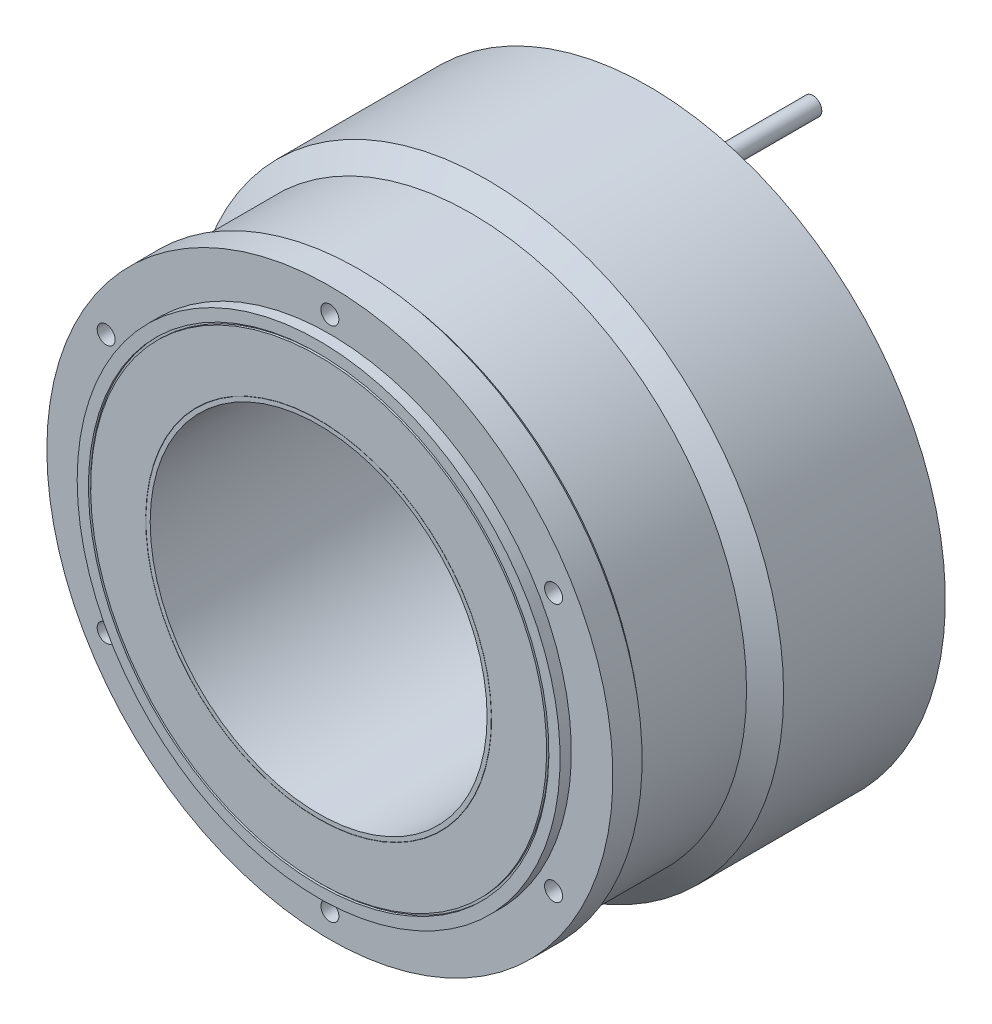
ISO-10303-21;
HEADER;
FILE_DESCRIPTION(('STEP AP214'),'2;1');
FILE_NAME('part.step','',(''),(''),'','','');
FILE_SCHEMA(('AUTOMOTIVE_DESIGN { 1 0 10303 214 1 1 1 1 }'));
ENDSEC;
DATA;
#1=APPLICATION_CONTEXT('core data for automotive mechanical design processes');
#2=APPLICATION_PROTOCOL_DEFINITION('international standard','automotive_design',2000,#1);
#3=PRODUCT_CONTEXT('',#1,'mechanical');
#4=PRODUCT('Part','Part','',(#3));
#5=PRODUCT_RELATED_PRODUCT_CATEGORY('part','',(#4));
#6=PRODUCT_DEFINITION_FORMATION('','',#4);
#7=PRODUCT_DEFINITION_CONTEXT('part definition',#1,'design');
#8=PRODUCT_DEFINITION('design','',#6,#7);
#9=PRODUCT_DEFINITION_SHAPE('','',#8);
#10=(LENGTH_UNIT() NAMED_UNIT(*) SI_UNIT(.MILLI.,.METRE.));
#11=(NAMED_UNIT(*) PLANE_ANGLE_UNIT() SI_UNIT($,.RADIAN.));
#12=(NAMED_UNIT(*) SI_UNIT($,.STERADIAN.) SOLID_ANGLE_UNIT());
#13=UNCERTAINTY_MEASURE_WITH_UNIT(LENGTH_MEASURE(1.E-05),#10,'distance_accuracy_value','');
#14=(GEOMETRIC_REPRESENTATION_CONTEXT(3) GLOBAL_UNCERTAINTY_ASSIGNED_CONTEXT((#13)) GLOBAL_UNIT_ASSIGNED_CONTEXT((#10,
#11,#12)) REPRESENTATION_CONTEXT('',''));
#15=CARTESIAN_POINT('',(0.,0.,0.));
#16=DIRECTION('',(0.,0.,1.));
#17=DIRECTION('',(1.,0.,0.));
#18=AXIS2_PLACEMENT_3D('',#15,#16,#17);
#19=CARTESIAN_POINT('',(-98.111250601,51.970329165,141.));
#20=DIRECTION('',(0.,0.,1.));
#21=DIRECTION('',(0.499999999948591,0.86602540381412,0.));
#22=AXIS2_PLACEMENT_3D('',#19,#20,#21);
#23=PLANE('',#22);
#24=CARTESIAN_POINT('',(-99.592921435,57.5,141.));
#25=DIRECTION('',(0.,0.,1.));
#26=DIRECTION('',(1.,0.,0.));
#27=AXIS2_PLACEMENT_3D('',#24,#25,#26);
#28=CIRCLE('',#27,4.);
#29=CARTESIAN_POINT('',(-95.592921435,57.5,141.));
#30=VERTEX_POINT('',#29);
#31=EDGE_CURVE('E20',#30,#30,#28,.F.);
#32=ORIENTED_EDGE('',*,*,#31,.F.);
#33=EDGE_LOOP('',(#32));
#34=FACE_BOUND('',#33,.T.);
#35=ADVANCED_FACE('F16',(#34),#23,.T.);
#36=CARTESIAN_POINT('',(-94.063250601,-58.981670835,141.));
#37=DIRECTION('',(0.,0.,1.));
#38=DIRECTION('',(-0.499999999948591,0.86602540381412,0.));
#39=AXIS2_PLACEMENT_3D('',#36,#37,#38);
#40=PLANE('',#39);
#41=CARTESIAN_POINT('',(-99.592921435,-57.5,141.));
#42=DIRECTION('',(0.,0.,1.));
#43=DIRECTION('',(1.,0.,0.));
#44=AXIS2_PLACEMENT_3D('',#41,#42,#43);
#45=CIRCLE('',#44,4.);
#46=CARTESIAN_POINT('',(-95.592921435,-57.5,141.));
#47=VERTEX_POINT('',#46);
#48=EDGE_CURVE('E492',#47,#47,#45,.F.);
#49=ORIENTED_EDGE('',*,*,#48,.F.);
#50=EDGE_LOOP('',(#49));
#51=FACE_BOUND('',#50,.T.);
#52=ADVANCED_FACE('F502',(#51),#40,.T.);
#53=CARTESIAN_POINT('',(4.048,-110.952,141.));
#54=DIRECTION('',(0.,0.,1.));
#55=DIRECTION('',(-1.,0.,0.));
#56=AXIS2_PLACEMENT_3D('',#53,#54,#55);
#57=PLANE('',#56);
#58=CARTESIAN_POINT('',(0.,-115.,141.));
#59=DIRECTION('',(0.,0.,1.));
#60=DIRECTION('',(1.,0.,0.));
#61=AXIS2_PLACEMENT_3D('',#58,#59,#60);
#62=CIRCLE('',#61,4.);
#63=CARTESIAN_POINT('',(4.,-115.,141.));
#64=VERTEX_POINT('',#63);
#65=EDGE_CURVE('E490',#64,#64,#62,.F.);
#66=ORIENTED_EDGE('',*,*,#65,.F.);
#67=EDGE_LOOP('',(#66));
#68=FACE_BOUND('',#67,.T.);
#69=ADVANCED_FACE('F508',(#68),#57,.T.);
#70=CARTESIAN_POINT('',(98.111250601,-51.970329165,141.));
#71=DIRECTION('',(0.,0.,1.));
#72=DIRECTION('',(-0.499999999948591,-0.86602540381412,0.));
#73=AXIS2_PLACEMENT_3D('',#70,#71,#72);
#74=PLANE('',#73);
#75=CARTESIAN_POINT('',(99.592921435,-57.5,141.));
#76=DIRECTION('',(0.,0.,1.));
#77=DIRECTION('',(1.,0.,0.));
#78=AXIS2_PLACEMENT_3D('',#75,#76,#77);
#79=CIRCLE('',#78,4.);
#80=CARTESIAN_POINT('',(103.592921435,-57.5,141.));
#81=VERTEX_POINT('',#80);
#82=EDGE_CURVE('E487',#81,#81,#79,.F.);
#83=ORIENTED_EDGE('',*,*,#82,.F.);
#84=EDGE_LOOP('',(#83));
#85=FACE_BOUND('',#84,.T.);
#86=ADVANCED_FACE('F2398',(#85),#74,.T.);
#87=CARTESIAN_POINT('',(94.063250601,58.981670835,141.));
#88=DIRECTION('',(0.,0.,1.));
#89=DIRECTION('',(0.499999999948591,-0.86602540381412,0.));
#90=AXIS2_PLACEMENT_3D('',#87,#88,#89);
#91=PLANE('',#90);
#92=CARTESIAN_POINT('',(99.592921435,57.5,141.));
#93=DIRECTION('',(0.,0.,1.));
#94=DIRECTION('',(1.,0.,0.));
#95=AXIS2_PLACEMENT_3D('',#92,#93,#94);
#96=CIRCLE('',#95,4.);
#97=CARTESIAN_POINT('',(103.592921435,57.5,141.));
#98=VERTEX_POINT('',#97);
#99=EDGE_CURVE('E484',#98,#98,#96,.F.);
#100=ORIENTED_EDGE('',*,*,#99,.F.);
#101=EDGE_LOOP('',(#100));
#102=FACE_BOUND('',#101,.T.);
#103=ADVANCED_FACE('F1381',(#102),#91,.T.);
#104=CARTESIAN_POINT('',(-4.048,110.952,141.));
#105=DIRECTION('',(0.,0.,1.));
#106=DIRECTION('',(1.,0.,0.));
#107=AXIS2_PLACEMENT_3D('',#104,#105,#106);
#108=PLANE('',#107);
#109=CARTESIAN_POINT('',(0.,115.,141.));
#110=DIRECTION('',(0.,0.,1.));
#111=DIRECTION('',(1.,0.,0.));
#112=AXIS2_PLACEMENT_3D('',#109,#110,#111);
#113=CIRCLE('',#112,4.);
#114=CARTESIAN_POINT('',(4.,115.,141.));
#115=VERTEX_POINT('',#114);
#116=EDGE_CURVE('E481',#115,#115,#113,.F.);
#117=ORIENTED_EDGE('',*,*,#116,.F.);
#118=EDGE_LOOP('',(#117));
#119=FACE_BOUND('',#118,.T.);
#120=ADVANCED_FACE('F1376',(#119),#108,.T.);
#121=CARTESIAN_POINT('',(-99.592921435,57.5,141.));
#122=DIRECTION('',(0.,0.,1.));
#123=DIRECTION('',(1.,0.,0.));
#124=AXIS2_PLACEMENT_3D('',#121,#122,#123);
#125=CYLINDRICAL_SURFACE('',#124,4.);
#126=CARTESIAN_POINT('',(-99.592921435,57.5,153.));
#127=DIRECTION('',(0.,0.,1.));
#128=DIRECTION('',(1.,0.,0.));
#129=AXIS2_PLACEMENT_3D('',#126,#127,#128);
#130=CIRCLE('',#129,4.);
#131=CARTESIAN_POINT('',(-95.592921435,57.5,153.));
#132=VERTEX_POINT('',#131);
#133=EDGE_CURVE('E475',#132,#132,#130,.F.);
#134=ORIENTED_EDGE('',*,*,#133,.F.);
#135=EDGE_LOOP('',(#134));
#136=FACE_BOUND('',#135,.T.);
#137=ORIENTED_EDGE('',*,*,#31,.T.);
#138=EDGE_LOOP('',(#137));
#139=FACE_BOUND('',#138,.T.);
#140=ADVANCED_FACE('F499',(#136,#139),#125,.F.);
#141=CARTESIAN_POINT('',(-99.592921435,-57.5,141.));
#142=DIRECTION('',(0.,0.,1.));
#143=DIRECTION('',(1.,0.,0.));
#144=AXIS2_PLACEMENT_3D('',#141,#142,#143);
#145=CYLINDRICAL_SURFACE('',#144,4.);
#146=CARTESIAN_POINT('',(-99.592921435,-57.5,153.));
#147=DIRECTION('',(0.,0.,1.));
#148=DIRECTION('',(1.,0.,0.));
#149=AXIS2_PLACEMENT_3D('',#146,#147,#148);
#150=CIRCLE('',#149,4.);
#151=CARTESIAN_POINT('',(-95.592921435,-57.5,153.));
#152=VERTEX_POINT('',#151);
#153=EDGE_CURVE('E472',#152,#152,#150,.F.);
#154=ORIENTED_EDGE('',*,*,#153,.F.);
#155=EDGE_LOOP('',(#154));
#156=FACE_BOUND('',#155,.T.);
#157=ORIENTED_EDGE('',*,*,#48,.T.);
#158=EDGE_LOOP('',(#157));
#159=FACE_BOUND('',#158,.T.);
#160=ADVANCED_FACE('F1371',(#156,#159),#145,.F.);
#161=CARTESIAN_POINT('',(0.,-115.,141.));
#162=DIRECTION('',(0.,0.,1.));
#163=DIRECTION('',(1.,0.,0.));
#164=AXIS2_PLACEMENT_3D('',#161,#162,#163);
#165=CYLINDRICAL_SURFACE('',#164,4.);
#166=CARTESIAN_POINT('',(0.,-115.,153.));
#167=DIRECTION('',(0.,0.,1.));
#168=DIRECTION('',(1.,0.,0.));
#169=AXIS2_PLACEMENT_3D('',#166,#167,#168);
#170=CIRCLE('',#169,4.);
#171=CARTESIAN_POINT('',(4.,-115.,153.));
#172=VERTEX_POINT('',#171);
#173=EDGE_CURVE('E469',#172,#172,#170,.F.);
#174=ORIENTED_EDGE('',*,*,#173,.F.);
#175=EDGE_LOOP('',(#174));
#176=FACE_BOUND('',#175,.T.);
#177=ORIENTED_EDGE('',*,*,#65,.T.);
#178=EDGE_LOOP('',(#177));
#179=FACE_BOUND('',#178,.T.);
#180=ADVANCED_FACE('F1367',(#176,#179),#165,.F.);
#181=CARTESIAN_POINT('',(99.592921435,-57.5,141.));
#182=DIRECTION('',(0.,0.,1.));
#183=DIRECTION('',(1.,0.,0.));
#184=AXIS2_PLACEMENT_3D('',#181,#182,#183);
#185=CYLINDRICAL_SURFACE('',#184,4.);
#186=CARTESIAN_POINT('',(99.592921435,-57.5,153.));
#187=DIRECTION('',(0.,0.,1.));
#188=DIRECTION('',(1.,0.,0.));
#189=AXIS2_PLACEMENT_3D('',#186,#187,#188);
#190=CIRCLE('',#189,4.);
#191=CARTESIAN_POINT('',(103.592921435,-57.5,153.));
#192=VERTEX_POINT('',#191);
#193=EDGE_CURVE('E466',#192,#192,#190,.F.);
#194=ORIENTED_EDGE('',*,*,#193,.F.);
#195=EDGE_LOOP('',(#194));
#196=FACE_BOUND('',#195,.T.);
#197=ORIENTED_EDGE('',*,*,#82,.T.);
#198=EDGE_LOOP('',(#197));
#199=FACE_BOUND('',#198,.T.);
#200=ADVANCED_FACE('F1363',(#196,#199),#185,.F.);
#201=CARTESIAN_POINT('',(99.592921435,57.5,141.));
#202=DIRECTION('',(0.,0.,1.));
#203=DIRECTION('',(1.,0.,0.));
#204=AXIS2_PLACEMENT_3D('',#201,#202,#203);
#205=CYLINDRICAL_SURFACE('',#204,4.);
#206=CARTESIAN_POINT('',(99.592921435,57.5,153.));
#207=DIRECTION('',(0.,0.,1.));
#208=DIRECTION('',(1.,0.,0.));
#209=AXIS2_PLACEMENT_3D('',#206,#207,#208);
#210=CIRCLE('',#209,4.);
#211=CARTESIAN_POINT('',(103.592921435,57.5,153.));
#212=VERTEX_POINT('',#211);
#213=EDGE_CURVE('E463',#212,#212,#210,.F.);
#214=ORIENTED_EDGE('',*,*,#213,.F.);
#215=EDGE_LOOP('',(#214));
#216=FACE_BOUND('',#215,.T.);
#217=ORIENTED_EDGE('',*,*,#99,.T.);
#218=EDGE_LOOP('',(#217));
#219=FACE_BOUND('',#218,.T.);
#220=ADVANCED_FACE('F1359',(#216,#219),#205,.F.);
#221=CARTESIAN_POINT('',(0.,115.,141.));
#222=DIRECTION('',(0.,0.,1.));
#223=DIRECTION('',(1.,0.,0.));
#224=AXIS2_PLACEMENT_3D('',#221,#222,#223);
#225=CYLINDRICAL_SURFACE('',#224,4.);
#226=CARTESIAN_POINT('',(0.,115.,153.));
#227=DIRECTION('',(0.,0.,1.));
#228=DIRECTION('',(1.,0.,0.));
#229=AXIS2_PLACEMENT_3D('',#226,#227,#228);
#230=CIRCLE('',#229,4.);
#231=CARTESIAN_POINT('',(4.,115.,153.));
#232=VERTEX_POINT('',#231);
#233=EDGE_CURVE('E460',#232,#232,#230,.F.);
#234=ORIENTED_EDGE('',*,*,#233,.F.);
#235=EDGE_LOOP('',(#234));
#236=FACE_BOUND('',#235,.T.);
#237=ORIENTED_EDGE('',*,*,#116,.T.);
#238=EDGE_LOOP('',(#237));
#239=FACE_BOUND('',#238,.T.);
#240=ADVANCED_FACE('F1355',(#236,#239),#225,.F.);
#241=CARTESIAN_POINT('',(0.,0.,158.));
#242=DIRECTION('',(0.,0.,-1.));
#243=DIRECTION('',(-1.,0.,0.));
#244=AXIS2_PLACEMENT_3D('',#241,#242,#243);
#245=CYLINDRICAL_SURFACE('',#244,107.5);
#246=CARTESIAN_POINT('',(0.,0.,158.));
#247=DIRECTION('',(0.,0.,-1.));
#248=DIRECTION('',(-1.,0.,0.));
#249=AXIS2_PLACEMENT_3D('',#246,#247,#248);
#250=CIRCLE('',#249,107.5);
#251=CARTESIAN_POINT('',(-107.5,0.,158.));
#252=VERTEX_POINT('',#251);
#253=EDGE_CURVE('E478',#252,#252,#250,.F.);
#254=ORIENTED_EDGE('',*,*,#253,.F.);
#255=EDGE_LOOP('',(#254));
#256=FACE_BOUND('',#255,.T.);
#257=CARTESIAN_POINT('',(0.,0.,153.));
#258=DIRECTION('',(0.,0.,-1.));
#259=DIRECTION('',(-1.,0.,0.));
#260=AXIS2_PLACEMENT_3D('',#257,#258,#259);
#261=CIRCLE('',#260,107.5);
#262=CARTESIAN_POINT('',(-107.5,0.,153.));
#263=VERTEX_POINT('',#262);
#264=EDGE_CURVE('E457',#263,#263,#261,.T.);
#265=ORIENTED_EDGE('',*,*,#264,.F.);
#266=EDGE_LOOP('',(#265));
#267=FACE_BOUND('',#266,.T.);
#268=ADVANCED_FACE('F1351',(#256,#267),#245,.T.);
#269=CARTESIAN_POINT('',(-108.79,108.79,158.));
#270=DIRECTION('',(0.,0.,1.));
#271=DIRECTION('',(0.,-1.,0.));
#272=AXIS2_PLACEMENT_3D('',#269,#270,#271);
#273=PLANE('',#272);
#274=CARTESIAN_POINT('',(0.,0.,158.));
#275=DIRECTION('',(0.,0.,1.));
#276=DIRECTION('',(0.,-1.,0.));
#277=AXIS2_PLACEMENT_3D('',#274,#275,#276);
#278=CIRCLE('',#277,102.5);
#279=CARTESIAN_POINT('',(0.,-102.5,158.));
#280=VERTEX_POINT('',#279);
#281=EDGE_CURVE('E454',#280,#280,#278,.T.);
#282=ORIENTED_EDGE('',*,*,#281,.F.);
#283=EDGE_LOOP('',(#282));
#284=FACE_BOUND('',#283,.T.);
#285=ORIENTED_EDGE('',*,*,#253,.T.);
#286=EDGE_LOOP('',(#285));
#287=FACE_BOUND('',#286,.T.);
#288=ADVANCED_FACE('F1354',(#284,#287),#273,.T.);
#289=CARTESIAN_POINT('',(-127.512,127.512,153.));
#290=DIRECTION('',(0.,0.,1.));
#291=DIRECTION('',(0.,-1.,0.));
#292=AXIS2_PLACEMENT_3D('',#289,#290,#291);
#293=PLANE('',#292);
#294=ORIENTED_EDGE('',*,*,#264,.T.);
#295=EDGE_LOOP('',(#294));
#296=FACE_BOUND('',#295,.T.);
#297=ORIENTED_EDGE('',*,*,#233,.T.);
#298=EDGE_LOOP('',(#297));
#299=FACE_BOUND('',#298,.T.);
#300=ORIENTED_EDGE('',*,*,#213,.T.);
#301=EDGE_LOOP('',(#300));
#302=FACE_BOUND('',#301,.T.);
#303=ORIENTED_EDGE('',*,*,#193,.T.);
#304=EDGE_LOOP('',(#303));
#305=FACE_BOUND('',#304,.T.);
#306=ORIENTED_EDGE('',*,*,#173,.T.);
#307=EDGE_LOOP('',(#306));
#308=FACE_BOUND('',#307,.T.);
#309=ORIENTED_EDGE('',*,*,#153,.T.);
#310=EDGE_LOOP('',(#309));
#311=FACE_BOUND('',#310,.T.);
#312=ORIENTED_EDGE('',*,*,#133,.T.);
#313=EDGE_LOOP('',(#312));
#314=FACE_BOUND('',#313,.T.);
#315=CARTESIAN_POINT('',(0.,0.,153.));
#316=DIRECTION('',(0.,0.,-1.));
#317=DIRECTION('',(-1.,0.,0.));
#318=AXIS2_PLACEMENT_3D('',#315,#316,#317);
#319=CIRCLE('',#318,126.);
#320=CARTESIAN_POINT('',(-126.,0.,153.));
#321=VERTEX_POINT('',#320);
#322=EDGE_CURVE('E451',#321,#321,#319,.F.);
#323=ORIENTED_EDGE('',*,*,#322,.T.);
#324=EDGE_LOOP('',(#323));
#325=FACE_BOUND('',#324,.T.);
#326=ADVANCED_FACE('F1349',(#296,#299,#302,#305,#308,#311,#314,#325),#293,.T.);
#327=CARTESIAN_POINT('',(0.,0.,157.));
#328=DIRECTION('',(0.,0.,1.));
#329=DIRECTION('',(0.,-1.,0.));
#330=AXIS2_PLACEMENT_3D('',#327,#328,#329);
#331=CYLINDRICAL_SURFACE('',#330,102.5);
#332=ORIENTED_EDGE('',*,*,#281,.T.);
#333=EDGE_LOOP('',(#332));
#334=FACE_BOUND('',#333,.T.);
#335=CARTESIAN_POINT('',(0.,0.,157.));
#336=DIRECTION('',(0.,0.,1.));
#337=DIRECTION('',(0.,-1.,0.));
#338=AXIS2_PLACEMENT_3D('',#335,#336,#337);
#339=CIRCLE('',#338,102.5);
#340=CARTESIAN_POINT('',(0.,-102.5,157.));
#341=VERTEX_POINT('',#340);
#342=EDGE_CURVE('E448',#341,#341,#339,.T.);
#343=ORIENTED_EDGE('',*,*,#342,.F.);
#344=EDGE_LOOP('',(#343));
#345=FACE_BOUND('',#344,.T.);
#346=ADVANCED_FACE('F1345',(#334,#345),#331,.F.);
#347=CARTESIAN_POINT('',(0.,0.,153.));
#348=DIRECTION('',(0.,0.,-1.));
#349=DIRECTION('',(-1.,0.,0.));
#350=AXIS2_PLACEMENT_3D('',#347,#348,#349);
#351=CYLINDRICAL_SURFACE('',#350,126.);
#352=ORIENTED_EDGE('',*,*,#322,.F.);
#353=EDGE_LOOP('',(#352));
#354=FACE_BOUND('',#353,.T.);
#355=CARTESIAN_POINT('',(0.,0.,140.));
#356=DIRECTION('',(0.,0.,1.));
#357=DIRECTION('',(0.,-1.,0.));
#358=AXIS2_PLACEMENT_3D('',#355,#356,#357);
#359=CIRCLE('',#358,126.);
#360=CARTESIAN_POINT('',(0.,-126.,140.));
#361=VERTEX_POINT('',#360);
#362=EDGE_CURVE('E447',#361,#361,#359,.T.);
#363=ORIENTED_EDGE('',*,*,#362,.T.);
#364=EDGE_LOOP('',(#363));
#365=FACE_BOUND('',#364,.T.);
#366=ADVANCED_FACE('F1342',(#354,#365),#351,.T.);
#367=CARTESIAN_POINT('',(-103.73,-103.73,157.));
#368=DIRECTION('',(0.,0.,1.));
#369=DIRECTION('',(1.,0.,0.));
#370=AXIS2_PLACEMENT_3D('',#367,#368,#369);
#371=PLANE('',#370);
#372=CARTESIAN_POINT('',(0.,0.,157.));
#373=DIRECTION('',(0.,0.,1.));
#374=DIRECTION('',(0.,-1.,0.));
#375=AXIS2_PLACEMENT_3D('',#372,#373,#374);
#376=CIRCLE('',#375,101.5);
#377=CARTESIAN_POINT('',(0.,-101.5,157.));
#378=VERTEX_POINT('',#377);
#379=EDGE_CURVE('E444',#378,#378,#376,.F.);
#380=ORIENTED_EDGE('',*,*,#379,.T.);
#381=EDGE_LOOP('',(#380));
#382=FACE_BOUND('',#381,.T.);
#383=ORIENTED_EDGE('',*,*,#342,.T.);
#384=EDGE_LOOP('',(#383));
#385=FACE_BOUND('',#384,.T.);
#386=ADVANCED_FACE('F1337',(#382,#385),#371,.T.);
#387=CARTESIAN_POINT('',(0.,0.,137.));
#388=DIRECTION('',(0.,0.,1.));
#389=DIRECTION('',(1.,0.,0.));
#390=AXIS2_PLACEMENT_3D('',#387,#388,#389);
#391=CONICAL_SURFACE('',#390,122.5,0.862170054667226);
#392=CARTESIAN_POINT('',(0.,0.,137.));
#393=DIRECTION('',(0.,0.,-1.));
#394=DIRECTION('',(0.,1.,0.));
#395=AXIS2_PLACEMENT_3D('',#392,#393,#394);
#396=CIRCLE('',#395,122.5);
#397=CARTESIAN_POINT('',(0.,122.5,137.));
#398=VERTEX_POINT('',#397);
#399=EDGE_CURVE('E443',#398,#398,#396,.F.);
#400=ORIENTED_EDGE('',*,*,#399,.T.);
#401=EDGE_LOOP('',(#400));
#402=FACE_BOUND('',#401,.T.);
#403=ORIENTED_EDGE('',*,*,#362,.F.);
#404=EDGE_LOOP('',(#403));
#405=FACE_BOUND('',#404,.T.);
#406=ADVANCED_FACE('F1331',(#402,#405),#391,.T.);
#407=CARTESIAN_POINT('',(0.,0.,157.));
#408=DIRECTION('',(0.,0.,1.));
#409=DIRECTION('',(0.,-1.,0.));
#410=AXIS2_PLACEMENT_3D('',#407,#408,#409);
#411=CYLINDRICAL_SURFACE('',#410,101.5);
#412=ORIENTED_EDGE('',*,*,#379,.F.);
#413=EDGE_LOOP('',(#412));
#414=FACE_BOUND('',#413,.T.);
#415=CARTESIAN_POINT('',(0.,0.,158.));
#416=DIRECTION('',(0.,0.,1.));
#417=DIRECTION('',(0.,-1.,0.));
#418=AXIS2_PLACEMENT_3D('',#415,#416,#417);
#419=CIRCLE('',#418,101.5);
#420=CARTESIAN_POINT('',(0.,-101.5,158.));
#421=VERTEX_POINT('',#420);
#422=EDGE_CURVE('E420',#421,#421,#419,.T.);
#423=ORIENTED_EDGE('',*,*,#422,.F.);
#424=EDGE_LOOP('',(#423));
#425=FACE_BOUND('',#424,.T.);
#426=ADVANCED_FACE('F1329',(#414,#425),#411,.T.);
#427=CARTESIAN_POINT('',(0.,0.,43.));
#428=DIRECTION('',(0.,0.,-1.));
#429=DIRECTION('',(-1.,0.,0.));
#430=AXIS2_PLACEMENT_3D('',#427,#428,#429);
#431=CYLINDRICAL_SURFACE('',#430,132.1);
#432=DIRECTION('',(0.,0.,1.));
#433=VECTOR('',#432,1.);
#434=CARTESIAN_POINT('',(-127.09227207,36.027272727,33.));
#435=LINE('',#434,#433);
#436=CARTESIAN_POINT('',(-127.092272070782,36.0272727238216,23.));
#437=VERTEX_POINT('',#436);
#438=CARTESIAN_POINT('',(-127.09227206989,36.0272727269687,43.));
#439=VERTEX_POINT('',#438);
#440=EDGE_CURVE('E434',#437,#439,#435,.T.);
#441=ORIENTED_EDGE('',*,*,#440,.F.);
#442=CARTESIAN_POINT('',(0.,0.,23.));
#443=DIRECTION('',(0.,0.,-1.));
#444=DIRECTION('',(-1.,0.,0.));
#445=AXIS2_PLACEMENT_3D('',#442,#443,#444);
#446=CIRCLE('',#445,132.1);
#447=CARTESIAN_POINT('',(-132.076305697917,2.50189393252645,23.));
#448=VERTEX_POINT('',#447);
#449=EDGE_CURVE('E416',#448,#437,#446,.T.);
#450=ORIENTED_EDGE('',*,*,#449,.F.);
#451=DIRECTION('',(0.,0.,1.));
#452=VECTOR('',#451,1.);
#453=CARTESIAN_POINT('',(-132.076305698,2.50189394,33.));
#454=LINE('',#453,#452);
#455=CARTESIAN_POINT('',(-132.076305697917,2.50189393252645,43.));
#456=VERTEX_POINT('',#455);
#457=EDGE_CURVE('E409',#448,#456,#454,.T.);
#458=ORIENTED_EDGE('',*,*,#457,.T.);
#459=CARTESIAN_POINT('',(0.,0.,43.));
#460=DIRECTION('',(0.,0.,-1.));
#461=DIRECTION('',(-1.,0.,0.));
#462=AXIS2_PLACEMENT_3D('',#459,#460,#461);
#463=CIRCLE('',#462,132.1);
#464=EDGE_CURVE('E413',#439,#456,#463,.F.);
#465=ORIENTED_EDGE('',*,*,#464,.F.);
#466=EDGE_LOOP('',(#441,#450,#458,#465));
#467=FACE_BOUND('',#466,.T.);
#468=ADVANCED_FACE('F411',(#467),#431,.T.);
#469=CARTESIAN_POINT('',(0.,0.,40.303698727));
#470=DIRECTION('',(0.,0.,-1.));
#471=DIRECTION('',(-1.,0.,0.));
#472=AXIS2_PLACEMENT_3D('',#469,#470,#471);
#473=CYLINDRICAL_SURFACE('',#472,132.1);
#474=CARTESIAN_POINT('',(-129.451425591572,-26.3199242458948,23.));
#475=CARTESIAN_POINT('',(-129.444691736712,-26.3530441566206,23.0000018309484));
#476=CARTESIAN_POINT('',(-129.437949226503,-26.3861409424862,23.0013710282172));
#477=CARTESIAN_POINT('',(-129.424470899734,-26.4521732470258,23.0068407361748));
#478=CARTESIAN_POINT('',(-129.417735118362,-26.4851083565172,23.0109462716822));
#479=CARTESIAN_POINT('',(-129.397455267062,-26.5840764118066,23.0274819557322));
#480=CARTESIAN_POINT('',(-129.383997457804,-26.6494913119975,23.0441316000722));
#481=CARTESIAN_POINT('',(-129.364307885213,-26.744848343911,23.0771318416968));
#482=CARTESIAN_POINT('',(-129.357823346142,-26.7761933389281,23.0894805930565));
#483=CARTESIAN_POINT('',(-129.345055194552,-26.8378032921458,23.1167926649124));
#484=CARTESIAN_POINT('',(-129.338771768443,-26.8680672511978,23.1317583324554));
#485=CARTESIAN_POINT('',(-129.320057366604,-26.9580517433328,23.1811135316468));
#486=CARTESIAN_POINT('',(-129.308021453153,-27.0157105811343,23.2195299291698));
#487=CARTESIAN_POINT('',(-129.285408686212,-27.1237194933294,23.3058270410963));
#488=CARTESIAN_POINT('',(-129.274831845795,-27.1740695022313,23.3537078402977));
#489=CARTESIAN_POINT('',(-129.255641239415,-27.2652038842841,23.456803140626));
#490=CARTESIAN_POINT('',(-129.246997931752,-27.3061325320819,23.5118834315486));
#491=CARTESIAN_POINT('',(-129.235590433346,-27.3600530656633,23.5992111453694));
#492=CARTESIAN_POINT('',(-129.232047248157,-27.3767824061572,23.6291079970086));
#493=CARTESIAN_POINT('',(-129.225499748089,-27.4076715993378,23.6903025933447));
#494=CARTESIAN_POINT('',(-129.222496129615,-27.4218281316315,23.7216020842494));
#495=CARTESIAN_POINT('',(-129.214480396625,-27.4595834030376,23.8157364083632));
#496=CARTESIAN_POINT('',(-129.210275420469,-27.4793549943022,23.8802484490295));
#497=CARTESIAN_POINT('',(-129.205723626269,-27.5007459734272,23.9787786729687));
#498=CARTESIAN_POINT('',(-129.204498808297,-27.5064993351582,24.0119320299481));
#499=CARTESIAN_POINT('',(-129.202650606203,-27.5151794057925,24.0786202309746));
#500=CARTESIAN_POINT('',(-129.202026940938,-27.5181074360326,24.1121548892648));
#501=CARTESIAN_POINT('',(-129.201386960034,-27.5211120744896,24.1788149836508));
#502=CARTESIAN_POINT('',(-129.201361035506,-27.5212337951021,24.2119383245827));
#503=CARTESIAN_POINT('',(-129.201891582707,-27.5187429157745,24.278038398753));
#504=CARTESIAN_POINT('',(-129.202447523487,-27.5161328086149,24.3110152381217));
#505=CARTESIAN_POINT('',(-129.204985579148,-27.5042138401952,24.409452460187));
#506=CARTESIAN_POINT('',(-129.207837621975,-27.4908177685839,24.4744519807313));
#507=CARTESIAN_POINT('',(-129.215000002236,-27.457130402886,24.589199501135));
#508=CARTESIAN_POINT('',(-129.218933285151,-27.4386187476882,24.6395098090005));
#509=CARTESIAN_POINT('',(-129.228154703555,-27.3951546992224,24.7370719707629));
#510=CARTESIAN_POINT('',(-129.23344142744,-27.3702090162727,24.7843269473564));
#511=CARTESIAN_POINT('',(-129.239361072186,-27.3422301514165,24.8296604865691));
#512=B_SPLINE_CURVE_WITH_KNOTS('',3,(#474,#475,#476,#477,#478,#479,#480,#481,#482,#483,#484,
#485,#486,#487,#488,#489,#490,#491,#492,#493,#494,#495,#496,#497,#498,#499,#500,#501,#502,#503,
#504,#505,#506,#507,#508,#509,#510,#511),.UNSPECIFIED.,.F.,.F.,(4,2,2,2,2,2,2,2,2,2,2,2,2,2,2,2,
2,2,4),(0.,0.101323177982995,0.202832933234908,0.408215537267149,0.511045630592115,
0.613968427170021,0.823817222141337,1.03366789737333,1.2400520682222,1.3432637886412,
1.44660777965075,1.6482526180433,1.74917147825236,1.85004311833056,1.9492920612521,
2.04845051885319,2.24667125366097,2.40746273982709,2.56808720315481),.UNSPECIFIED.);
#513=CARTESIAN_POINT('',(-129.451425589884,-26.319924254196,23.));
#514=VERTEX_POINT('',#513);
#515=CARTESIAN_POINT('',(-129.239361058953,-27.3422302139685,24.8296603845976));
#516=VERTEX_POINT('',#515);
#517=EDGE_CURVE('E849',#514,#516,#512,.T.);
#518=ORIENTED_EDGE('',*,*,#517,.T.);
#519=CARTESIAN_POINT('',(-130.674209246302,-19.3561627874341,37.7760698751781));
#520=CARTESIAN_POINT('',(-130.669039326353,-19.3910651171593,37.7194888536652));
#521=CARTESIAN_POINT('',(-130.663855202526,-19.4259668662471,37.6629087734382));
#522=CARTESIAN_POINT('',(-130.637863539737,-19.600472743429,37.3800130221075));
#523=CARTESIAN_POINT('',(-130.616842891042,-19.7400681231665,37.1537115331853));
#524=CARTESIAN_POINT('',(-130.510601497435,-20.438000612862,36.0222760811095));
#525=CARTESIAN_POINT('',(-130.421967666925,-20.9961952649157,35.1173730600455));
#526=CARTESIAN_POINT('',(-130.169971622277,-22.5199164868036,32.6472312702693));
#527=CARTESIAN_POINT('',(-129.999320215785,-23.4851130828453,31.0825274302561));
#528=CARTESIAN_POINT('',(-129.635939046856,-25.4144998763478,27.9547512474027));
#529=CARTESIAN_POINT('',(-129.443206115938,-26.3786899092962,26.3916791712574));
#530=CARTESIAN_POINT('',(-129.239361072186,-27.3422301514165,24.8296604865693));
#531=B_SPLINE_CURVE_WITH_KNOTS('',3,(#519,#520,#521,#522,#523,#524,#525,#526,#527,#528,#529,
#530),.UNSPECIFIED.,.F.,.F.,(4,2,2,2,2,4),(0.,0.200042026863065,1.00021040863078,
4.20090157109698,9.73982612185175,15.2795464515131),.UNSPECIFIED.);
#532=CARTESIAN_POINT('',(-130.674209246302,-19.356162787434,37.7760698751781));
#533=VERTEX_POINT('',#532);
#534=EDGE_CURVE('E843',#533,#516,#531,.T.);
#535=ORIENTED_EDGE('',*,*,#534,.F.);
#536=CARTESIAN_POINT('',(-130.674209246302,-19.356162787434,37.7760698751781));
#537=CARTESIAN_POINT('',(-130.679429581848,-19.3209196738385,37.8332156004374));
#538=CARTESIAN_POINT('',(-130.684801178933,-19.2845577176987,37.8896698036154));
#539=CARTESIAN_POINT('',(-130.70138833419,-19.1719293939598,38.0571994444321));
#540=CARTESIAN_POINT('',(-130.713041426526,-19.0923539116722,38.1660279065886));
#541=CARTESIAN_POINT('',(-130.737408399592,-18.9247775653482,38.3769456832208));
#542=CARTESIAN_POINT('',(-130.750122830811,-18.8367723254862,38.4790314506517));
#543=CARTESIAN_POINT('',(-130.776458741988,-18.6530547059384,38.6758504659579));
#544=CARTESIAN_POINT('',(-130.790080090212,-18.5573434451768,38.7705847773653));
#545=CARTESIAN_POINT('',(-130.818082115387,-18.3589059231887,38.9521989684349));
#546=CARTESIAN_POINT('',(-130.832462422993,-18.2561830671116,39.0390826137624));
#547=CARTESIAN_POINT('',(-130.85449205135,-18.0973687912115,39.162901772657));
#548=CARTESIAN_POINT('',(-130.861901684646,-18.0437164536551,39.2030416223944));
#549=CARTESIAN_POINT('',(-130.876862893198,-17.9348760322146,39.2811555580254));
#550=CARTESIAN_POINT('',(-130.884414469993,-17.8796879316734,39.3191296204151));
#551=CARTESIAN_POINT('',(-130.907297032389,-17.7116451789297,39.4299240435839));
#552=CARTESIAN_POINT('',(-130.922817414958,-17.5965887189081,39.4994010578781));
#553=CARTESIAN_POINT('',(-130.954209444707,-17.361426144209,39.6292184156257));
#554=CARTESIAN_POINT('',(-130.970081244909,-17.2413178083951,39.6895546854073));
#555=CARTESIAN_POINT('',(-131.002052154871,-16.9966920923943,39.8004941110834));
#556=CARTESIAN_POINT('',(-131.018151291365,-16.8721741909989,39.8510961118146));
#557=CARTESIAN_POINT('',(-131.050432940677,-16.6195734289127,39.9422036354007));
#558=CARTESIAN_POINT('',(-131.066615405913,-16.4914924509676,39.9827143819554));
#559=CARTESIAN_POINT('',(-131.090826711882,-16.2975271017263,40.0358729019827));
#560=CARTESIAN_POINT('',(-131.098875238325,-16.2326591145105,40.0523063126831));
#561=CARTESIAN_POINT('',(-131.114949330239,-16.1023096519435,40.0826481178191));
#562=CARTESIAN_POINT('',(-131.12297488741,-16.0368279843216,40.0965556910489));
#563=CARTESIAN_POINT('',(-131.147225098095,-15.8377201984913,40.1347477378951));
#564=CARTESIAN_POINT('',(-131.163391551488,-15.7032863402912,40.1549900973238));
#565=CARTESIAN_POINT('',(-131.195452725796,-15.4331365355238,40.184558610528));
#566=CARTESIAN_POINT('',(-131.211347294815,-15.2974199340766,40.1938788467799));
#567=CARTESIAN_POINT('',(-131.242779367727,-15.0253668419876,40.2018017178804));
#568=CARTESIAN_POINT('',(-131.258316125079,-14.8890296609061,40.2003836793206));
#569=CARTESIAN_POINT('',(-131.288904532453,-14.6168498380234,40.1866645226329));
#570=CARTESIAN_POINT('',(-131.303956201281,-14.4810071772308,40.1743638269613));
#571=CARTESIAN_POINT('',(-131.333481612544,-14.2107383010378,40.1388374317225));
#572=CARTESIAN_POINT('',(-131.347955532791,-14.0763116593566,40.115615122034));
#573=CARTESIAN_POINT('',(-131.376259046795,-13.8096538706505,40.0585104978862));
#574=CARTESIAN_POINT('',(-131.390088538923,-13.6774230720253,40.0246265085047));
#575=CARTESIAN_POINT('',(-131.417020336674,-13.4161836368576,39.9465013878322));
#576=CARTESIAN_POINT('',(-131.430123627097,-13.2871707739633,39.9022747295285));
#577=CARTESIAN_POINT('',(-131.455559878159,-13.0331143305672,39.8035052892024));
#578=CARTESIAN_POINT('',(-131.467893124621,-12.9080692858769,39.7489663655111));
#579=CARTESIAN_POINT('',(-131.486033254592,-12.7215244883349,39.6585338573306));
#580=CARTESIAN_POINT('',(-131.492135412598,-12.6582887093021,39.6262296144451));
#581=CARTESIAN_POINT('',(-131.504117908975,-12.5331927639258,39.5590425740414));
#582=CARTESIAN_POINT('',(-131.509998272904,-12.471332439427,39.5241600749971));
#583=CARTESIAN_POINT('',(-131.527289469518,-12.2880898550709,39.4157546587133));
#584=CARTESIAN_POINT('',(-131.538364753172,-12.1688981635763,39.3384021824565));
#585=CARTESIAN_POINT('',(-131.55425464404,-11.995476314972,39.2151917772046));
#586=CARTESIAN_POINT('',(-131.55942404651,-11.9386390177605,39.1729886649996));
#587=CARTESIAN_POINT('',(-131.569529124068,-11.8267560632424,39.0862212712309));
#588=CARTESIAN_POINT('',(-131.574464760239,-11.7717107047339,39.0416565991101));
#589=CARTESIAN_POINT('',(-131.588325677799,-11.6160638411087,38.910179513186));
#590=CARTESIAN_POINT('',(-131.59695438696,-11.517839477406,38.8203991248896));
#591=CARTESIAN_POINT('',(-131.613383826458,-11.3285575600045,38.6335007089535));
#592=CARTESIAN_POINT('',(-131.62118455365,-11.2375000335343,38.536382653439));
#593=CARTESIAN_POINT('',(-131.63233308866,-11.1058942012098,38.3843978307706));
#594=CARTESIAN_POINT('',(-131.635994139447,-11.0624075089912,38.3320751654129));
#595=CARTESIAN_POINT('',(-131.643094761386,-10.9775867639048,38.2257183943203));
#596=CARTESIAN_POINT('',(-131.646534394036,-10.9362521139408,38.1716847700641));
#597=CARTESIAN_POINT('',(-131.653215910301,-10.8555236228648,38.0616280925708));
#598=CARTESIAN_POINT('',(-131.656456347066,-10.8161443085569,38.0055943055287));
#599=CARTESIAN_POINT('',(-131.662718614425,-10.7396460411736,37.8919692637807));
#600=CARTESIAN_POINT('',(-131.665740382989,-10.7025277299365,37.8343775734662));
#601=CARTESIAN_POINT('',(-131.668653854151,-10.6665642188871,37.7760694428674));
#602=B_SPLINE_CURVE_WITH_KNOTS('',3,(#536,#537,#538,#539,#540,#541,#542,#543,#544,#545,#546,
#547,#548,#549,#550,#551,#552,#553,#554,#555,#556,#557,#558,#559,#560,#561,#562,#563,#564,#565,
#566,#567,#568,#569,#570,#571,#572,#573,#574,#575,#576,#577,#578,#579,#580,#581,#582,#583,#584,
#585,#586,#587,#588,#589,#590,#591,#592,#593,#594,#595,#596,#597,#598,#599,#600,#601),
.UNSPECIFIED.,.F.,.F.,(4,2,2,2,2,2,2,2,2,2,2,2,2,2,2,2,2,2,2,2,2,2,2,2,2,2,2,2,2,2,2,2,4),(0.,
0.202039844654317,0.607544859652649,1.01326152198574,1.41891937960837,1.82438161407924,
2.0265784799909,2.22877753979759,2.63423112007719,3.03986486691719,3.44554672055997,
3.85101813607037,4.0531742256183,4.25539592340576,4.66563762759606,5.07610149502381,
5.48735579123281,5.89859412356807,6.30970489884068,6.7208802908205,7.13148371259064,
7.54193381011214,7.75569291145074,7.96942730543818,8.39640286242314,8.60929640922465,
8.82222527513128,9.22186310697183,9.62150245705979,9.82585455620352,10.030149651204,
10.2357862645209,10.4414809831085),.UNSPECIFIED.);
#603=CARTESIAN_POINT('',(-131.668653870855,-10.6665640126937,37.7760691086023));
#604=VERTEX_POINT('',#603);
#605=EDGE_CURVE('E874',#533,#604,#602,.T.);
#606=ORIENTED_EDGE('',*,*,#605,.T.);
#607=CARTESIAN_POINT('',(-132.072801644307,-2.68049730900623,24.829660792));
#608=CARTESIAN_POINT('',(-132.072091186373,-2.71550280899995,24.8864090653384));
#609=CARTESIAN_POINT('',(-132.071366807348,-2.75050823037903,24.9431572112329));
#610=CARTESIAN_POINT('',(-132.067675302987,-2.92553497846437,25.226897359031));
#611=CARTESIAN_POINT('',(-132.06449935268,-3.06555509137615,25.4538873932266));
#612=CARTESIAN_POINT('',(-132.047505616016,-3.76565137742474,26.5888306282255));
#613=CARTESIAN_POINT('',(-132.030346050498,-4.32570591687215,27.4967487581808));
#614=CARTESIAN_POINT('',(-131.973952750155,-5.84943350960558,29.9669008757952));
#615=CARTESIAN_POINT('',(-131.927723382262,-6.81303717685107,31.5290223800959));
#616=CARTESIAN_POINT('',(-131.814086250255,-8.74002849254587,34.652915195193));
#617=CARTESIAN_POINT('',(-131.746675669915,-9.70341609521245,36.2146864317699));
#618=CARTESIAN_POINT('',(-131.668653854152,-10.6665642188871,37.7760694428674));
#619=B_SPLINE_CURVE_WITH_KNOTS('',3,(#607,#608,#609,#610,#611,#612,#613,#614,#615,#616,#617,
#618),.UNSPECIFIED.,.F.,.F.,(4,2,2,2,2,4),(0.,0.200040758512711,1.0002040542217,
4.20087399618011,9.70874375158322,15.2173461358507),.UNSPECIFIED.);
#620=CARTESIAN_POINT('',(-132.072801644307,-2.68049730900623,24.829660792));
#621=VERTEX_POINT('',#620);
#622=EDGE_CURVE('E823',#621,#604,#619,.T.);
#623=ORIENTED_EDGE('',*,*,#622,.F.);
#624=CARTESIAN_POINT('',(-132.072801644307,-2.68049730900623,24.829660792));
#625=CARTESIAN_POINT('',(-132.073161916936,-2.66274375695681,24.8009060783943));
#626=CARTESIAN_POINT('',(-132.073494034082,-2.64620545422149,24.7713981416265));
#627=CARTESIAN_POINT('',(-132.07410258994,-2.61565712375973,24.711034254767));
#628=CARTESIAN_POINT('',(-132.074378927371,-2.60165169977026,24.6801759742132));
#629=CARTESIAN_POINT('',(-132.074875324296,-2.57632843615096,24.6173667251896));
#630=CARTESIAN_POINT('',(-132.075095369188,-2.56501129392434,24.5854154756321));
#631=CARTESIAN_POINT('',(-132.075481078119,-2.54507310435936,24.5206790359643));
#632=CARTESIAN_POINT('',(-132.075646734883,-2.5364524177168,24.4878937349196));
#633=CARTESIAN_POINT('',(-132.075923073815,-2.52202242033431,24.421680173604));
#634=CARTESIAN_POINT('',(-132.076033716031,-2.51621515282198,24.3882514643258));
#635=CARTESIAN_POINT('',(-132.07619970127,-2.50748673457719,24.3210156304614));
#636=CARTESIAN_POINT('',(-132.076255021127,-2.50456679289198,24.2872083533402));
#637=CARTESIAN_POINT('',(-132.076339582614,-2.50010902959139,24.1860259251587));
#638=CARTESIAN_POINT('',(-132.076289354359,-2.50277141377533,24.118414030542));
#639=CARTESIAN_POINT('',(-132.075972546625,-2.51943255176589,23.984630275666));
#640=CARTESIAN_POINT('',(-132.07570595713,-2.53343183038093,23.9184584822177));
#641=CARTESIAN_POINT('',(-132.0749533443,-2.57236787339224,23.7893231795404));
#642=CARTESIAN_POINT('',(-132.074467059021,-2.59731769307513,23.7263636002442));
#643=CARTESIAN_POINT('',(-132.073271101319,-2.6574348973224,23.6055244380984));
#644=CARTESIAN_POINT('',(-132.072561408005,-2.69260323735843,23.547645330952));
#645=CARTESIAN_POINT('',(-132.070916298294,-2.77211864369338,23.4386813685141));
#646=CARTESIAN_POINT('',(-132.069981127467,-2.81645571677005,23.3875892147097));
#647=CARTESIAN_POINT('',(-132.067886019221,-2.91304157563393,23.2935406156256));
#648=CARTESIAN_POINT('',(-132.066726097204,-2.96528981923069,23.2505836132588));
#649=CARTESIAN_POINT('',(-132.064184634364,-3.07639836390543,23.173952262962));
#650=CARTESIAN_POINT('',(-132.062802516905,-3.13527574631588,23.1403027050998));
#651=CARTESIAN_POINT('',(-132.059835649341,-3.25784619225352,23.0833835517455));
#652=CARTESIAN_POINT('',(-132.058250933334,-3.32153844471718,23.0601122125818));
#653=CARTESIAN_POINT('',(-132.055259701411,-3.43817243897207,23.0283137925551));
#654=CARTESIAN_POINT('',(-132.053885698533,-3.49056134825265,23.0177161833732));
#655=CARTESIAN_POINT('',(-132.051050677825,-3.5962278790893,23.0035550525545));
#656=CARTESIAN_POINT('',(-132.049589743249,-3.64950461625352,22.9999849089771));
#657=CARTESIAN_POINT('',(-132.048094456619,-3.70280304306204,23.));
#658=B_SPLINE_CURVE_WITH_KNOTS('',3,(#624,#625,#626,#627,#628,#629,#630,#631,#632,#633,#634,
#635,#636,#637,#638,#639,#640,#641,#642,#643,#644,#645,#646,#647,#648,#649,#650,#651,#652,#653,
#654,#655,#656,#657),.UNSPECIFIED.,.F.,.F.,(4,2,2,2,2,2,2,2,2,2,2,2,2,2,2,2,4),(0.,
0.101361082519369,0.202904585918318,0.304474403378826,0.406057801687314,0.507714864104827,
0.609414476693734,0.811371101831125,1.01333707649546,1.21554449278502,1.4177708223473,
1.61977789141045,1.8217711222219,2.02429728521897,2.22678940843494,2.38673780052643,
2.54653540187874),.UNSPECIFIED.);
#659=CARTESIAN_POINT('',(-132.048094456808,-3.70280303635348,23.));
#660=VERTEX_POINT('',#659);
#661=EDGE_CURVE('E815',#621,#660,#658,.T.);
#662=ORIENTED_EDGE('',*,*,#661,.T.);
#663=CARTESIAN_POINT('',(0.,0.,23.));
#664=DIRECTION('',(0.,0.,-1.));
#665=DIRECTION('',(-1.,0.,0.));
#666=AXIS2_PLACEMENT_3D('',#663,#664,#665);
#667=CIRCLE('',#666,132.1);
#668=EDGE_CURVE('E855',#514,#660,#667,.T.);
#669=ORIENTED_EDGE('',*,*,#668,.F.);
#670=EDGE_LOOP('',(#518,#535,#606,#623,#662,#669));
#671=FACE_BOUND('',#670,.T.);
#672=ADVANCED_FACE('F830',(#671),#473,.T.);
#673=CARTESIAN_POINT('',(0.,0.,137.));
#674=DIRECTION('',(0.,0.,-1.));
#675=DIRECTION('',(-1.,0.,0.));
#676=AXIS2_PLACEMENT_3D('',#673,#674,#675);
#677=CYLINDRICAL_SURFACE('',#676,122.5);
#678=ORIENTED_EDGE('',*,*,#399,.F.);
#679=EDGE_LOOP('',(#678));
#680=FACE_BOUND('',#679,.T.);
#681=CARTESIAN_POINT('',(0.,0.,90.));
#682=DIRECTION('',(0.,0.,-1.));
#683=DIRECTION('',(0.,1.,0.));
#684=AXIS2_PLACEMENT_3D('',#681,#682,#683);
#685=CIRCLE('',#684,122.5);
#686=CARTESIAN_POINT('',(0.,122.5,90.));
#687=VERTEX_POINT('',#686);
#688=EDGE_CURVE('E882',#687,#687,#685,.F.);
#689=ORIENTED_EDGE('',*,*,#688,.T.);
#690=EDGE_LOOP('',(#689));
#691=FACE_BOUND('',#690,.T.);
#692=ADVANCED_FACE('F835',(#680,#691),#677,.T.);
#693=CARTESIAN_POINT('',(-102.718,102.718,158.));
#694=DIRECTION('',(0.,0.,1.));
#695=DIRECTION('',(0.,-1.,0.));
#696=AXIS2_PLACEMENT_3D('',#693,#694,#695);
#697=PLANE('',#696);
#698=CARTESIAN_POINT('',(0.,0.,158.));
#699=DIRECTION('',(0.,0.,1.));
#700=DIRECTION('',(0.,-1.,0.));
#701=AXIS2_PLACEMENT_3D('',#698,#699,#700);
#702=CIRCLE('',#701,77.);
#703=CARTESIAN_POINT('',(0.,-77.,158.));
#704=VERTEX_POINT('',#703);
#705=EDGE_CURVE('E880',#704,#704,#702,.T.);
#706=ORIENTED_EDGE('',*,*,#705,.F.);
#707=EDGE_LOOP('',(#706));
#708=FACE_BOUND('',#707,.T.);
#709=ORIENTED_EDGE('',*,*,#422,.T.);
#710=EDGE_LOOP('',(#709));
#711=FACE_BOUND('',#710,.T.);
#712=ADVANCED_FACE('F1323',(#708,#711),#697,.T.);
#713=CARTESIAN_POINT('',(-131.976323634,2.5,43.));
#714=DIRECTION('',(0.0189393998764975,0.999820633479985,0.));
#715=DIRECTION('',(0.,0.,-1.));
#716=AXIS2_PLACEMENT_3D('',#713,#714,#715);
#717=PLANE('',#716);
#718=DIRECTION('',(0.,0.,-1.));
#719=VECTOR('',#718,1.);
#720=CARTESIAN_POINT('',(-131.976323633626,2.50000003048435,47.));
#721=LINE('',#720,#719);
#722=CARTESIAN_POINT('',(-131.976323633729,2.50000002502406,23.000000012));
#723=VERTEX_POINT('',#722);
#724=CARTESIAN_POINT('',(-131.976323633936,2.50000001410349,42.999999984));
#725=VERTEX_POINT('',#724);
#726=EDGE_CURVE('E426',#723,#725,#721,.F.);
#727=ORIENTED_EDGE('',*,*,#726,.T.);
#728=DIRECTION('',(0.999820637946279,-0.018939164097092,0.));
#729=VECTOR('',#728,1.);
#730=CARTESIAN_POINT('',(-132.076305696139,2.5018939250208,43.));
#731=LINE('',#730,#729);
#732=EDGE_CURVE('E419',#456,#725,#731,.T.);
#733=ORIENTED_EDGE('',*,*,#732,.F.);
#734=ORIENTED_EDGE('',*,*,#457,.F.);
#735=DIRECTION('',(-0.999820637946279,0.018939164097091,0.));
#736=VECTOR('',#735,1.);
#737=CARTESIAN_POINT('',(-131.976323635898,2.5000000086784,23.));
#738=LINE('',#737,#736);
#739=EDGE_CURVE('E2483',#723,#448,#738,.T.);
#740=ORIENTED_EDGE('',*,*,#739,.F.);
#741=EDGE_LOOP('',(#727,#733,#734,#740));
#742=FACE_BOUND('',#741,.T.);
#743=ADVANCED_FACE('F424',(#742),#717,.F.);
#744=CARTESIAN_POINT('',(-132.106787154,2.298836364,43.));
#745=DIRECTION('',(0.,0.,1.));
#746=DIRECTION('',(1.,0.,0.));
#747=AXIS2_PLACEMENT_3D('',#744,#745,#746);
#748=PLANE('',#747);
#749=DIRECTION('',(0.962091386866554,-0.27272726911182,0.));
#750=VECTOR('',#749,1.);
#751=CARTESIAN_POINT('',(-127.0441675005,36.0136363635,43.));
#752=LINE('',#751,#750);
#753=CARTESIAN_POINT('',(-126.996062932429,35.999999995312,42.999999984));
#754=VERTEX_POINT('',#753);
#755=EDGE_CURVE('E432',#439,#754,#752,.T.);
#756=ORIENTED_EDGE('',*,*,#755,.F.);
#757=ORIENTED_EDGE('',*,*,#464,.T.);
#758=ORIENTED_EDGE('',*,*,#732,.T.);
#759=CARTESIAN_POINT('',(0.,0.,42.999999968));
#760=DIRECTION('',(0.,0.,-1.));
#761=DIRECTION('',(-1.,0.,0.));
#762=AXIS2_PLACEMENT_3D('',#759,#760,#761);
#763=CIRCLE('',#762,132.);
#764=EDGE_CURVE('E878',#725,#754,#763,.T.);
#765=ORIENTED_EDGE('',*,*,#764,.T.);
#766=EDGE_LOOP('',(#756,#757,#758,#765));
#767=FACE_BOUND('',#766,.T.);
#768=ADVANCED_FACE('F430',(#767),#748,.T.);
#769=CARTESIAN_POINT('',(-126.996062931,36.,43.));
#770=DIRECTION('',(0.27272726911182,0.962091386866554,0.));
#771=DIRECTION('',(0.,0.,-1.));
#772=AXIS2_PLACEMENT_3D('',#769,#770,#771);
#773=PLANE('',#772);
#774=ORIENTED_EDGE('',*,*,#440,.T.);
#775=ORIENTED_EDGE('',*,*,#755,.T.);
#776=DIRECTION('',(0.,0.,1.));
#777=VECTOR('',#776,1.);
#778=CARTESIAN_POINT('',(-126.996062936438,35.9999999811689,47.));
#779=LINE('',#778,#777);
#780=CARTESIAN_POINT('',(-126.996062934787,35.999999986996,23.000000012));
#781=VERTEX_POINT('',#780);
#782=EDGE_CURVE('E875',#754,#781,#779,.F.);
#783=ORIENTED_EDGE('',*,*,#782,.T.);
#784=DIRECTION('',(0.962091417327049,-0.27272716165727,0.));
#785=VECTOR('',#784,1.);
#786=CARTESIAN_POINT('',(-127.092272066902,36.0272727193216,23.));
#787=LINE('',#786,#785);
#788=EDGE_CURVE('E438',#437,#781,#787,.T.);
#789=ORIENTED_EDGE('',*,*,#788,.F.);
#790=EDGE_LOOP('',(#774,#775,#783,#789));
#791=FACE_BOUND('',#790,.T.);
#792=ADVANCED_FACE('F1408',(#791),#773,.T.);
#793=CARTESIAN_POINT('',(-126.965581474,2.298836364,23.));
#794=DIRECTION('',(0.,0.,-1.));
#795=DIRECTION('',(-1.,0.,0.));
#796=AXIS2_PLACEMENT_3D('',#793,#794,#795);
#797=PLANE('',#796);
#798=ORIENTED_EDGE('',*,*,#739,.T.);
#799=ORIENTED_EDGE('',*,*,#449,.T.);
#800=ORIENTED_EDGE('',*,*,#788,.T.);
#801=CARTESIAN_POINT('',(0.,0.,23.000000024));
#802=DIRECTION('',(0.,0.,-1.));
#803=DIRECTION('',(-1.,0.,0.));
#804=AXIS2_PLACEMENT_3D('',#801,#802,#803);
#805=CIRCLE('',#804,132.);
#806=EDGE_CURVE('E877',#781,#723,#805,.F.);
#807=ORIENTED_EDGE('',*,*,#806,.T.);
#808=EDGE_LOOP('',(#798,#799,#800,#807));
#809=FACE_BOUND('',#808,.T.);
#810=ADVANCED_FACE('F1411',(#809),#797,.T.);
#811=CARTESIAN_POINT('',(-131.674119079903,-10.6116095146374,37.6868494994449));
#812=CARTESIAN_POINT('',(-131.672632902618,-10.6299549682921,37.7165895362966));
#813=CARTESIAN_POINT('',(-131.671146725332,-10.6483004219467,37.7463295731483));
#814=CARTESIAN_POINT('',(-131.669660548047,-10.6666458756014,37.77606961));
#815=CARTESIAN_POINT('',(-131.65108333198,-10.8959640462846,38.1478200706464));
#816=CARTESIAN_POINT('',(-131.628500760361,-11.1675928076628,38.483477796));
#817=CARTESIAN_POINT('',(-131.573385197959,-11.799222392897,39.087228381));
#818=CARTESIAN_POINT('',(-131.541767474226,-12.14853812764,39.344564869));
#819=CARTESIAN_POINT('',(-131.48726898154,-12.7205196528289,39.66258338));
#820=CARTESIAN_POINT('',(-131.468194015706,-12.9163303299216,39.755711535));
#821=CARTESIAN_POINT('',(-131.42808777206,-13.3182345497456,39.916211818));
#822=CARTESIAN_POINT('',(-131.406978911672,-13.525070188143,39.983775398));
#823=CARTESIAN_POINT('',(-131.340964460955,-14.1565195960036,40.146683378));
#824=CARTESIAN_POINT('',(-131.294094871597,-14.585207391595,40.200657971));
#825=CARTESIAN_POINT('',(-131.194775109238,-15.453109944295,40.199352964));
#826=CARTESIAN_POINT('',(-131.143867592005,-15.879003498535,40.144562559));
#827=CARTESIAN_POINT('',(-131.039192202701,-16.7208512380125,39.925097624));
#828=CARTESIAN_POINT('',(-130.987439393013,-17.120594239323,39.764545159));
#829=CARTESIAN_POINT('',(-130.885788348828,-17.8811194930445,39.339963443));
#830=CARTESIAN_POINT('',(-130.837668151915,-18.2286073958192,39.083096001));
#831=CARTESIAN_POINT('',(-130.748584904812,-18.8569637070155,38.481417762));
#832=CARTESIAN_POINT('',(-130.709011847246,-19.1281020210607,38.1460218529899));
#833=CARTESIAN_POINT('',(-130.675208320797,-19.356310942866,37.77606961));
#834=CARTESIAN_POINT('',(-131.67311234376,-10.61152838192,37.6868494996));
#835=CARTESIAN_POINT('',(-131.67162617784,-10.62987369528,37.7165895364));
#836=CARTESIAN_POINT('',(-131.67014001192,-10.64821900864,37.7463295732));
#837=CARTESIAN_POINT('',(-131.668653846,-10.666564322,37.77606961));
#838=CARTESIAN_POINT('',(-131.650076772,-10.895880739,38.14782007));
#839=CARTESIAN_POINT('',(-131.627494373,-11.167507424,38.483477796));
#840=CARTESIAN_POINT('',(-131.572379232,-11.79913218,39.087228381));
#841=CARTESIAN_POINT('',(-131.54076175,-12.148445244,39.344564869));
#842=CARTESIAN_POINT('',(-131.486263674,-12.720422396,39.66258338));
#843=CARTESIAN_POINT('',(-131.467188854,-12.916231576,39.755711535));
#844=CARTESIAN_POINT('',(-131.427082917,-13.318132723,39.916211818));
#845=CARTESIAN_POINT('',(-131.405974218,-13.52496678,39.983775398));
#846=CARTESIAN_POINT('',(-131.339960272,-14.15641136,40.146683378));
#847=CARTESIAN_POINT('',(-131.293091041,-14.585095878,40.200657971));
#848=CARTESIAN_POINT('',(-131.193772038,-15.452991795,40.199352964));
#849=CARTESIAN_POINT('',(-131.14286491,-15.878882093,40.144562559));
#850=CARTESIAN_POINT('',(-131.038190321,-16.720723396,39.925097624));
#851=CARTESIAN_POINT('',(-130.986437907,-17.120463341,39.764545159));
#852=CARTESIAN_POINT('',(-130.88478764,-17.88098278,39.339963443));
#853=CARTESIAN_POINT('',(-130.836667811,-18.228468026,39.083096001));
#854=CARTESIAN_POINT('',(-130.747585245,-18.856819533,38.481417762));
#855=CARTESIAN_POINT('',(-130.70801249,-19.127955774,38.146021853));
#856=CARTESIAN_POINT('',(-130.674209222,-19.356162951,37.77606961));
#857=CARTESIAN_POINT('',(-131.57343549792,-10.6034954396,37.68684951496));
#858=CARTESIAN_POINT('',(-131.57195045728,-10.6218268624,37.71658954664));
#859=CARTESIAN_POINT('',(-131.57046541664,-10.6401582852,37.74632957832));
#860=CARTESIAN_POINT('',(-131.568980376,-10.658489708,37.77606961));
#861=CARTESIAN_POINT('',(-131.550417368,-10.887632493,38.147820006));
#862=CARTESIAN_POINT('',(-131.52785206,-11.159053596,38.483477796));
#863=CARTESIAN_POINT('',(-131.472778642,-11.79020021,39.087228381));
#864=CARTESIAN_POINT('',(-131.441185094,-12.139248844,39.344564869));
#865=CARTESIAN_POINT('',(-131.386728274,-12.710793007,39.66258338));
#866=CARTESIAN_POINT('',(-131.367667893,-12.90645396,39.755711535));
#867=CARTESIAN_POINT('',(-131.327592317,-13.308050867,39.916211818));
#868=CARTESIAN_POINT('',(-131.306499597,-13.51472835,39.983775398));
#869=CARTESIAN_POINT('',(-131.240535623,-14.145694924,40.146683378));
#870=CARTESIAN_POINT('',(-131.193701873,-14.574054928,40.200657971));
#871=CARTESIAN_POINT('',(-131.094458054,-15.441293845,40.199352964));
#872=CARTESIAN_POINT('',(-131.043589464,-15.866861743,40.144562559));
#873=CARTESIAN_POINT('',(-130.938994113,-16.708065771,39.925097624));
#874=CARTESIAN_POINT('',(-130.887280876,-17.107503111,39.764545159));
#875=CARTESIAN_POINT('',(-130.785707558,-17.867446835,39.339963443));
#876=CARTESIAN_POINT('',(-130.737624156,-18.214669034,39.083096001));
#877=CARTESIAN_POINT('',(-130.648609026,-18.842544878,38.481417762));
#878=CARTESIAN_POINT('',(-130.609066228,-19.113475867,38.146021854));
#879=CARTESIAN_POINT('',(-130.575288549,-19.341510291,37.77606961));
#880=CARTESIAN_POINT('',(-131.572438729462,-10.6034151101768,37.6868495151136));
#881=CARTESIAN_POINT('',(-131.570953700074,-10.6217463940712,37.7165895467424));
#882=CARTESIAN_POINT('',(-131.569468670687,-10.6400776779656,37.7463295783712));
#883=CARTESIAN_POINT('',(-131.5679836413,-10.65840896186,37.77606961));
#884=CARTESIAN_POINT('',(-131.54942077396,-10.88755001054,38.14782000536));
#885=CARTESIAN_POINT('',(-131.52685563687,-11.15896905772,38.483477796));
#886=CARTESIAN_POINT('',(-131.4717826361,-11.7901108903,39.087228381));
#887=CARTESIAN_POINT('',(-131.44018932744,-12.13915688,39.344564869));
#888=CARTESIAN_POINT('',(-131.38573292,-12.71069671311,39.66258338));
#889=CARTESIAN_POINT('',(-131.36667268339,-12.90635618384,39.755711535));
#890=CARTESIAN_POINT('',(-131.326597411,-13.30795004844,39.916211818));
#891=CARTESIAN_POINT('',(-131.30550485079,-13.5146259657,39.983775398));
#892=CARTESIAN_POINT('',(-131.23954137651,-14.14558775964,40.146683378));
#893=CARTESIAN_POINT('',(-131.19270798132,-14.5739445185,40.200657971));
#894=CARTESIAN_POINT('',(-131.09346491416,-15.4411768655,40.199352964));
#895=CARTESIAN_POINT('',(-131.04259670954,-15.8667415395,40.144562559));
#896=CARTESIAN_POINT('',(-130.93800215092,-16.70793919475,39.925097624));
#897=CARTESIAN_POINT('',(-130.88628930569,-17.1073735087,39.764545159));
#898=CARTESIAN_POINT('',(-130.78471675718,-17.86731147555,39.339963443));
#899=CARTESIAN_POINT('',(-130.73663371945,-18.21453104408,39.083096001));
#900=CARTESIAN_POINT('',(-130.64761926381,-18.84240213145,38.481417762));
#901=CARTESIAN_POINT('',(-130.60807676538,-19.11333106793,38.14602185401));
#902=CARTESIAN_POINT('',(-130.57429934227,-19.3413637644,37.77606961));
#903=B_SPLINE_SURFACE_WITH_KNOTS('',1,3,((#811,#812,#813,#814,#815,#816,#817,#818,#819,#820,
#821,#822,#823,#824,#825,#826,#827,#828,#829,#830,#831,#832,#833),(#834,#835,#836,#837,#838,
#839,#840,#841,#842,#843,#844,#845,#846,#847,#848,#849,#850,#851,#852,#853,#854,#855,#856),
(#857,#858,#859,#860,#861,#862,#863,#864,#865,#866,#867,#868,#869,#870,#871,#872,#873,#874,#875,
#876,#877,#878,#879),(#880,#881,#882,#883,#884,#885,#886,#887,#888,#889,#890,#891,#892,#893,
#894,#895,#896,#897,#898,#899,#900,#901,#902)),.UNSPECIFIED.,.F.,.F.,.F.,(2,1,1,2),(4,3,2,2,2,2,
2,2,2,2,4),(-0.0101,0.,1.,1.01),(-0.01,0.,0.125,0.25,0.3125,0.375,0.5,0.625,0.75,0.875,1.),.UNSPECIFIED.);
#904=CARTESIAN_POINT('',(-130.575288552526,-19.3415102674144,37.7760696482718));
#905=CARTESIAN_POINT('',(-130.580454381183,-19.3066351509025,37.8326612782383));
#906=CARTESIAN_POINT('',(-130.585768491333,-19.2706632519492,37.8885755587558));
#907=CARTESIAN_POINT('',(-130.602171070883,-19.1592946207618,38.054493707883));
#908=CARTESIAN_POINT('',(-130.613688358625,-19.0806555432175,38.1622993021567));
#909=CARTESIAN_POINT('',(-130.637770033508,-18.9150743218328,38.3713705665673));
#910=CARTESIAN_POINT('',(-130.650335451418,-18.8281239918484,38.47262962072));
#911=CARTESIAN_POINT('',(-130.676509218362,-18.6456035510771,38.6690648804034));
#912=CARTESIAN_POINT('',(-130.69012771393,-18.5499474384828,38.7641597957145));
#913=CARTESIAN_POINT('',(-130.718138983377,-18.3515173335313,38.9465456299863));
#914=CARTESIAN_POINT('',(-130.732531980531,-18.2487412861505,39.0338342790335));
#915=CARTESIAN_POINT('',(-130.761986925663,-18.0364703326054,39.1999852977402));
#916=CARTESIAN_POINT('',(-130.777049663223,-17.9269674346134,39.2788373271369));
#917=CARTESIAN_POINT('',(-130.807678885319,-17.7020907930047,39.4275408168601));
#918=CARTESIAN_POINT('',(-130.823245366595,-17.5867170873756,39.4973923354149));
#919=CARTESIAN_POINT('',(-130.855812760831,-17.3427919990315,39.6323599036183));
#920=CARTESIAN_POINT('',(-130.872838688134,-17.2138800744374,39.696819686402));
#921=CARTESIAN_POINT('',(-130.907141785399,-16.9510408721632,39.8144922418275));
#922=CARTESIAN_POINT('',(-130.924418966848,-16.81711336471,39.8677044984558));
#923=CARTESIAN_POINT('',(-130.959052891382,-16.5452481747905,39.9625093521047));
#924=CARTESIAN_POINT('',(-130.976409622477,-16.407311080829,40.004103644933));
#925=CARTESIAN_POINT('',(-131.0110409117,-16.1284502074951,40.0756935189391));
#926=CARTESIAN_POINT('',(-131.028315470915,-15.9875264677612,40.105689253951));
#927=CARTESIAN_POINT('',(-131.06271455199,-15.7030396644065,40.1536214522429));
#928=CARTESIAN_POINT('',(-131.079838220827,-15.559468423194,40.171510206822));
#929=CARTESIAN_POINT('',(-131.113725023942,-15.2712855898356,40.194948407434));
#930=CARTESIAN_POINT('',(-131.130488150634,-15.1266739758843,40.2004975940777));
#931=CARTESIAN_POINT('',(-131.163530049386,-14.8374381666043,40.1994632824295));
#932=CARTESIAN_POINT('',(-131.179808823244,-14.6928139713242,40.1928798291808));
#933=CARTESIAN_POINT('',(-131.211770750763,-14.404590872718,40.1673445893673));
#934=CARTESIAN_POINT('',(-131.22745391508,-14.2609919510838,40.1483930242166));
#935=CARTESIAN_POINT('',(-131.258052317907,-13.9765542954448,40.0983998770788));
#936=CARTESIAN_POINT('',(-131.272970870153,-13.8357056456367,40.0674165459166));
#937=CARTESIAN_POINT('',(-131.302044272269,-13.5570200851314,39.9937495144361));
#938=CARTESIAN_POINT('',(-131.316199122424,-13.4191831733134,39.9510658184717));
#939=CARTESIAN_POINT('',(-131.343673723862,-13.1475478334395,39.8540557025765));
#940=CARTESIAN_POINT('',(-131.356993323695,-13.0137501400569,39.7997271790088));
#941=CARTESIAN_POINT('',(-131.382738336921,-12.7512145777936,39.6798180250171));
#942=CARTESIAN_POINT('',(-131.39516375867,-12.6224766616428,39.6142374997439));
#943=CARTESIAN_POINT('',(-131.419066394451,-12.3711311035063,39.4726334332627));
#944=CARTESIAN_POINT('',(-131.430545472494,-12.2485116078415,39.3966312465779));
#945=CARTESIAN_POINT('',(-131.452543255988,-12.0101293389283,39.2343869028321));
#946=CARTESIAN_POINT('',(-131.46306188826,-11.8943670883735,39.1481439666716));
#947=CARTESIAN_POINT('',(-131.483108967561,-11.6706755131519,38.9661502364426));
#948=CARTESIAN_POINT('',(-131.492638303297,-11.5627391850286,38.8704081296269));
#949=CARTESIAN_POINT('',(-131.510722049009,-11.3552110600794,38.6702280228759));
#950=CARTESIAN_POINT('',(-131.519276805,-11.2556163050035,38.5657931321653));
#951=CARTESIAN_POINT('',(-131.53128205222,-11.1141363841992,38.4041250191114));
#952=CARTESIAN_POINT('',(-131.535111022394,-11.0687191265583,38.3499759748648));
#953=CARTESIAN_POINT('',(-131.542529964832,-10.9801994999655,38.2398185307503));
#954=CARTESIAN_POINT('',(-131.546119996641,-10.9370965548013,38.1838105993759));
#955=CARTESIAN_POINT('',(-131.553056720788,-10.8533419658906,38.0701315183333));
#956=CARTESIAN_POINT('',(-131.55640383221,-10.8126861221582,38.0124634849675));
#957=CARTESIAN_POINT('',(-131.562865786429,-10.7337742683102,37.8954738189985));
#958=CARTESIAN_POINT('',(-131.56598056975,-10.6955188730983,37.8361517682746));
#959=CARTESIAN_POINT('',(-131.568980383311,-10.6584896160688,37.776069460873));
#960=B_SPLINE_CURVE_WITH_KNOTS('',3,(#904,#905,#906,#907,#908,#909,#910,#911,#912,#913,#914,
#915,#916,#917,#918,#919,#920,#921,#922,#923,#924,#925,#926,#927,#928,#929,#930,#931,#932,#933,
#934,#935,#936,#937,#938,#939,#940,#941,#942,#943,#944,#945,#946,#947,#948,#949,#950,#951,#952,
#953,#954,#955,#956,#957,#958,#959),.UNSPECIFIED.,.F.,.F.,(4,2,2,2,2,2,2,2,2,2,2,2,2,2,2,2,2,2,
2,2,2,2,2,2,2,2,2,4),(0.,0.200038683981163,0.601402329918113,1.0031654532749,1.4094504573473,
1.8158532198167,2.22274851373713,2.62964117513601,3.0645231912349,3.49942515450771,
3.93426360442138,4.36909628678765,4.80563264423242,5.2421781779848,5.67872209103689,
6.11525818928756,6.54970666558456,6.98415498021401,7.41868184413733,7.85320464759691,
8.28685003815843,8.72052844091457,9.1538138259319,9.58694489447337,9.79922648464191,
10.0114549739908,10.2233081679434,10.4352154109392),.UNSPECIFIED.);
#961=CARTESIAN_POINT('',(-130.575288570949,-19.3415101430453,37.7760698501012));
#962=VERTEX_POINT('',#961);
#963=CARTESIAN_POINT('',(-131.568980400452,-10.6584894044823,37.7760691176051));
#964=VERTEX_POINT('',#963);
#965=EDGE_CURVE('E758',#962,#964,#960,.T.);
#966=DIRECTION('',(0.996734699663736,0.0807461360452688,0.));
#967=VECTOR('',#966,1.);
#968=CARTESIAN_POINT('',(-131.618817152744,-10.6625264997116,37.7760687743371));
#969=LINE('',#968,#967);
#970=EDGE_CURVE('E871',#604,#964,#969,.T.);
#971=DIRECTION('',(-0.989206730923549,-0.146526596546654,0.));
#972=VECTOR('',#971,1.);
#973=CARTESIAN_POINT('',(-130.624748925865,-19.3488363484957,37.7760700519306));
#974=LINE('',#973,#972);
#975=EDGE_CURVE('E1293',#962,#533,#974,.T.);
#976=ORIENTED_EDGE('',*,*,#965,.T.);
#977=ORIENTED_EDGE('',*,*,#970,.F.);
#978=ORIENTED_EDGE('',*,*,#605,.F.);
#979=ORIENTED_EDGE('',*,*,#975,.F.);
#980=EDGE_LOOP('',(#976,#977,#978,#979));
#981=FACE_BOUND('',#980,.T.);
#982=ADVANCED_FACE('F1312',(#981),#903,.F.);
#983=CARTESIAN_POINT('',(-132.074425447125,-2.6004896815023,24.6999584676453));
#984=CARTESIAN_POINT('',(-132.041098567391,-2.59983348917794,24.6999584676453));
#985=CARTESIAN_POINT('',(-132.007771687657,-2.59917729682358,24.6999584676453));
#986=CARTESIAN_POINT('',(-131.974444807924,-2.59852110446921,24.6999584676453));
#987=CARTESIAN_POINT('',(-132.073884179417,-2.6271588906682,24.7431925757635));
#988=CARTESIAN_POINT('',(-132.040557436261,-2.6264959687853,24.7431925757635));
#989=CARTESIAN_POINT('',(-132.007230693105,-2.62583304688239,24.7431925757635));
#990=CARTESIAN_POINT('',(-131.973903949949,-2.62517012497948,24.7431925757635));
#991=CARTESIAN_POINT('',(-132.073342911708,-2.6538280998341,24.7864266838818));
#992=CARTESIAN_POINT('',(-132.04001630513,-2.65315844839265,24.7864266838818));
#993=CARTESIAN_POINT('',(-132.006689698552,-2.65248879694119,24.7864266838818));
#994=CARTESIAN_POINT('',(-131.973363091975,-2.65181914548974,24.7864266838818));
#995=CARTESIAN_POINT('',(-132.072801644,-2.680497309,24.829660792));
#996=CARTESIAN_POINT('',(-132.039475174,-2.679820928,24.829660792));
#997=CARTESIAN_POINT('',(-132.006148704,-2.679144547,24.829660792));
#998=CARTESIAN_POINT('',(-131.972822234,-2.678468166,24.829660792));
#999=CARTESIAN_POINT('',(-132.018685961,-5.346871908,29.152185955));
#1000=CARTESIAN_POINT('',(-131.985373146,-5.345522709,29.152185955));
#1001=CARTESIAN_POINT('',(-131.952060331,-5.344173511,29.152185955));
#1002=CARTESIAN_POINT('',(-131.918747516,-5.342824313,29.152185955));
#1003=CARTESIAN_POINT('',(-131.883887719,-8.009705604,33.468970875));
#1004=CARTESIAN_POINT('',(-131.850608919,-8.007684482,33.468970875));
#1005=CARTESIAN_POINT('',(-131.817330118,-8.005663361,33.468970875));
#1006=CARTESIAN_POINT('',(-131.784051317,-8.003642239,33.468970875));
#1007=CARTESIAN_POINT('',(-131.668653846,-10.666564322,37.77606961));
#1008=CARTESIAN_POINT('',(-131.635429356,-10.663872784,37.77606961));
#1009=CARTESIAN_POINT('',(-131.602204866,-10.661181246,37.77606961));
#1010=CARTESIAN_POINT('',(-131.568980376,-10.658489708,37.77606961));
#1011=(BOUNDED_SURFACE() B_SPLINE_SURFACE(3,3,((#983,#984,#985,#986),(#987,#988,#989,#990),
(#991,#992,#993,#994),(#995,#996,#997,#998),(#999,#1000,#1001,#1002),(#1003,#1004,#1005,#1006),
(#1007,#1008,#1009,#1010)),.UNSPECIFIED.,.F.,.F.,.F.) B_SPLINE_SURFACE_WITH_KNOTS((4,3,4),(4,4),
(0.252460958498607,0.252536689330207,0.260109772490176),(0.,1.),
.UNSPECIFIED.) GEOMETRIC_REPRESENTATION_ITEM() RATIONAL_B_SPLINE_SURFACE(((0.500051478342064,
0.500051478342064,0.500051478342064,0.500051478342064),(0.500051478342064,0.500051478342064,
0.500051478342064,0.500051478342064),(0.500051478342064,0.500051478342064,0.500051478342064,
0.500051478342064),(0.500051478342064,0.500051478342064,0.500051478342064,0.500051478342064),
(0.500153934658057,0.500153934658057,0.500153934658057,0.500153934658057),(0.50040932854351,
0.50040932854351,0.50040932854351,0.50040932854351),(0.500817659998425,0.500817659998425,
0.500817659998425,0.500817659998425))) REPRESENTATION_ITEM('') SURFACE());
#1012=DIRECTION('',(-0.999794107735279,-0.0202914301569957,0.));
#1013=VECTOR('',#1012,1.);
#1014=CARTESIAN_POINT('',(-132.022811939,-2.6794827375,24.829660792));
#1015=LINE('',#1014,#1013);
#1016=CARTESIAN_POINT('',(-131.972822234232,-2.67846813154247,24.8296607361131));
#1017=VERTEX_POINT('',#1016);
#1018=EDGE_CURVE('E822',#1017,#621,#1015,.T.);
#1019=CARTESIAN_POINT('',(-131.568980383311,-10.6584896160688,37.776069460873));
#1020=CARTESIAN_POINT('',(-131.571812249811,-10.6235328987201,37.719357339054));
#1021=CARTESIAN_POINT('',(-131.574630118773,-10.5885758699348,37.6626447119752));
#1022=CARTESIAN_POINT('',(-131.588649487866,-10.4137891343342,37.3790789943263));
#1023=CARTESIAN_POINT('',(-131.599641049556,-10.2739547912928,37.1522183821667));
#1024=CARTESIAN_POINT('',(-131.653479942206,-9.57475614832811,36.0178716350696));
#1025=CARTESIAN_POINT('',(-131.692969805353,-9.01531992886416,35.1102688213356));
#1026=CARTESIAN_POINT('',(-131.790671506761,-7.49328172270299,32.6409861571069));
#1027=CARTESIAN_POINT('',(-131.841878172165,-6.53055403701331,31.0791023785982));
#1028=CARTESIAN_POINT('',(-131.923179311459,-4.60472551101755,27.9547294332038));
#1029=CARTESIAN_POINT('',(-131.953270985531,-3.64162463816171,26.3922402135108));
#1030=CARTESIAN_POINT('',(-131.972822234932,-2.67846809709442,24.8296606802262));
#1031=B_SPLINE_CURVE_WITH_KNOTS('',3,(#1019,#1020,#1021,#1022,#1023,#1024,#1025,#1026,#1027,
#1028,#1029,#1030),.UNSPECIFIED.,.F.,.F.,(4,2,2,2,2,4),(0.,0.200040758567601,1.00020405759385,
4.20087416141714,9.7071549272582,15.2141656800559),.UNSPECIFIED.);
#1032=EDGE_CURVE('E788',#964,#1017,#1031,.T.);
#1033=ORIENTED_EDGE('',*,*,#1018,.T.);
#1034=ORIENTED_EDGE('',*,*,#622,.T.);
#1035=ORIENTED_EDGE('',*,*,#970,.T.);
#1036=ORIENTED_EDGE('',*,*,#1032,.T.);
#1037=EDGE_LOOP('',(#1033,#1034,#1035,#1036));
#1038=FACE_BOUND('',#1037,.T.);
#1039=ADVANCED_FACE('F799',(#1038),#1011,.T.);
#1040=CARTESIAN_POINT('',(-132.048387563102,-3.72838281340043,23.));
#1041=CARTESIAN_POINT('',(-132.048626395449,-3.71986565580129,23.));
#1042=CARTESIAN_POINT('',(-132.048865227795,-3.71134849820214,23.));
#1043=CARTESIAN_POINT('',(-132.049104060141,-3.702831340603,23.));
#1044=CARTESIAN_POINT('',(-132.055074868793,-3.4899024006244,23.));
#1045=CARTESIAN_POINT('',(-132.060415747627,-3.2798627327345,23.056735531));
#1046=CARTESIAN_POINT('',(-132.069065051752,-2.9108354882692,23.272970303));
#1047=CARTESIAN_POINT('',(-132.072247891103,-2.7584425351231,23.428691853));
#1048=CARTESIAN_POINT('',(-132.076429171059,-2.5503971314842,23.800814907));
#1049=CARTESIAN_POINT('',(-132.077394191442,-2.4977602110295,24.011038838));
#1050=CARTESIAN_POINT('',(-132.077268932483,-2.5043720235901,24.331573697));
#1051=CARTESIAN_POINT('',(-132.07696552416,-2.5205032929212,24.436027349));
#1052=CARTESIAN_POINT('',(-132.075796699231,-2.5810240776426,24.641524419));
#1053=CARTESIAN_POINT('',(-132.074952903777,-2.6242757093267,24.738486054));
#1054=CARTESIAN_POINT('',(-132.073811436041,-2.6805178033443,24.829660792));
#1055=CARTESIAN_POINT('',(-132.04737796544,-3.72835430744,23.));
#1056=CARTESIAN_POINT('',(-132.04761679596,-3.71983721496,23.));
#1057=CARTESIAN_POINT('',(-132.04785562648,-3.71132012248,23.));
#1058=CARTESIAN_POINT('',(-132.048094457,-3.70280303,23.));
#1059=CARTESIAN_POINT('',(-132.05406522,-3.489875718,23.));
#1060=CARTESIAN_POINT('',(-132.059406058,-3.279837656,23.056735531));
#1061=CARTESIAN_POINT('',(-132.068055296,-2.910813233,23.272970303));
#1062=CARTESIAN_POINT('',(-132.071238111,-2.758421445,23.428691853));
#1063=CARTESIAN_POINT('',(-132.075419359,-2.550377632,23.800814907));
#1064=CARTESIAN_POINT('',(-132.076384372,-2.497741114,24.011038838));
#1065=CARTESIAN_POINT('',(-132.076259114,-2.504352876,24.331573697));
#1066=CARTESIAN_POINT('',(-132.075955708,-2.520484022,24.436027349));
#1067=CARTESIAN_POINT('',(-132.074786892,-2.581004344,24.641524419));
#1068=CARTESIAN_POINT('',(-132.073943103,-2.624255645,24.738486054));
#1069=CARTESIAN_POINT('',(-132.072801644,-2.680497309,24.829660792));
#1070=CARTESIAN_POINT('',(-131.94741780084,-3.72553193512,23.));
#1071=CARTESIAN_POINT('',(-131.94765645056,-3.71702129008,23.));
#1072=CARTESIAN_POINT('',(-131.94789510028,-3.70851064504,23.));
#1073=CARTESIAN_POINT('',(-131.94813375,-3.7,23.));
#1074=CARTESIAN_POINT('',(-131.954099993,-3.487233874,23.));
#1075=CARTESIAN_POINT('',(-131.959436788,-3.277354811,23.056735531));
#1076=CARTESIAN_POINT('',(-131.968079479,-2.908609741,23.272970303));
#1077=CARTESIAN_POINT('',(-131.971259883,-2.756333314,23.428691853));
#1078=CARTESIAN_POINT('',(-131.975437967,-2.54844699,23.800814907));
#1079=CARTESIAN_POINT('',(-131.976402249,-2.495850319,24.011038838));
#1080=CARTESIAN_POINT('',(-131.976277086,-2.502457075,24.331573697));
#1081=CARTESIAN_POINT('',(-131.97597391,-2.51857601,24.436027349));
#1082=CARTESIAN_POINT('',(-131.974805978,-2.579050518,24.641524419));
#1083=CARTESIAN_POINT('',(-131.973962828,-2.622269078,24.738486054));
#1084=CARTESIAN_POINT('',(-131.972822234,-2.678468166,24.829660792));
#1085=CARTESIAN_POINT('',(-131.946418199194,-3.7255037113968,23.));
#1086=CARTESIAN_POINT('',(-131.946656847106,-3.7169931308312,23.));
#1087=CARTESIAN_POINT('',(-131.946895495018,-3.7084825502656,23.));
#1088=CARTESIAN_POINT('',(-131.94713414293,-3.6999719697,23.));
#1089=CARTESIAN_POINT('',(-131.95310034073,-3.48720745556,23.));
#1090=CARTESIAN_POINT('',(-131.9584370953,-3.27732998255,23.056735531));
#1091=CARTESIAN_POINT('',(-131.96707972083,-2.90858770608,23.272970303));
#1092=CARTESIAN_POINT('',(-131.97026010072,-2.75631243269,23.428691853));
#1093=CARTESIAN_POINT('',(-131.97443815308,-2.54842768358,23.800814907));
#1094=CARTESIAN_POINT('',(-131.97540242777,-2.49583141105,24.011038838));
#1095=CARTESIAN_POINT('',(-131.97527726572,-2.50243811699,24.331573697));
#1096=CARTESIAN_POINT('',(-131.97497409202,-2.51855692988,24.436027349));
#1097=CARTESIAN_POINT('',(-131.97380616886,-2.57903097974,24.641524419));
#1098=CARTESIAN_POINT('',(-131.97296302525,-2.62224921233,24.738486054));
#1099=CARTESIAN_POINT('',(-131.9718224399,-2.67844787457,24.829660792));
#1100=B_SPLINE_SURFACE_WITH_KNOTS('',1,3,((#1040,#1041,#1042,#1043,#1044,#1045,#1046,#1047,
#1048,#1049,#1050,#1051,#1052,#1053,#1054),(#1055,#1056,#1057,#1058,#1059,#1060,#1061,#1062,
#1063,#1064,#1065,#1066,#1067,#1068,#1069),(#1070,#1071,#1072,#1073,#1074,#1075,#1076,#1077,
#1078,#1079,#1080,#1081,#1082,#1083,#1084),(#1085,#1086,#1087,#1088,#1089,#1090,#1091,#1092,
#1093,#1094,#1095,#1096,#1097,#1098,#1099)),.UNSPECIFIED.,.F.,.F.,.F.,(2,1,1,2),(4,3,2,2,2,2,4),
(-0.0101,0.,1.,1.01),(-0.01,0.,0.25,0.5,0.75,0.875,1.),.UNSPECIFIED.);
#1101=CARTESIAN_POINT('',(-131.972822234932,-2.67846809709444,24.8296606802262));
#1102=CARTESIAN_POINT('',(-131.973178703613,-2.66090207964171,24.8011871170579));
#1103=CARTESIAN_POINT('',(-131.973507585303,-2.64452667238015,24.7719763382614));
#1104=CARTESIAN_POINT('',(-131.974110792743,-2.61425194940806,24.7122322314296));
#1105=CARTESIAN_POINT('',(-131.974385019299,-2.60035714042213,24.6816966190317));
#1106=CARTESIAN_POINT('',(-131.974880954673,-2.57506475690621,24.6192182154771));
#1107=CARTESIAN_POINT('',(-131.975102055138,-2.56369621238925,24.5872636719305));
#1108=CARTESIAN_POINT('',(-131.975489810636,-2.54365669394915,24.5225160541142));
#1109=CARTESIAN_POINT('',(-131.975656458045,-2.53498609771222,24.4897228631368));
#1110=CARTESIAN_POINT('',(-131.975934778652,-2.52045490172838,24.423489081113));
#1111=CARTESIAN_POINT('',(-131.976046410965,-2.51459639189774,24.3900480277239));
#1112=CARTESIAN_POINT('',(-131.976214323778,-2.5057674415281,24.3227831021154));
#1113=CARTESIAN_POINT('',(-131.97627058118,-2.50279820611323,24.2889590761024));
#1114=CARTESIAN_POINT('',(-131.976357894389,-2.4981953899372,24.1877254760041));
#1115=CARTESIAN_POINT('',(-131.976309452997,-2.50076307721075,24.1200732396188));
#1116=CARTESIAN_POINT('',(-131.97599617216,-2.51724003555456,23.9861926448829));
#1117=CARTESIAN_POINT('',(-131.975731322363,-2.53114984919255,23.9199643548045));
#1118=CARTESIAN_POINT('',(-131.974982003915,-2.56992205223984,23.7906871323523));
#1119=CARTESIAN_POINT('',(-131.97449722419,-2.59479995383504,23.7276428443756));
#1120=CARTESIAN_POINT('',(-131.973304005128,-2.65479300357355,23.6066258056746));
#1121=CARTESIAN_POINT('',(-131.972595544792,-2.68990911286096,23.5486535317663));
#1122=CARTESIAN_POINT('',(-131.970952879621,-2.76932573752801,23.4395265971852));
#1123=CARTESIAN_POINT('',(-131.970019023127,-2.813612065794,23.3883616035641));
#1124=CARTESIAN_POINT('',(-131.967926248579,-2.91011449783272,23.2941663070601));
#1125=CARTESIAN_POINT('',(-131.966767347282,-2.9623300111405,23.251135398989));
#1126=CARTESIAN_POINT('',(-131.964228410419,-3.07335373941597,23.1743887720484));
#1127=CARTESIAN_POINT('',(-131.962847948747,-3.13217459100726,23.1406913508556));
#1128=CARTESIAN_POINT('',(-131.959884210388,-3.25464384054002,23.0836758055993));
#1129=CARTESIAN_POINT('',(-131.958300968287,-3.31829141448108,23.0603559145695));
#1130=CARTESIAN_POINT('',(-131.955309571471,-3.43495669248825,23.0284468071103));
#1131=CARTESIAN_POINT('',(-131.953933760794,-3.48742307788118,23.0177997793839));
#1132=CARTESIAN_POINT('',(-131.951094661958,-3.59325295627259,23.0035719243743));
#1133=CARTESIAN_POINT('',(-131.949631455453,-3.64661557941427,22.9999846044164));
#1134=CARTESIAN_POINT('',(-131.948133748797,-3.7000000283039,23.));
#1135=B_SPLINE_CURVE_WITH_KNOTS('',3,(#1101,#1102,#1103,#1104,#1105,#1106,#1107,#1108,#1109,
#1110,#1111,#1112,#1113,#1114,#1115,#1116,#1117,#1118,#1119,#1120,#1121,#1122,#1123,#1124,#1125,
#1126,#1127,#1128,#1129,#1130,#1131,#1132,#1133,#1134),.UNSPECIFIED.,.F.,.F.,(4,2,2,2,2,2,2,2,2,
2,2,2,2,2,2,2,4),(0.,0.1003483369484,0.200877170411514,0.30250748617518,0.404152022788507,
0.505871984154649,0.607634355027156,0.809700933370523,1.01177717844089,1.21414014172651,
1.41652210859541,1.61859328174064,1.82064941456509,2.0230989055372,2.2255139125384,
2.38571593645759,2.54577055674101),.UNSPECIFIED.);
#1136=CARTESIAN_POINT('',(-131.948133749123,-3.70000001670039,23.000000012));
#1137=VERTEX_POINT('',#1136);
#1138=EDGE_CURVE('E782',#1017,#1137,#1135,.T.);
#1139=DIRECTION('',(0.999607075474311,0.0280302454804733,0.));
#1140=VECTOR('',#1139,1.);
#1141=CARTESIAN_POINT('',(-132.048094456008,-3.70280302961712,23.));
#1142=LINE('',#1141,#1140);
#1143=EDGE_CURVE('E824',#660,#1137,#1142,.T.);
#1144=ORIENTED_EDGE('',*,*,#1138,.T.);
#1145=ORIENTED_EDGE('',*,*,#1143,.F.);
#1146=ORIENTED_EDGE('',*,*,#661,.F.);
#1147=ORIENTED_EDGE('',*,*,#1018,.F.);
#1148=EDGE_LOOP('',(#1144,#1145,#1146,#1147));
#1149=FACE_BOUND('',#1148,.T.);
#1150=ADVANCED_FACE('F793',(#1149),#1100,.F.);
#1151=CARTESIAN_POINT('',(-132.06426244,-26.455643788,23.));
#1152=DIRECTION('',(0.,0.,-1.));
#1153=DIRECTION('',(0.,1.,0.));
#1154=AXIS2_PLACEMENT_3D('',#1151,#1152,#1153);
#1155=PLANE('',#1154);
#1156=DIRECTION('',(-0.979950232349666,-0.199242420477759,0.));
#1157=VECTOR('',#1156,1.);
#1158=CARTESIAN_POINT('',(-129.4024280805,-26.309962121,23.));
#1159=LINE('',#1158,#1157);
#1160=CARTESIAN_POINT('',(-129.35343056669,-26.300000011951,23.000000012));
#1161=VERTEX_POINT('',#1160);
#1162=EDGE_CURVE('E854',#1161,#514,#1159,.T.);
#1163=ORIENTED_EDGE('',*,*,#1162,.T.);
#1164=ORIENTED_EDGE('',*,*,#668,.T.);
#1165=ORIENTED_EDGE('',*,*,#1143,.T.);
#1166=CARTESIAN_POINT('',(0.,0.,23.000000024));
#1167=DIRECTION('',(0.,0.,-1.));
#1168=DIRECTION('',(-1.,0.,0.));
#1169=AXIS2_PLACEMENT_3D('',#1166,#1167,#1168);
#1170=CIRCLE('',#1169,132.);
#1171=EDGE_CURVE('E787',#1137,#1161,#1170,.F.);
#1172=ORIENTED_EDGE('',*,*,#1171,.T.);
#1173=EDGE_LOOP('',(#1163,#1164,#1165,#1172));
#1174=FACE_BOUND('',#1173,.T.);
#1175=ADVANCED_FACE('F798',(#1174),#1155,.T.);
#1176=CARTESIAN_POINT('',(-129.240349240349,-27.342439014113,24.829660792));
#1177=CARTESIAN_POINT('',(-129.216622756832,-27.4545877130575,24.6478551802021));
#1178=CARTESIAN_POINT('',(-129.203338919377,-27.5167961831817,24.437866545));
#1179=CARTESIAN_POINT('',(-129.20204905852,-27.5228517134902,24.114771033));
#1180=CARTESIAN_POINT('',(-129.204683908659,-27.5104931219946,24.008377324));
#1181=CARTESIAN_POINT('',(-129.215947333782,-27.4575405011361,23.800258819));
#1182=CARTESIAN_POINT('',(-129.224465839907,-27.4174610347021,23.700921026));
#1183=CARTESIAN_POINT('',(-129.257922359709,-27.2594560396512,23.422475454));
#1184=CARTESIAN_POINT('',(-129.290211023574,-27.1063301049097,23.26856852));
#1185=CARTESIAN_POINT('',(-129.366420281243,-26.7402524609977,23.056102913));
#1186=CARTESIAN_POINT('',(-129.40931995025,-26.5320850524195,23.));
#1187=CARTESIAN_POINT('',(-129.452415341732,-26.3201254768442,23.));
#1188=CARTESIAN_POINT('',(-129.239361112,-27.342229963,24.829660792));
#1189=CARTESIAN_POINT('',(-129.21563481,-27.454377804,24.647855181));
#1190=CARTESIAN_POINT('',(-129.202351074,-27.516585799,24.437866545));
#1191=CARTESIAN_POINT('',(-129.201061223,-27.522641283,24.114771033));
#1192=CARTESIAN_POINT('',(-129.203696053,-27.510282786,24.008377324));
#1193=CARTESIAN_POINT('',(-129.214959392,-27.45733057,23.800258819));
#1194=CARTESIAN_POINT('',(-129.223477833,-27.41725141,23.700921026));
#1195=CARTESIAN_POINT('',(-129.256934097,-27.259247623,23.422475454));
#1196=CARTESIAN_POINT('',(-129.289222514,-27.106122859,23.26856852));
#1197=CARTESIAN_POINT('',(-129.365431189,-26.740048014,23.056102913));
#1198=CARTESIAN_POINT('',(-129.40833053,-26.531882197,23.));
#1199=CARTESIAN_POINT('',(-129.451425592,-26.319924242,23.));
#1200=CARTESIAN_POINT('',(-129.141526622,-27.321531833,24.829660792));
#1201=CARTESIAN_POINT('',(-129.117818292,-27.433594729,24.64785526));
#1202=CARTESIAN_POINT('',(-129.104544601,-27.495755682,24.437866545));
#1203=CARTESIAN_POINT('',(-129.103255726,-27.501806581,24.114771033));
#1204=CARTESIAN_POINT('',(-129.105888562,-27.48945744,24.008377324));
#1205=CARTESIAN_POINT('',(-129.117143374,-27.436545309,23.800258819));
#1206=CARTESIAN_POINT('',(-129.125655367,-27.396496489,23.700921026));
#1207=CARTESIAN_POINT('',(-129.159086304,-27.238612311,23.422475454));
#1208=CARTESIAN_POINT('',(-129.191350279,-27.085603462,23.26856852));
#1209=CARTESIAN_POINT('',(-129.267501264,-26.719805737,23.056102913));
#1210=CARTESIAN_POINT('',(-129.310368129,-26.511797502,23.));
#1211=CARTESIAN_POINT('',(-129.353430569,-26.3,23.));
#1212=CARTESIAN_POINT('',(-129.1405482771,-27.3213248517,24.829660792));
#1213=CARTESIAN_POINT('',(-129.11684012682,-27.43338689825,24.64785526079));
#1214=CARTESIAN_POINT('',(-129.10356653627,-27.49554738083,24.437866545));
#1215=CARTESIAN_POINT('',(-129.10227767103,-27.50159823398,24.114771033));
#1216=CARTESIAN_POINT('',(-129.10491048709,-27.48924918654,24.008377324));
#1217=CARTESIAN_POINT('',(-129.11616521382,-27.43633745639,23.800258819));
#1218=CARTESIAN_POINT('',(-129.12467714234,-27.39628893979,23.700921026));
#1219=CARTESIAN_POINT('',(-129.15810782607,-27.23840595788,23.422475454));
#1220=CARTESIAN_POINT('',(-129.19037155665,-27.08539826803,23.26856852));
#1221=CARTESIAN_POINT('',(-129.26652196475,-26.71960331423,23.056102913));
#1222=CARTESIAN_POINT('',(-129.30938850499,-26.51159665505,23.));
#1223=CARTESIAN_POINT('',(-129.35245061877,-26.29980075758,23.));
#1224=B_SPLINE_SURFACE_WITH_KNOTS('',1,3,((#1176,#1177,#1178,#1179,#1180,#1181,#1182,#1183,
#1184,#1185,#1186,#1187),(#1188,#1189,#1190,#1191,#1192,#1193,#1194,#1195,#1196,#1197,#1198,
#1199),(#1200,#1201,#1202,#1203,#1204,#1205,#1206,#1207,#1208,#1209,#1210,#1211),(#1212,#1213,
#1214,#1215,#1216,#1217,#1218,#1219,#1220,#1221,#1222,#1223)),.UNSPECIFIED.,.F.,.F.,.F.,(2,1,1,
2),(4,2,2,2,2,4),(-0.0101,0.,1.,1.01),(0.,0.25,0.375,0.5,0.75,1.),.UNSPECIFIED.);
#1225=DIRECTION('',(0.978344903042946,0.206981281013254,0.));
#1226=VECTOR('',#1225,1.);
#1227=CARTESIAN_POINT('',(-129.19044380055,-27.3318812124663,24.8296602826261));
#1228=LINE('',#1227,#1226);
#1229=CARTESIAN_POINT('',(-129.141526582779,-27.3215320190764,24.8296604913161));
#1230=VERTEX_POINT('',#1229);
#1231=EDGE_CURVE('E853',#516,#1230,#1228,.T.);
#1232=CARTESIAN_POINT('',(-129.353430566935,-26.3000000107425,23.));
#1233=CARTESIAN_POINT('',(-129.346763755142,-26.3327901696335,23.0000017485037));
#1234=CARTESIAN_POINT('',(-129.340088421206,-26.3655578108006,23.0013458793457));
#1235=CARTESIAN_POINT('',(-129.326744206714,-26.4309354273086,23.0067154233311));
#1236=CARTESIAN_POINT('',(-129.320075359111,-26.4635450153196,23.0107456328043));
#1237=CARTESIAN_POINT('',(-129.299998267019,-26.5615305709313,23.0269754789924));
#1238=CARTESIAN_POINT('',(-129.286673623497,-26.6263052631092,23.0433147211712));
#1239=CARTESIAN_POINT('',(-129.267169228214,-26.7207785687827,23.0757031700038));
#1240=CARTESIAN_POINT('',(-129.260744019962,-26.7518415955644,23.0878234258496));
#1241=CARTESIAN_POINT('',(-129.248088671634,-26.812917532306,23.1146317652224));
#1242=CARTESIAN_POINT('',(-129.241858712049,-26.8429294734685,23.1293221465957));
#1243=CARTESIAN_POINT('',(-129.223181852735,-26.9327509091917,23.1780700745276));
#1244=CARTESIAN_POINT('',(-129.211127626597,-26.9905083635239,23.2161799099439));
#1245=CARTESIAN_POINT('',(-129.188466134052,-27.098769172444,23.3018807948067));
#1246=CARTESIAN_POINT('',(-129.177858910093,-27.1492723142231,23.3494721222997));
#1247=CARTESIAN_POINT('',(-129.158587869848,-27.2408027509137,23.4520514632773));
#1248=CARTESIAN_POINT('',(-129.149895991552,-27.2819671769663,23.5069107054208));
#1249=CARTESIAN_POINT('',(-129.13840847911,-27.3362725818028,23.5939349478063));
#1250=CARTESIAN_POINT('',(-129.134837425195,-27.3531354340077,23.6237353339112));
#1251=CARTESIAN_POINT('',(-129.128231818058,-27.3843020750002,23.6847523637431));
#1252=CARTESIAN_POINT('',(-129.125197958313,-27.3986025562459,23.7159707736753));
#1253=CARTESIAN_POINT('',(-129.117084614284,-27.4368208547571,23.8099117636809));
#1254=CARTESIAN_POINT('',(-129.11281078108,-27.456917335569,23.8743068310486));
#1255=CARTESIAN_POINT('',(-129.106607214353,-27.4860728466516,24.0056500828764));
#1256=CARTESIAN_POINT('',(-129.104676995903,-27.4951341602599,24.0725977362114));
#1257=CARTESIAN_POINT('',(-129.103605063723,-27.5001664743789,24.1728659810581));
#1258=CARTESIAN_POINT('',(-129.103545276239,-27.5004472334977,24.2060075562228));
#1259=CARTESIAN_POINT('',(-129.104007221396,-27.4982785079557,24.2721651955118));
#1260=CARTESIAN_POINT('',(-129.104528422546,-27.4958315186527,24.3051813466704));
#1261=CARTESIAN_POINT('',(-129.106964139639,-27.4843934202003,24.4037566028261));
#1262=CARTESIAN_POINT('',(-129.109750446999,-27.4713066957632,24.4688731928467));
#1263=CARTESIAN_POINT('',(-129.11685210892,-27.4379069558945,24.5847386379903));
#1264=CARTESIAN_POINT('',(-129.120813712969,-27.4192632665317,24.6360048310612));
#1265=CARTESIAN_POINT('',(-129.130141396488,-27.3753001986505,24.7353957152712));
#1266=CARTESIAN_POINT('',(-129.135506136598,-27.3499871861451,24.7835233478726));
#1267=CARTESIAN_POINT('',(-129.141526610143,-27.3215318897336,24.829660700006));
#1268=B_SPLINE_CURVE_WITH_KNOTS('',3,(#1232,#1233,#1234,#1235,#1236,#1237,#1238,#1239,#1240,
#1241,#1242,#1243,#1244,#1245,#1246,#1247,#1248,#1249,#1250,#1251,#1252,#1253,#1254,#1255,#1256,
#1257,#1258,#1259,#1260,#1261,#1262,#1263,#1264,#1265,#1266,#1267),.UNSPECIFIED.,.F.,.F.,(4,2,2,
2,2,2,2,2,2,2,2,2,2,2,2,2,2,4),(0.,0.100315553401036,0.200810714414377,0.404095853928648,
0.505875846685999,0.607747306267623,0.81734907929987,1.02695699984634,1.23325257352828,
1.33642008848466,1.43971982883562,1.64145738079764,1.84315318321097,1.94247682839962,
2.04170968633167,2.24008440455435,2.40367730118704,2.56711460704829),.UNSPECIFIED.);
#1269=EDGE_CURVE('E775',#1161,#1230,#1268,.T.);
#1270=ORIENTED_EDGE('',*,*,#1231,.F.);
#1271=ORIENTED_EDGE('',*,*,#517,.F.);
#1272=ORIENTED_EDGE('',*,*,#1162,.F.);
#1273=ORIENTED_EDGE('',*,*,#1269,.T.);
#1274=EDGE_LOOP('',(#1270,#1271,#1272,#1273));
#1275=FACE_BOUND('',#1274,.T.);
#1276=ADVANCED_FACE('F801',(#1275),#1224,.F.);
#1277=CARTESIAN_POINT('',(-130.687120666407,-19.2758219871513,37.906548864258));
#1278=CARTESIAN_POINT('',(-130.686790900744,-19.2757733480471,37.906548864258));
#1279=CARTESIAN_POINT('',(-130.68646113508,-19.2757247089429,37.906548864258));
#1280=CARTESIAN_POINT('',(-130.686131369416,-19.2756760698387,37.906548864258));
#1281=CARTESIAN_POINT('',(-130.653154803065,-19.2708121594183,37.906548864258));
#1282=CARTESIAN_POINT('',(-130.620178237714,-19.2659482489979,37.906548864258));
#1283=CARTESIAN_POINT('',(-130.587201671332,-19.2610843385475,37.906548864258));
#1284=CARTESIAN_POINT('',(-130.683146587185,-19.3026511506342,37.8630557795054));
#1285=CARTESIAN_POINT('',(-130.682816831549,-19.3026024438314,37.8630557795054));
#1286=CARTESIAN_POINT('',(-130.682487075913,-19.3025537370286,37.8630557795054));
#1287=CARTESIAN_POINT('',(-130.682157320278,-19.3025050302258,37.8630557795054));
#1288=CARTESIAN_POINT('',(-130.64918175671,-19.2976343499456,37.8630557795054));
#1289=CARTESIAN_POINT('',(-130.616206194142,-19.2927636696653,37.8630557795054));
#1290=CARTESIAN_POINT('',(-130.583230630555,-19.287892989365,37.8630557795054));
#1291=CARTESIAN_POINT('',(-130.679172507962,-19.3294803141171,37.8195626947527));
#1292=CARTESIAN_POINT('',(-130.678842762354,-19.3294315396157,37.8195626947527));
#1293=CARTESIAN_POINT('',(-130.678513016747,-19.3293827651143,37.8195626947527));
#1294=CARTESIAN_POINT('',(-130.678183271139,-19.3293339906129,37.8195626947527));
#1295=CARTESIAN_POINT('',(-130.645208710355,-19.3244565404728,37.8195626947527));
#1296=CARTESIAN_POINT('',(-130.612234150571,-19.3195790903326,37.8195626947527));
#1297=CARTESIAN_POINT('',(-130.579259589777,-19.3147016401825,37.8195626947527));
#1298=CARTESIAN_POINT('',(-130.67519842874,-19.3563094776,37.77606961));
#1299=CARTESIAN_POINT('',(-130.67486869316,-19.3562606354,37.77606961));
#1300=CARTESIAN_POINT('',(-130.67453895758,-19.3562117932,37.77606961));
#1301=CARTESIAN_POINT('',(-130.674209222,-19.356162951,37.77606961));
#1302=CARTESIAN_POINT('',(-130.641235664,-19.351278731,37.77606961));
#1303=CARTESIAN_POINT('',(-130.608262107,-19.346394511,37.77606961));
#1304=CARTESIAN_POINT('',(-130.575288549,-19.341510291,37.77606961));
#1305=CARTESIAN_POINT('',(-130.27840628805,-22.03506866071,33.433500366));
#1306=CARTESIAN_POINT('',(-130.2780775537,-22.03501305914,33.433500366));
#1307=CARTESIAN_POINT('',(-130.27774881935,-22.03495745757,33.433500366));
#1308=CARTESIAN_POINT('',(-130.277420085,-22.034901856,33.433500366));
#1309=CARTESIAN_POINT('',(-130.24454665,-22.029341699,33.433500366));
#1310=CARTESIAN_POINT('',(-130.211673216,-22.023781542,33.433500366));
#1311=CARTESIAN_POINT('',(-130.178799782,-22.018221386,33.433500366));
#1312=CARTESIAN_POINT('',(-129.79981980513,-24.69792393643,29.116713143));
#1313=CARTESIAN_POINT('',(-129.79949227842,-24.69786161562,29.116713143));
#1314=CARTESIAN_POINT('',(-129.79916475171,-24.69779929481,29.116713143));
#1315=CARTESIAN_POINT('',(-129.798837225,-24.697736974,29.116713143));
#1316=CARTESIAN_POINT('',(-129.766084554,-24.691504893,29.116713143));
#1317=CARTESIAN_POINT('',(-129.733331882,-24.685272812,29.116713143));
#1318=CARTESIAN_POINT('',(-129.700579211,-24.679040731,29.116713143));
#1319=CARTESIAN_POINT('',(-129.24033945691,-27.34243694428,24.829660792));
#1320=CARTESIAN_POINT('',(-129.24001334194,-27.34236795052,24.829660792));
#1321=CARTESIAN_POINT('',(-129.23968722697,-27.34229895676,24.829660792));
#1322=CARTESIAN_POINT('',(-129.239361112,-27.342229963,24.829660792));
#1323=CARTESIAN_POINT('',(-129.206749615,-27.335330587,24.829660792));
#1324=CARTESIAN_POINT('',(-129.174138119,-27.32843121,24.829660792));
#1325=CARTESIAN_POINT('',(-129.141526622,-27.321531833,24.829660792));
#1326=CARTESIAN_POINT('',(-129.240317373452,-27.3425413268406,24.8294915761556));
#1327=CARTESIAN_POINT('',(-129.239991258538,-27.3424723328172,24.8294915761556));
#1328=CARTESIAN_POINT('',(-129.239665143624,-27.3424033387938,24.8294915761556));
#1329=CARTESIAN_POINT('',(-129.239339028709,-27.3423343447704,24.8294915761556));
#1330=CARTESIAN_POINT('',(-129.206727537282,-27.3354349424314,24.8294915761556));
#1331=CARTESIAN_POINT('',(-129.174116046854,-27.3285355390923,24.8294915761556));
#1332=CARTESIAN_POINT('',(-129.141504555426,-27.3216361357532,24.8294915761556));
#1333=CARTESIAN_POINT('',(-129.240295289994,-27.3426457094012,24.8293223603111));
#1334=CARTESIAN_POINT('',(-129.239969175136,-27.3425767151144,24.8293223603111));
#1335=CARTESIAN_POINT('',(-129.239643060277,-27.3425077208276,24.8293223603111));
#1336=CARTESIAN_POINT('',(-129.239316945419,-27.3424387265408,24.8293223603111));
#1337=CARTESIAN_POINT('',(-129.206705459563,-27.3355392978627,24.8293223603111));
#1338=CARTESIAN_POINT('',(-129.174093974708,-27.3286398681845,24.8293223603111));
#1339=CARTESIAN_POINT('',(-129.141482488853,-27.3217404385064,24.8293223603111));
#1340=CARTESIAN_POINT('',(-129.240273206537,-27.3427500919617,24.8291531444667));
#1341=CARTESIAN_POINT('',(-129.239947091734,-27.3426810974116,24.8291531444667));
#1342=CARTESIAN_POINT('',(-129.239620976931,-27.3426121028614,24.8291531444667));
#1343=CARTESIAN_POINT('',(-129.239294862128,-27.3425431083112,24.8291531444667));
#1344=CARTESIAN_POINT('',(-129.206683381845,-27.3356436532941,24.8291531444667));
#1345=CARTESIAN_POINT('',(-129.174071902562,-27.3287441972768,24.8291531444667));
#1346=CARTESIAN_POINT('',(-129.141460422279,-27.3218447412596,24.8291531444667));
#1347=(BOUNDED_SURFACE() B_SPLINE_SURFACE(3,3,((#1277,#1278,#1279,#1280,#1281,#1282,#1283),
(#1284,#1285,#1286,#1287,#1288,#1289,#1290),(#1291,#1292,#1293,#1294,#1295,#1296,#1297),(#1298,
#1299,#1300,#1301,#1302,#1303,#1304),(#1305,#1306,#1307,#1308,#1309,#1310,#1311),(#1312,#1313,
#1314,#1315,#1316,#1317,#1318),(#1319,#1320,#1321,#1322,#1323,#1324,#1325),(#1326,#1327,#1328,
#1329,#1330,#1331,#1332),(#1333,#1334,#1335,#1336,#1337,#1338,#1339),(#1340,#1341,#1342,#1343,
#1344,#1345,#1346)),.UNSPECIFIED.,.F.,.F.,.F.) B_SPLINE_SURFACE_WITH_KNOTS((4,3,3,4),(4,3,4),
(0.768337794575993,0.768415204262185,0.77615586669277,0.776156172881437),(-0.01,0.,1.),
.UNSPECIFIED.) GEOMETRIC_REPRESENTATION_ITEM() RATIONAL_B_SPLINE_SURFACE(((0.502712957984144,
0.502712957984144,0.502712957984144,0.502712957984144,0.502712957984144,0.502712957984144,
0.502712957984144),(0.502712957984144,0.502712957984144,0.502712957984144,0.502712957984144,
0.502712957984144,0.502712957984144,0.502712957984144),(0.502712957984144,0.502712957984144,
0.502712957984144,0.502712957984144,0.502712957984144,0.502712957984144,0.502712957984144),
(0.502712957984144,0.502712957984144,0.502712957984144,0.502712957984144,0.502712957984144,
0.502712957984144,0.502712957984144),(0.503473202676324,0.503473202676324,0.503473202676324,
0.503473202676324,0.503473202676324,0.503473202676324,0.503473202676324),(0.50439322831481,
0.50439322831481,0.50439322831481,0.50439322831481,0.50439322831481,0.50439322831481,
0.50439322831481),(0.505473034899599,0.505473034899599,0.505473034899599,0.505473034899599,
0.505473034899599,0.505473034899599,0.505473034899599),(0.505473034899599,0.505473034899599,
0.505473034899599,0.505473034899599,0.505473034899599,0.505473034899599,0.505473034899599),
(0.505473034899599,0.505473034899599,0.505473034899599,0.505473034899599,0.505473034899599,
0.505473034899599,0.505473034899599),(0.505473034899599,0.505473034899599,0.505473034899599,
0.505473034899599,0.505473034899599,0.505473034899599,0.505473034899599))) REPRESENTATION_ITEM('') SURFACE());
#1348=CARTESIAN_POINT('',(-129.141526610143,-27.3215318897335,24.8296607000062));
#1349=CARTESIAN_POINT('',(-129.148883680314,-27.2867569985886,24.8860778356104));
#1350=CARTESIAN_POINT('',(-129.156226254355,-27.2519812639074,24.9424963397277));
#1351=CARTESIAN_POINT('',(-129.192866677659,-27.0780983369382,25.2245957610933));
#1352=CARTESIAN_POINT('',(-129.221947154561,-26.9389785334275,25.4502971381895));
#1353=CARTESIAN_POINT('',(-129.366192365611,-26.2433099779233,26.5789168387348));
#1354=CARTESIAN_POINT('',(-129.477883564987,-25.6865621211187,27.482158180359));
#1355=CARTESIAN_POINT('',(-129.772739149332,-24.1660829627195,29.9489115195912));
#1356=CARTESIAN_POINT('',(-129.948555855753,-23.2019573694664,31.5130631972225));
#1357=CARTESIAN_POINT('',(-130.278305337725,-21.2725377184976,34.6432622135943));
#1358=CARTESIAN_POINT('',(-130.432234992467,-20.3072435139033,36.2093097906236));
#1359=CARTESIAN_POINT('',(-130.575288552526,-19.3415102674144,37.7760696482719));
#1360=B_SPLINE_CURVE_WITH_KNOTS('',3,(#1348,#1349,#1350,#1351,#1352,#1353,#1354,#1355,#1356,
#1357,#1358,#1359),.UNSPECIFIED.,.F.,.F.,(4,2,2,2,2,4),(0.,0.200042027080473,1.00021042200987,
4.20090223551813,9.73819914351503,15.2762848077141),.UNSPECIFIED.);
#1361=EDGE_CURVE('E768',#1230,#962,#1360,.T.);
#1362=ORIENTED_EDGE('',*,*,#975,.T.);
#1363=ORIENTED_EDGE('',*,*,#534,.T.);
#1364=ORIENTED_EDGE('',*,*,#1231,.T.);
#1365=ORIENTED_EDGE('',*,*,#1361,.T.);
#1366=EDGE_LOOP('',(#1362,#1363,#1364,#1365));
#1367=FACE_BOUND('',#1366,.T.);
#1368=ADVANCED_FACE('F1298',(#1367),#1347,.T.);
#1369=CARTESIAN_POINT('',(0.,0.,90.));
#1370=DIRECTION('',(0.,0.,-1.));
#1371=DIRECTION('',(-1.,0.,0.));
#1372=AXIS2_PLACEMENT_3D('',#1369,#1370,#1371);
#1373=CONICAL_SURFACE('',#1372,122.5,0.935769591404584);
#1374=ORIENTED_EDGE('',*,*,#688,.F.);
#1375=EDGE_LOOP('',(#1374));
#1376=FACE_BOUND('',#1375,.T.);
#1377=CARTESIAN_POINT('',(0.,0.,83.));
#1378=DIRECTION('',(0.,0.,-1.));
#1379=DIRECTION('',(0.,1.,0.));
#1380=AXIS2_PLACEMENT_3D('',#1377,#1378,#1379);
#1381=CIRCLE('',#1380,132.);
#1382=CARTESIAN_POINT('',(0.,132.,83.));
#1383=VERTEX_POINT('',#1382);
#1384=EDGE_CURVE('E1281',#1383,#1383,#1381,.F.);
#1385=ORIENTED_EDGE('',*,*,#1384,.T.);
#1386=EDGE_LOOP('',(#1385));
#1387=FACE_BOUND('',#1386,.T.);
#1388=ADVANCED_FACE('F2251',(#1376,#1387),#1373,.T.);
#1389=CARTESIAN_POINT('',(0.,0.,157.));
#1390=DIRECTION('',(0.,0.,1.));
#1391=DIRECTION('',(0.,-1.,0.));
#1392=AXIS2_PLACEMENT_3D('',#1389,#1390,#1391);
#1393=CYLINDRICAL_SURFACE('',#1392,77.);
#1394=ORIENTED_EDGE('',*,*,#705,.T.);
#1395=EDGE_LOOP('',(#1394));
#1396=FACE_BOUND('',#1395,.T.);
#1397=CARTESIAN_POINT('',(0.,0.,157.));
#1398=DIRECTION('',(0.,0.,1.));
#1399=DIRECTION('',(0.,-1.,0.));
#1400=AXIS2_PLACEMENT_3D('',#1397,#1398,#1399);
#1401=CIRCLE('',#1400,77.);
#1402=CARTESIAN_POINT('',(0.,-77.,157.));
#1403=VERTEX_POINT('',#1402);
#1404=EDGE_CURVE('E1279',#1403,#1403,#1401,.T.);
#1405=ORIENTED_EDGE('',*,*,#1404,.F.);
#1406=EDGE_LOOP('',(#1405));
#1407=FACE_BOUND('',#1406,.T.);
#1408=ADVANCED_FACE('F752',(#1396,#1407),#1393,.F.);
#1409=CARTESIAN_POINT('',(0.,0.,83.));
#1410=DIRECTION('',(0.,0.,-1.));
#1411=DIRECTION('',(-1.,0.,0.));
#1412=AXIS2_PLACEMENT_3D('',#1409,#1410,#1411);
#1413=CYLINDRICAL_SURFACE('',#1412,132.);
#1414=ORIENTED_EDGE('',*,*,#1384,.F.);
#1415=EDGE_LOOP('',(#1414));
#1416=FACE_BOUND('',#1415,.T.);
#1417=CARTESIAN_POINT('',(0.,0.,11.));
#1418=DIRECTION('',(0.,0.,-1.));
#1419=DIRECTION('',(-1.,0.,0.));
#1420=AXIS2_PLACEMENT_3D('',#1417,#1418,#1419);
#1421=CIRCLE('',#1420,132.);
#1422=CARTESIAN_POINT('',(-132.,0.,11.));
#1423=VERTEX_POINT('',#1422);
#1424=EDGE_CURVE('E1277',#1423,#1423,#1421,.T.);
#1425=ORIENTED_EDGE('',*,*,#1424,.F.);
#1426=EDGE_LOOP('',(#1425));
#1427=FACE_BOUND('',#1426,.T.);
#1428=ORIENTED_EDGE('',*,*,#1269,.F.);
#1429=ORIENTED_EDGE('',*,*,#1171,.F.);
#1430=ORIENTED_EDGE('',*,*,#1138,.F.);
#1431=ORIENTED_EDGE('',*,*,#1032,.F.);
#1432=ORIENTED_EDGE('',*,*,#965,.F.);
#1433=ORIENTED_EDGE('',*,*,#1361,.F.);
#1434=EDGE_LOOP('',(#1428,#1429,#1430,#1431,#1432,#1433));
#1435=FACE_BOUND('',#1434,.T.);
#1436=ORIENTED_EDGE('',*,*,#782,.F.);
#1437=ORIENTED_EDGE('',*,*,#764,.F.);
#1438=ORIENTED_EDGE('',*,*,#726,.F.);
#1439=ORIENTED_EDGE('',*,*,#806,.F.);
#1440=EDGE_LOOP('',(#1436,#1437,#1438,#1439));
#1441=FACE_BOUND('',#1440,.T.);
#1442=ADVANCED_FACE('F747',(#1416,#1427,#1435,#1441),#1413,.T.);
#1443=CARTESIAN_POINT('',(-77.924,-77.924,157.));
#1444=DIRECTION('',(0.,0.,1.));
#1445=DIRECTION('',(1.,0.,0.));
#1446=AXIS2_PLACEMENT_3D('',#1443,#1444,#1445);
#1447=PLANE('',#1446);
#1448=CARTESIAN_POINT('',(0.,0.,157.));
#1449=DIRECTION('',(0.,0.,1.));
#1450=DIRECTION('',(0.,-1.,0.));
#1451=AXIS2_PLACEMENT_3D('',#1448,#1449,#1450);
#1452=CIRCLE('',#1451,76.9);
#1453=CARTESIAN_POINT('',(0.,-76.9,157.));
#1454=VERTEX_POINT('',#1453);
#1455=EDGE_CURVE('E1274',#1454,#1454,#1452,.F.);
#1456=ORIENTED_EDGE('',*,*,#1455,.T.);
#1457=EDGE_LOOP('',(#1456));
#1458=FACE_BOUND('',#1457,.T.);
#1459=ORIENTED_EDGE('',*,*,#1404,.T.);
#1460=EDGE_LOOP('',(#1459));
#1461=FACE_BOUND('',#1460,.T.);
#1462=ADVANCED_FACE('F751',(#1458,#1461),#1447,.T.);
#1463=CARTESIAN_POINT('',(-133.584,-133.584,11.));
#1464=DIRECTION('',(0.,0.,-1.));
#1465=DIRECTION('',(0.,1.,0.));
#1466=AXIS2_PLACEMENT_3D('',#1463,#1464,#1465);
#1467=PLANE('',#1466);
#1468=CARTESIAN_POINT('',(0.,0.,11.));
#1469=DIRECTION('',(0.,0.,-1.));
#1470=DIRECTION('',(-1.,0.,0.));
#1471=AXIS2_PLACEMENT_3D('',#1468,#1469,#1470);
#1472=CIRCLE('',#1471,130.);
#1473=CARTESIAN_POINT('',(-130.,0.,11.));
#1474=VERTEX_POINT('',#1473);
#1475=EDGE_CURVE('E1271',#1474,#1474,#1472,.T.);
#1476=ORIENTED_EDGE('',*,*,#1475,.F.);
#1477=EDGE_LOOP('',(#1476));
#1478=FACE_BOUND('',#1477,.T.);
#1479=ORIENTED_EDGE('',*,*,#1424,.T.);
#1480=EDGE_LOOP('',(#1479));
#1481=FACE_BOUND('',#1480,.T.);
#1482=ADVANCED_FACE('F1419',(#1478,#1481),#1467,.T.);
#1483=CARTESIAN_POINT('',(-2.6818,-90.6818,-62.));
#1484=DIRECTION('',(0.,0.,-1.));
#1485=DIRECTION('',(0.,1.,0.));
#1486=AXIS2_PLACEMENT_3D('',#1483,#1484,#1485);
#1487=PLANE('',#1486);
#1488=CARTESIAN_POINT('',(0.,-88.,-62.));
#1489=DIRECTION('',(0.,0.,1.));
#1490=DIRECTION('',(1.,0.,0.));
#1491=AXIS2_PLACEMENT_3D('',#1488,#1489,#1490);
#1492=CIRCLE('',#1491,2.65);
#1493=CARTESIAN_POINT('',(2.65,-88.,-62.));
#1494=VERTEX_POINT('',#1493);
#1495=EDGE_CURVE('E1268',#1494,#1494,#1492,.F.);
#1496=ORIENTED_EDGE('',*,*,#1495,.T.);
#1497=EDGE_LOOP('',(#1496));
#1498=FACE_BOUND('',#1497,.T.);
#1499=ADVANCED_FACE('F745',(#1498),#1487,.T.);
#1500=CARTESIAN_POINT('',(0.,0.,157.));
#1501=DIRECTION('',(0.,0.,1.));
#1502=DIRECTION('',(0.,-1.,0.));
#1503=AXIS2_PLACEMENT_3D('',#1500,#1501,#1502);
#1504=CYLINDRICAL_SURFACE('',#1503,76.9);
#1505=ORIENTED_EDGE('',*,*,#1455,.F.);
#1506=EDGE_LOOP('',(#1505));
#1507=FACE_BOUND('',#1506,.T.);
#1508=CARTESIAN_POINT('',(0.,0.,158.));
#1509=DIRECTION('',(0.,0.,1.));
#1510=DIRECTION('',(0.,-1.,0.));
#1511=AXIS2_PLACEMENT_3D('',#1508,#1509,#1510);
#1512=CIRCLE('',#1511,76.9);
#1513=CARTESIAN_POINT('',(0.,-76.9,158.));
#1514=VERTEX_POINT('',#1513);
#1515=EDGE_CURVE('E1265',#1514,#1514,#1512,.T.);
#1516=ORIENTED_EDGE('',*,*,#1515,.F.);
#1517=EDGE_LOOP('',(#1516));
#1518=FACE_BOUND('',#1517,.T.);
#1519=ADVANCED_FACE('F741',(#1507,#1518),#1504,.T.);
#1520=CARTESIAN_POINT('',(0.,0.,12.));
#1521=DIRECTION('',(0.,0.,-1.));
#1522=DIRECTION('',(-1.,0.,0.));
#1523=AXIS2_PLACEMENT_3D('',#1520,#1521,#1522);
#1524=CYLINDRICAL_SURFACE('',#1523,130.);
#1525=ORIENTED_EDGE('',*,*,#1475,.T.);
#1526=EDGE_LOOP('',(#1525));
#1527=FACE_BOUND('',#1526,.T.);
#1528=CARTESIAN_POINT('',(0.,0.,12.));
#1529=DIRECTION('',(0.,0.,-1.));
#1530=DIRECTION('',(-1.,0.,0.));
#1531=AXIS2_PLACEMENT_3D('',#1528,#1529,#1530);
#1532=CIRCLE('',#1531,130.);
#1533=CARTESIAN_POINT('',(-130.,0.,12.));
#1534=VERTEX_POINT('',#1533);
#1535=EDGE_CURVE('E1261',#1534,#1534,#1532,.T.);
#1536=ORIENTED_EDGE('',*,*,#1535,.F.);
#1537=EDGE_LOOP('',(#1536));
#1538=FACE_BOUND('',#1537,.T.);
#1539=ADVANCED_FACE('F737',(#1527,#1538),#1524,.F.);
#1540=CARTESIAN_POINT('',(0.,-88.,-62.));
#1541=DIRECTION('',(0.,0.,1.));
#1542=DIRECTION('',(1.,0.,0.));
#1543=AXIS2_PLACEMENT_3D('',#1540,#1541,#1542);
#1544=CYLINDRICAL_SURFACE('',#1543,2.65);
#1545=CARTESIAN_POINT('',(0.,-88.,6.00000000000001));
#1546=DIRECTION('',(0.,0.,1.));
#1547=DIRECTION('',(1.,0.,0.));
#1548=AXIS2_PLACEMENT_3D('',#1545,#1546,#1547);
#1549=CIRCLE('',#1548,2.65);
#1550=CARTESIAN_POINT('',(2.65,-88.,6.00000000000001));
#1551=VERTEX_POINT('',#1550);
#1552=EDGE_CURVE('E1256',#1551,#1551,#1549,.T.);
#1553=ORIENTED_EDGE('',*,*,#1552,.F.);
#1554=EDGE_LOOP('',(#1553));
#1555=FACE_BOUND('',#1554,.T.);
#1556=ORIENTED_EDGE('',*,*,#1495,.F.);
#1557=EDGE_LOOP('',(#1556));
#1558=FACE_BOUND('',#1557,.T.);
#1559=ADVANCED_FACE('F733',(#1555,#1558),#1544,.T.);
#1560=CARTESIAN_POINT('',(37.190828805,-0.415088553,49.));
#1561=DIRECTION('',(0.,0.,1.));
#1562=DIRECTION('',(1.,0.,0.));
#1563=AXIS2_PLACEMENT_3D('',#1560,#1561,#1562);
#1564=PLANE('',#1563);
#1565=CARTESIAN_POINT('',(42.5,73.612159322,49.));
#1566=DIRECTION('',(0.,0.,-1.));
#1567=DIRECTION('',(0.,1.,0.));
#1568=AXIS2_PLACEMENT_3D('',#1565,#1566,#1567);
#1569=CIRCLE('',#1568,10.);
#1570=CARTESIAN_POINT('',(37.5000000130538,64.9519052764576,48.9999999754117));
#1571=VERTEX_POINT('',#1570);
#1572=CARTESIAN_POINT('',(48.2849354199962,65.4552896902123,49.));
#1573=VERTEX_POINT('',#1572);
#1574=EDGE_CURVE('E1184',#1571,#1573,#1569,.F.);
#1575=ORIENTED_EDGE('',*,*,#1574,.T.);
#1576=DIRECTION('',(0.815686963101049,0.578493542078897,0.));
#1577=VECTOR('',#1576,1.);
#1578=CARTESIAN_POINT('',(49.872357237,66.5811054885,49.));
#1579=LINE('',#1578,#1577);
#1580=CARTESIAN_POINT('',(51.4597790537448,67.706921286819,49.));
#1581=VERTEX_POINT('',#1580);
#1582=EDGE_CURVE('E1191',#1573,#1581,#1579,.T.);
#1583=ORIENTED_EDGE('',*,*,#1582,.T.);
#1584=CARTESIAN_POINT('',(56.08772739,61.181425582,49.));
#1585=DIRECTION('',(0.,0.,-1.));
#1586=DIRECTION('',(0.,1.,0.));
#1587=AXIS2_PLACEMENT_3D('',#1584,#1585,#1586);
#1588=CIRCLE('',#1587,8.);
#1589=CARTESIAN_POINT('',(61.493773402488,67.0784304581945,49.));
#1590=VERTEX_POINT('',#1589);
#1591=EDGE_CURVE('E1188',#1590,#1581,#1588,.F.);
#1592=ORIENTED_EDGE('',*,*,#1591,.F.);
#1593=CARTESIAN_POINT('',(0.,0.,49.));
#1594=DIRECTION('',(0.,0.,-1.));
#1595=DIRECTION('',(0.,1.,0.));
#1596=AXIS2_PLACEMENT_3D('',#1593,#1594,#1595);
#1597=CIRCLE('',#1596,91.);
#1598=CARTESIAN_POINT('',(88.8385115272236,19.7159546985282,49.));
#1599=VERTEX_POINT('',#1598);
#1600=EDGE_CURVE('E1193',#1599,#1590,#1597,.F.);
#1601=ORIENTED_EDGE('',*,*,#1600,.F.);
#1602=CARTESIAN_POINT('',(81.028532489,17.98268397,49.));
#1603=DIRECTION('',(0.,0.,-1.));
#1604=DIRECTION('',(0.,1.,0.));
#1605=AXIS2_PLACEMENT_3D('',#1602,#1603,#1604);
#1606=CIRCLE('',#1605,8.00000000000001);
#1607=CARTESIAN_POINT('',(84.3658033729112,10.7120152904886,49.));
#1608=VERTEX_POINT('',#1607);
#1609=EDGE_CURVE('E1196',#1608,#1599,#1606,.F.);
#1610=ORIENTED_EDGE('',*,*,#1609,.F.);
#1611=DIRECTION('',(0.908833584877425,0.41715886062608,0.));
#1612=VECTOR('',#1611,1.);
#1613=CARTESIAN_POINT('',(82.597107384,9.90017557,49.));
#1614=LINE('',#1613,#1612);
#1615=CARTESIAN_POINT('',(80.8284113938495,9.08833584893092,49.));
#1616=VERTEX_POINT('',#1615);
#1617=EDGE_CURVE('E1655',#1616,#1608,#1614,.T.);
#1618=ORIENTED_EDGE('',*,*,#1617,.F.);
#1619=CARTESIAN_POINT('',(85.,0.,49.));
#1620=DIRECTION('',(0.,0.,-1.));
#1621=DIRECTION('',(0.,1.,0.));
#1622=AXIS2_PLACEMENT_3D('',#1619,#1620,#1621);
#1623=CIRCLE('',#1622,10.);
#1624=CARTESIAN_POINT('',(75.,-7.6913596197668E-09,48.999999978));
#1625=VERTEX_POINT('',#1624);
#1626=EDGE_CURVE('E1199',#1616,#1625,#1623,.F.);
#1627=ORIENTED_EDGE('',*,*,#1626,.T.);
#1628=CARTESIAN_POINT('',(0.,0.,48.999999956));
#1629=DIRECTION('',(0.,0.,-1.));
#1630=DIRECTION('',(-1.,0.,0.));
#1631=AXIS2_PLACEMENT_3D('',#1628,#1629,#1630);
#1632=CIRCLE('',#1631,75.);
#1633=EDGE_CURVE('E1180',#1571,#1625,#1632,.T.);
#1634=ORIENTED_EDGE('',*,*,#1633,.F.);
#1635=EDGE_LOOP('',(#1575,#1583,#1592,#1601,#1610,#1618,#1627,#1634));
#1636=FACE_BOUND('',#1635,.T.);
#1637=ADVANCED_FACE('F736',(#1636),#1564,.F.);
#1638=CARTESIAN_POINT('',(37.190828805,-69.596514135,49.));
#1639=DIRECTION('',(0.,0.,1.));
#1640=DIRECTION('',(1.,0.,0.));
#1641=AXIS2_PLACEMENT_3D('',#1638,#1639,#1640);
#1642=PLANE('',#1641);
#1643=CARTESIAN_POINT('',(85.,0.,49.));
#1644=DIRECTION('',(0.,0.,-1.));
#1645=DIRECTION('',(0.,1.,0.));
#1646=AXIS2_PLACEMENT_3D('',#1643,#1644,#1645);
#1647=CIRCLE('',#1646,10.);
#1648=CARTESIAN_POINT('',(80.8284113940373,-9.08833584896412,49.));
#1649=VERTEX_POINT('',#1648);
#1650=EDGE_CURVE('E1202',#1625,#1649,#1647,.F.);
#1651=ORIENTED_EDGE('',*,*,#1650,.T.);
#1652=DIRECTION('',(0.908833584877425,-0.41715886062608,0.));
#1653=VECTOR('',#1652,1.);
#1654=CARTESIAN_POINT('',(82.597107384,-9.90017557,49.));
#1655=LINE('',#1654,#1653);
#1656=CARTESIAN_POINT('',(84.3658033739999,-10.7120152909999,49.));
#1657=VERTEX_POINT('',#1656);
#1658=EDGE_CURVE('E1209',#1649,#1657,#1655,.T.);
#1659=ORIENTED_EDGE('',*,*,#1658,.T.);
#1660=CARTESIAN_POINT('',(81.028532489,-17.98268397,49.));
#1661=DIRECTION('',(0.,0.,-1.));
#1662=DIRECTION('',(0.,1.,0.));
#1663=AXIS2_PLACEMENT_3D('',#1660,#1661,#1662);
#1664=CIRCLE('',#1663,8.00000000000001);
#1665=CARTESIAN_POINT('',(88.8385115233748,-19.7159547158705,49.));
#1666=VERTEX_POINT('',#1665);
#1667=EDGE_CURVE('E1206',#1666,#1657,#1664,.F.);
#1668=ORIENTED_EDGE('',*,*,#1667,.F.);
#1669=CARTESIAN_POINT('',(0.,0.,49.));
#1670=DIRECTION('',(0.,0.,-1.));
#1671=DIRECTION('',(0.,1.,0.));
#1672=AXIS2_PLACEMENT_3D('',#1669,#1670,#1671);
#1673=CIRCLE('',#1672,91.);
#1674=CARTESIAN_POINT('',(61.4937733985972,-67.0784304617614,49.));
#1675=VERTEX_POINT('',#1674);
#1676=EDGE_CURVE('E1211',#1675,#1666,#1673,.F.);
#1677=ORIENTED_EDGE('',*,*,#1676,.F.);
#1678=CARTESIAN_POINT('',(56.08772739,-61.181425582,49.));
#1679=DIRECTION('',(0.,0.,-1.));
#1680=DIRECTION('',(0.,1.,0.));
#1681=AXIS2_PLACEMENT_3D('',#1678,#1679,#1680);
#1682=CIRCLE('',#1681,8.);
#1683=CARTESIAN_POINT('',(51.4597790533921,-67.7069212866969,49.));
#1684=VERTEX_POINT('',#1683);
#1685=EDGE_CURVE('E1214',#1684,#1675,#1682,.F.);
#1686=ORIENTED_EDGE('',*,*,#1685,.F.);
#1687=DIRECTION('',(0.815686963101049,-0.578493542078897,0.));
#1688=VECTOR('',#1687,1.);
#1689=CARTESIAN_POINT('',(49.872357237,-66.5811054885,49.));
#1690=LINE('',#1689,#1688);
#1691=CARTESIAN_POINT('',(48.2849354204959,-65.4552896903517,49.));
#1692=VERTEX_POINT('',#1691);
#1693=EDGE_CURVE('E1668',#1692,#1684,#1690,.T.);
#1694=ORIENTED_EDGE('',*,*,#1693,.F.);
#1695=CARTESIAN_POINT('',(42.5,-73.612159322,49.));
#1696=DIRECTION('',(0.,0.,-1.));
#1697=DIRECTION('',(0.,1.,0.));
#1698=AXIS2_PLACEMENT_3D('',#1695,#1696,#1697);
#1699=CIRCLE('',#1698,10.);
#1700=CARTESIAN_POINT('',(37.4999999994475,-64.9519052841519,48.999999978));
#1701=VERTEX_POINT('',#1700);
#1702=EDGE_CURVE('E1217',#1692,#1701,#1699,.F.);
#1703=ORIENTED_EDGE('',*,*,#1702,.T.);
#1704=CARTESIAN_POINT('',(0.,0.,48.999999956));
#1705=DIRECTION('',(0.,0.,-1.));
#1706=DIRECTION('',(-1.,0.,0.));
#1707=AXIS2_PLACEMENT_3D('',#1704,#1705,#1706);
#1708=CIRCLE('',#1707,75.);
#1709=EDGE_CURVE('E1177',#1625,#1701,#1708,.T.);
#1710=ORIENTED_EDGE('',*,*,#1709,.F.);
#1711=EDGE_LOOP('',(#1651,#1659,#1668,#1677,#1686,#1694,#1703,#1710));
#1712=FACE_BOUND('',#1711,.T.);
#1713=ADVANCED_FACE('F1429',(#1712),#1642,.F.);
#1714=CARTESIAN_POINT('',(-77.8228,77.8228,158.));
#1715=DIRECTION('',(0.,0.,1.));
#1716=DIRECTION('',(0.,-1.,0.));
#1717=AXIS2_PLACEMENT_3D('',#1714,#1715,#1716);
#1718=PLANE('',#1717);
#1719=CARTESIAN_POINT('',(0.,0.,158.));
#1720=DIRECTION('',(0.,0.,-1.));
#1721=DIRECTION('',(-1.,0.,0.));
#1722=AXIS2_PLACEMENT_3D('',#1719,#1720,#1721);
#1723=CIRCLE('',#1722,75.);
#1724=CARTESIAN_POINT('',(-75.,0.,158.));
#1725=VERTEX_POINT('',#1724);
#1726=EDGE_CURVE('E1173',#1725,#1725,#1723,.F.);
#1727=ORIENTED_EDGE('',*,*,#1726,.F.);
#1728=EDGE_LOOP('',(#1727));
#1729=FACE_BOUND('',#1728,.T.);
#1730=ORIENTED_EDGE('',*,*,#1515,.T.);
#1731=EDGE_LOOP('',(#1730));
#1732=FACE_BOUND('',#1731,.T.);
#1733=ADVANCED_FACE('F1433',(#1729,#1732),#1718,.T.);
#1734=CARTESIAN_POINT('',(-89.337703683,-69.596514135,49.));
#1735=DIRECTION('',(0.,0.,1.));
#1736=DIRECTION('',(1.,0.,0.));
#1737=AXIS2_PLACEMENT_3D('',#1734,#1735,#1736);
#1738=PLANE('',#1737);
#1739=CARTESIAN_POINT('',(-42.5,-73.612159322,49.));
#1740=DIRECTION('',(0.,0.,-1.));
#1741=DIRECTION('',(0.,1.,0.));
#1742=AXIS2_PLACEMENT_3D('',#1739,#1740,#1741);
#1743=CIRCLE('',#1742,9.99999999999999);
#1744=CARTESIAN_POINT('',(-37.4999999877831,-64.9519052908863,48.999999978));
#1745=VERTEX_POINT('',#1744);
#1746=CARTESIAN_POINT('',(-48.2849354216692,-65.4552896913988,49.));
#1747=VERTEX_POINT('',#1746);
#1748=EDGE_CURVE('E1221',#1745,#1747,#1743,.F.);
#1749=ORIENTED_EDGE('',*,*,#1748,.T.);
#1750=DIRECTION('',(0.815686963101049,0.578493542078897,0.));
#1751=VECTOR('',#1750,1.);
#1752=CARTESIAN_POINT('',(-49.872357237,-66.5811054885,49.));
#1753=LINE('',#1752,#1751);
#1754=CARTESIAN_POINT('',(-51.4597790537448,-67.706921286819,49.));
#1755=VERTEX_POINT('',#1754);
#1756=EDGE_CURVE('E1223',#1755,#1747,#1753,.T.);
#1757=ORIENTED_EDGE('',*,*,#1756,.F.);
#1758=CARTESIAN_POINT('',(-56.08772739,-61.181425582,49.));
#1759=DIRECTION('',(0.,0.,-1.));
#1760=DIRECTION('',(0.,1.,0.));
#1761=AXIS2_PLACEMENT_3D('',#1758,#1759,#1760);
#1762=CIRCLE('',#1761,8.);
#1763=CARTESIAN_POINT('',(-61.4937734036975,-67.0784304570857,49.));
#1764=VERTEX_POINT('',#1763);
#1765=EDGE_CURVE('E1224',#1764,#1755,#1762,.F.);
#1766=ORIENTED_EDGE('',*,*,#1765,.F.);
#1767=CARTESIAN_POINT('',(0.,0.,49.));
#1768=DIRECTION('',(0.,0.,-1.));
#1769=DIRECTION('',(0.,1.,0.));
#1770=AXIS2_PLACEMENT_3D('',#1767,#1768,#1769);
#1771=CIRCLE('',#1770,91.);
#1772=CARTESIAN_POINT('',(-88.8385115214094,-19.7159547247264,49.));
#1773=VERTEX_POINT('',#1772);
#1774=EDGE_CURVE('E1228',#1773,#1764,#1771,.F.);
#1775=ORIENTED_EDGE('',*,*,#1774,.F.);
#1776=CARTESIAN_POINT('',(-81.028532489,-17.98268397,49.));
#1777=DIRECTION('',(0.,0.,-1.));
#1778=DIRECTION('',(0.,1.,0.));
#1779=AXIS2_PLACEMENT_3D('',#1776,#1777,#1778);
#1780=CIRCLE('',#1779,7.99999999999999);
#1781=CARTESIAN_POINT('',(-84.3658033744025,-10.712015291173,49.));
#1782=VERTEX_POINT('',#1781);
#1783=EDGE_CURVE('E1231',#1782,#1773,#1780,.F.);
#1784=ORIENTED_EDGE('',*,*,#1783,.F.);
#1785=DIRECTION('',(0.908833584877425,0.41715886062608,0.));
#1786=VECTOR('',#1785,1.);
#1787=CARTESIAN_POINT('',(-82.597107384,-9.90017557,49.));
#1788=LINE('',#1787,#1786);
#1789=CARTESIAN_POINT('',(-80.8284113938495,-9.08833584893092,49.));
#1790=VERTEX_POINT('',#1789);
#1791=EDGE_CURVE('E1236',#1782,#1790,#1788,.T.);
#1792=ORIENTED_EDGE('',*,*,#1791,.T.);
#1793=CARTESIAN_POINT('',(-85.,0.,49.));
#1794=DIRECTION('',(0.,0.,-1.));
#1795=DIRECTION('',(0.,1.,0.));
#1796=AXIS2_PLACEMENT_3D('',#1793,#1794,#1795);
#1797=CIRCLE('',#1796,9.99999999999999);
#1798=CARTESIAN_POINT('',(-75.,-1.64769042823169E-08,48.999999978));
#1799=VERTEX_POINT('',#1798);
#1800=EDGE_CURVE('E1234',#1790,#1799,#1797,.F.);
#1801=ORIENTED_EDGE('',*,*,#1800,.T.);
#1802=CARTESIAN_POINT('',(0.,0.,48.999999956));
#1803=DIRECTION('',(0.,0.,-1.));
#1804=DIRECTION('',(-1.,0.,0.));
#1805=AXIS2_PLACEMENT_3D('',#1802,#1803,#1804);
#1806=CIRCLE('',#1805,75.);
#1807=EDGE_CURVE('E1169',#1745,#1799,#1806,.T.);
#1808=ORIENTED_EDGE('',*,*,#1807,.F.);
#1809=EDGE_LOOP('',(#1749,#1757,#1766,#1775,#1784,#1792,#1801,#1808));
#1810=FACE_BOUND('',#1809,.T.);
#1811=ADVANCED_FACE('F1437',(#1810),#1738,.F.);
#1812=CARTESIAN_POINT('',(-89.337703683,-0.415088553,49.));
#1813=DIRECTION('',(0.,0.,1.));
#1814=DIRECTION('',(1.,0.,0.));
#1815=AXIS2_PLACEMENT_3D('',#1812,#1813,#1814);
#1816=PLANE('',#1815);
#1817=CARTESIAN_POINT('',(-85.,0.,49.));
#1818=DIRECTION('',(0.,0.,-1.));
#1819=DIRECTION('',(0.,1.,0.));
#1820=AXIS2_PLACEMENT_3D('',#1817,#1818,#1819);
#1821=CIRCLE('',#1820,9.99999999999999);
#1822=CARTESIAN_POINT('',(-80.8284113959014,9.08833584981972,49.));
#1823=VERTEX_POINT('',#1822);
#1824=EDGE_CURVE('E1238',#1799,#1823,#1821,.F.);
#1825=ORIENTED_EDGE('',*,*,#1824,.T.);
#1826=DIRECTION('',(0.908833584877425,-0.41715886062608,0.));
#1827=VECTOR('',#1826,1.);
#1828=CARTESIAN_POINT('',(-82.597107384,9.90017557,49.));
#1829=LINE('',#1828,#1827);
#1830=CARTESIAN_POINT('',(-84.3658033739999,10.7120152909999,49.));
#1831=VERTEX_POINT('',#1830);
#1832=EDGE_CURVE('E1240',#1831,#1823,#1829,.T.);
#1833=ORIENTED_EDGE('',*,*,#1832,.F.);
#1834=CARTESIAN_POINT('',(-81.028532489,17.98268397,49.));
#1835=DIRECTION('',(0.,0.,-1.));
#1836=DIRECTION('',(0.,1.,0.));
#1837=AXIS2_PLACEMENT_3D('',#1834,#1835,#1836);
#1838=CIRCLE('',#1837,7.99999999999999);
#1839=CARTESIAN_POINT('',(-88.8385115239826,19.7159547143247,49.));
#1840=VERTEX_POINT('',#1839);
#1841=EDGE_CURVE('E1241',#1840,#1831,#1838,.F.);
#1842=ORIENTED_EDGE('',*,*,#1841,.F.);
#1843=CARTESIAN_POINT('',(0.,0.,49.));
#1844=DIRECTION('',(0.,0.,-1.));
#1845=DIRECTION('',(0.,1.,0.));
#1846=AXIS2_PLACEMENT_3D('',#1843,#1844,#1845);
#1847=CIRCLE('',#1846,91.);
#1848=CARTESIAN_POINT('',(-61.4937734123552,67.0784304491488,49.));
#1849=VERTEX_POINT('',#1848);
#1850=EDGE_CURVE('E1245',#1849,#1840,#1847,.F.);
#1851=ORIENTED_EDGE('',*,*,#1850,.F.);
#1852=CARTESIAN_POINT('',(-56.08772739,61.181425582,49.));
#1853=DIRECTION('',(0.,0.,-1.));
#1854=DIRECTION('',(0.,1.,0.));
#1855=AXIS2_PLACEMENT_3D('',#1852,#1853,#1854);
#1856=CIRCLE('',#1855,8.);
#1857=CARTESIAN_POINT('',(-51.4597790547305,67.7069212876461,49.));
#1858=VERTEX_POINT('',#1857);
#1859=EDGE_CURVE('E1249',#1858,#1849,#1856,.F.);
#1860=ORIENTED_EDGE('',*,*,#1859,.F.);
#1861=DIRECTION('',(0.815686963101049,-0.578493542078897,0.));
#1862=VECTOR('',#1861,1.);
#1863=CARTESIAN_POINT('',(-49.872357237,66.5811054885,49.));
#1864=LINE('',#1863,#1862);
#1865=CARTESIAN_POINT('',(-48.2849354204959,65.4552896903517,49.));
#1866=VERTEX_POINT('',#1865);
#1867=EDGE_CURVE('E1254',#1858,#1866,#1864,.T.);
#1868=ORIENTED_EDGE('',*,*,#1867,.T.);
#1869=CARTESIAN_POINT('',(-42.5,73.612159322,49.));
#1870=DIRECTION('',(0.,0.,-1.));
#1871=DIRECTION('',(0.,1.,0.));
#1872=AXIS2_PLACEMENT_3D('',#1869,#1870,#1871);
#1873=CIRCLE('',#1872,9.99999999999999);
#1874=CARTESIAN_POINT('',(-37.4999999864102,64.9519052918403,48.9999999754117));
#1875=VERTEX_POINT('',#1874);
#1876=EDGE_CURVE('E1252',#1866,#1875,#1873,.F.);
#1877=ORIENTED_EDGE('',*,*,#1876,.T.);
#1878=CARTESIAN_POINT('',(0.,0.,48.999999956));
#1879=DIRECTION('',(0.,0.,-1.));
#1880=DIRECTION('',(-1.,0.,0.));
#1881=AXIS2_PLACEMENT_3D('',#1878,#1879,#1880);
#1882=CIRCLE('',#1881,75.);
#1883=EDGE_CURVE('E1166',#1799,#1875,#1882,.T.);
#1884=ORIENTED_EDGE('',*,*,#1883,.F.);
#1885=EDGE_LOOP('',(#1825,#1833,#1842,#1851,#1860,#1868,#1877,#1884));
#1886=FACE_BOUND('',#1885,.T.);
#1887=ADVANCED_FACE('F1441',(#1886),#1816,.F.);
#1888=CARTESIAN_POINT('',(-41.018329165,68.082488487,12.));
#1889=DIRECTION('',(0.,0.,-1.));
#1890=DIRECTION('',(-0.86602540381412,0.499999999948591,0.));
#1891=AXIS2_PLACEMENT_3D('',#1888,#1889,#1890);
#1892=PLANE('',#1891);
#1893=CARTESIAN_POINT('',(-42.5,73.612159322,12.));
#1894=DIRECTION('',(0.,0.,-1.));
#1895=DIRECTION('',(-1.,0.,0.));
#1896=AXIS2_PLACEMENT_3D('',#1893,#1894,#1895);
#1897=CIRCLE('',#1896,4.);
#1898=CARTESIAN_POINT('',(-46.5,73.612159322,12.));
#1899=VERTEX_POINT('',#1898);
#1900=EDGE_CURVE('E1162',#1899,#1899,#1897,.F.);
#1901=ORIENTED_EDGE('',*,*,#1900,.F.);
#1902=EDGE_LOOP('',(#1901));
#1903=FACE_BOUND('',#1902,.T.);
#1904=ADVANCED_FACE('F1445',(#1903),#1892,.T.);
#1905=CARTESIAN_POINT('',(-79.470329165,-1.481670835,12.));
#1906=DIRECTION('',(0.,0.,-1.));
#1907=DIRECTION('',(-0.86602540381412,-0.499999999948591,0.));
#1908=AXIS2_PLACEMENT_3D('',#1905,#1906,#1907);
#1909=PLANE('',#1908);
#1910=CARTESIAN_POINT('',(-85.,0.,12.));
#1911=DIRECTION('',(0.,0.,-1.));
#1912=DIRECTION('',(-1.,0.,0.));
#1913=AXIS2_PLACEMENT_3D('',#1910,#1911,#1912);
#1914=CIRCLE('',#1913,4.);
#1915=CARTESIAN_POINT('',(-89.,0.,12.));
#1916=VERTEX_POINT('',#1915);
#1917=EDGE_CURVE('E1159',#1916,#1916,#1914,.F.);
#1918=ORIENTED_EDGE('',*,*,#1917,.F.);
#1919=EDGE_LOOP('',(#1918));
#1920=FACE_BOUND('',#1919,.T.);
#1921=ADVANCED_FACE('F1449',(#1920),#1909,.T.);
#1922=CARTESIAN_POINT('',(-38.452,-69.564159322,12.));
#1923=DIRECTION('',(0.,0.,-1.));
#1924=DIRECTION('',(0.,-1.,0.));
#1925=AXIS2_PLACEMENT_3D('',#1922,#1923,#1924);
#1926=PLANE('',#1925);
#1927=CARTESIAN_POINT('',(-42.5,-73.612159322,12.));
#1928=DIRECTION('',(0.,0.,-1.));
#1929=DIRECTION('',(-1.,0.,0.));
#1930=AXIS2_PLACEMENT_3D('',#1927,#1928,#1929);
#1931=CIRCLE('',#1930,3.99999999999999);
#1932=CARTESIAN_POINT('',(-46.5,-73.612159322,12.));
#1933=VERTEX_POINT('',#1932);
#1934=EDGE_CURVE('E1156',#1933,#1933,#1931,.F.);
#1935=ORIENTED_EDGE('',*,*,#1934,.F.);
#1936=EDGE_LOOP('',(#1935));
#1937=FACE_BOUND('',#1936,.T.);
#1938=ADVANCED_FACE('F1453',(#1937),#1926,.T.);
#1939=CARTESIAN_POINT('',(41.018329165,-68.082488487,12.));
#1940=DIRECTION('',(0.,0.,-1.));
#1941=DIRECTION('',(0.86602540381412,-0.499999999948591,0.));
#1942=AXIS2_PLACEMENT_3D('',#1939,#1940,#1941);
#1943=PLANE('',#1942);
#1944=CARTESIAN_POINT('',(42.5,-73.612159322,12.));
#1945=DIRECTION('',(0.,0.,-1.));
#1946=DIRECTION('',(-1.,0.,0.));
#1947=AXIS2_PLACEMENT_3D('',#1944,#1945,#1946);
#1948=CIRCLE('',#1947,3.99999999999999);
#1949=CARTESIAN_POINT('',(38.5,-73.612159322,12.));
#1950=VERTEX_POINT('',#1949);
#1951=EDGE_CURVE('E1153',#1950,#1950,#1948,.F.);
#1952=ORIENTED_EDGE('',*,*,#1951,.F.);
#1953=EDGE_LOOP('',(#1952));
#1954=FACE_BOUND('',#1953,.T.);
#1955=ADVANCED_FACE('F1457',(#1954),#1943,.T.);
#1956=CARTESIAN_POINT('',(79.470329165,1.481670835,12.));
#1957=DIRECTION('',(0.,0.,-1.));
#1958=DIRECTION('',(0.86602540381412,0.499999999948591,0.));
#1959=AXIS2_PLACEMENT_3D('',#1956,#1957,#1958);
#1960=PLANE('',#1959);
#1961=CARTESIAN_POINT('',(85.,0.,12.));
#1962=DIRECTION('',(0.,0.,-1.));
#1963=DIRECTION('',(-1.,0.,0.));
#1964=AXIS2_PLACEMENT_3D('',#1961,#1962,#1963);
#1965=CIRCLE('',#1964,4.);
#1966=CARTESIAN_POINT('',(81.,0.,12.));
#1967=VERTEX_POINT('',#1966);
#1968=EDGE_CURVE('E1150',#1967,#1967,#1965,.F.);
#1969=ORIENTED_EDGE('',*,*,#1968,.F.);
#1970=EDGE_LOOP('',(#1969));
#1971=FACE_BOUND('',#1970,.T.);
#1972=ADVANCED_FACE('F1461',(#1971),#1960,.T.);
#1973=CARTESIAN_POINT('',(38.452,69.564159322,12.));
#1974=DIRECTION('',(0.,0.,-1.));
#1975=DIRECTION('',(0.,1.,0.));
#1976=AXIS2_PLACEMENT_3D('',#1973,#1974,#1975);
#1977=PLANE('',#1976);
#1978=CARTESIAN_POINT('',(42.5,73.612159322,12.));
#1979=DIRECTION('',(0.,0.,-1.));
#1980=DIRECTION('',(-1.,0.,0.));
#1981=AXIS2_PLACEMENT_3D('',#1978,#1979,#1980);
#1982=CIRCLE('',#1981,4.);
#1983=CARTESIAN_POINT('',(38.5,73.612159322,12.));
#1984=VERTEX_POINT('',#1983);
#1985=EDGE_CURVE('E1147',#1984,#1984,#1982,.F.);
#1986=ORIENTED_EDGE('',*,*,#1985,.F.);
#1987=EDGE_LOOP('',(#1986));
#1988=FACE_BOUND('',#1987,.T.);
#1989=ADVANCED_FACE('F1465',(#1988),#1977,.T.);
#1990=CARTESIAN_POINT('',(-131.56,-131.56,12.));
#1991=DIRECTION('',(0.,0.,-1.));
#1992=DIRECTION('',(0.,1.,0.));
#1993=AXIS2_PLACEMENT_3D('',#1990,#1991,#1992);
#1994=PLANE('',#1993);
#1995=CARTESIAN_POINT('',(0.,0.,12.));
#1996=DIRECTION('',(0.,0.,-1.));
#1997=DIRECTION('',(-1.,0.,0.));
#1998=AXIS2_PLACEMENT_3D('',#1995,#1996,#1997);
#1999=CIRCLE('',#1998,129.5);
#2000=CARTESIAN_POINT('',(-129.5,0.,12.));
#2001=VERTEX_POINT('',#2000);
#2002=EDGE_CURVE('E1143',#2001,#2001,#1999,.F.);
#2003=ORIENTED_EDGE('',*,*,#2002,.T.);
#2004=EDGE_LOOP('',(#2003));
#2005=FACE_BOUND('',#2004,.T.);
#2006=ORIENTED_EDGE('',*,*,#1535,.T.);
#2007=EDGE_LOOP('',(#2006));
#2008=FACE_BOUND('',#2007,.T.);
#2009=ADVANCED_FACE('F1469',(#2005,#2008),#1994,.T.);
#2010=CARTESIAN_POINT('',(20.899914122,-97.262590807,12.));
#2011=DIRECTION('',(0.,0.,-1.));
#2012=DIRECTION('',(0.,-1.,0.));
#2013=AXIS2_PLACEMENT_3D('',#2010,#2011,#2012);
#2014=PLANE('',#2013);
#2015=CARTESIAN_POINT('',(17.712114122,-100.450390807,12.));
#2016=DIRECTION('',(0.,0.,-1.));
#2017=DIRECTION('',(-1.,0.,0.));
#2018=AXIS2_PLACEMENT_3D('',#2015,#2016,#2017);
#2019=CIRCLE('',#2018,3.15000000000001);
#2020=CARTESIAN_POINT('',(14.562114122,-100.450390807,12.));
#2021=VERTEX_POINT('',#2020);
#2022=EDGE_CURVE('E1140',#2021,#2021,#2019,.F.);
#2023=ORIENTED_EDGE('',*,*,#2022,.F.);
#2024=EDGE_LOOP('',(#2023));
#2025=FACE_BOUND('',#2024,.T.);
#2026=ADVANCED_FACE('F1473',(#2025),#2014,.T.);
#2027=CARTESIAN_POINT('',(89.255594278,39.919262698,12.));
#2028=DIRECTION('',(0.,0.,-1.));
#2029=DIRECTION('',(0.,1.,0.));
#2030=AXIS2_PLACEMENT_3D('',#2027,#2028,#2029);
#2031=PLANE('',#2030);
#2032=CARTESIAN_POINT('',(92.443394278,43.107062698,12.));
#2033=DIRECTION('',(0.,0.,-1.));
#2034=DIRECTION('',(-1.,0.,0.));
#2035=AXIS2_PLACEMENT_3D('',#2032,#2033,#2034);
#2036=CIRCLE('',#2035,3.15);
#2037=CARTESIAN_POINT('',(89.293394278,43.107062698,12.));
#2038=VERTEX_POINT('',#2037);
#2039=EDGE_CURVE('E1137',#2038,#2038,#2036,.F.);
#2040=ORIENTED_EDGE('',*,*,#2039,.F.);
#2041=EDGE_LOOP('',(#2040));
#2042=FACE_BOUND('',#2041,.T.);
#2043=ADVANCED_FACE('F1477',(#2042),#2031,.T.);
#2044=CARTESIAN_POINT('',(-95.631194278,39.919262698,12.));
#2045=DIRECTION('',(0.,0.,-1.));
#2046=DIRECTION('',(0.,1.,0.));
#2047=AXIS2_PLACEMENT_3D('',#2044,#2045,#2046);
#2048=PLANE('',#2047);
#2049=CARTESIAN_POINT('',(-92.443394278,43.107062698,12.));
#2050=DIRECTION('',(0.,0.,-1.));
#2051=DIRECTION('',(-1.,0.,0.));
#2052=AXIS2_PLACEMENT_3D('',#2049,#2050,#2051);
#2053=CIRCLE('',#2052,3.15);
#2054=CARTESIAN_POINT('',(-95.593394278,43.107062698,12.));
#2055=VERTEX_POINT('',#2054);
#2056=EDGE_CURVE('E1134',#2055,#2055,#2053,.F.);
#2057=ORIENTED_EDGE('',*,*,#2056,.F.);
#2058=EDGE_LOOP('',(#2057));
#2059=FACE_BOUND('',#2058,.T.);
#2060=ADVANCED_FACE('F1481',(#2059),#2048,.T.);
#2061=CARTESIAN_POINT('',(-20.899914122,97.262590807,12.));
#2062=DIRECTION('',(0.,0.,-1.));
#2063=DIRECTION('',(0.,1.,0.));
#2064=AXIS2_PLACEMENT_3D('',#2061,#2062,#2063);
#2065=PLANE('',#2064);
#2066=CARTESIAN_POINT('',(-17.712114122,100.450390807,12.));
#2067=DIRECTION('',(0.,0.,-1.));
#2068=DIRECTION('',(-1.,0.,0.));
#2069=AXIS2_PLACEMENT_3D('',#2066,#2067,#2068);
#2070=CIRCLE('',#2069,3.14999999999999);
#2071=CARTESIAN_POINT('',(-20.862114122,100.450390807,12.));
#2072=VERTEX_POINT('',#2071);
#2073=EDGE_CURVE('E1131',#2072,#2072,#2070,.F.);
#2074=ORIENTED_EDGE('',*,*,#2073,.F.);
#2075=EDGE_LOOP('',(#2074));
#2076=FACE_BOUND('',#2075,.T.);
#2077=ADVANCED_FACE('F1485',(#2076),#2065,.T.);
#2078=CARTESIAN_POINT('',(14.524314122,97.262590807,12.));
#2079=DIRECTION('',(0.,0.,-1.));
#2080=DIRECTION('',(0.,1.,0.));
#2081=AXIS2_PLACEMENT_3D('',#2078,#2079,#2080);
#2082=PLANE('',#2081);
#2083=CARTESIAN_POINT('',(17.712114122,100.450390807,12.));
#2084=DIRECTION('',(0.,0.,-1.));
#2085=DIRECTION('',(-1.,0.,0.));
#2086=AXIS2_PLACEMENT_3D('',#2083,#2084,#2085);
#2087=CIRCLE('',#2086,3.14999999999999);
#2088=CARTESIAN_POINT('',(14.562114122,100.450390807,12.));
#2089=VERTEX_POINT('',#2088);
#2090=EDGE_CURVE('E1128',#2089,#2089,#2087,.F.);
#2091=ORIENTED_EDGE('',*,*,#2090,.F.);
#2092=EDGE_LOOP('',(#2091));
#2093=FACE_BOUND('',#2092,.T.);
#2094=ADVANCED_FACE('F1489',(#2093),#2082,.T.);
#2095=CARTESIAN_POINT('',(-14.524314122,-97.262590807,12.));
#2096=DIRECTION('',(0.,0.,-1.));
#2097=DIRECTION('',(0.,-1.,0.));
#2098=AXIS2_PLACEMENT_3D('',#2095,#2096,#2097);
#2099=PLANE('',#2098);
#2100=CARTESIAN_POINT('',(-17.712114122,-100.450390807,12.));
#2101=DIRECTION('',(0.,0.,-1.));
#2102=DIRECTION('',(-1.,0.,0.));
#2103=AXIS2_PLACEMENT_3D('',#2100,#2101,#2102);
#2104=CIRCLE('',#2103,3.15000000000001);
#2105=CARTESIAN_POINT('',(-20.862114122,-100.450390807,12.));
#2106=VERTEX_POINT('',#2105);
#2107=EDGE_CURVE('E1125',#2106,#2106,#2104,.F.);
#2108=ORIENTED_EDGE('',*,*,#2107,.F.);
#2109=EDGE_LOOP('',(#2108));
#2110=FACE_BOUND('',#2109,.T.);
#2111=ADVANCED_FACE('F1493',(#2110),#2099,.T.);
#2112=CARTESIAN_POINT('',(95.631194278,-39.919262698,12.));
#2113=DIRECTION('',(0.,0.,-1.));
#2114=DIRECTION('',(0.,-1.,0.));
#2115=AXIS2_PLACEMENT_3D('',#2112,#2113,#2114);
#2116=PLANE('',#2115);
#2117=CARTESIAN_POINT('',(92.443394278,-43.107062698,12.));
#2118=DIRECTION('',(0.,0.,-1.));
#2119=DIRECTION('',(-1.,0.,0.));
#2120=AXIS2_PLACEMENT_3D('',#2117,#2118,#2119);
#2121=CIRCLE('',#2120,3.15000000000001);
#2122=CARTESIAN_POINT('',(89.293394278,-43.107062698,12.));
#2123=VERTEX_POINT('',#2122);
#2124=EDGE_CURVE('E1121',#2123,#2123,#2121,.F.);
#2125=ORIENTED_EDGE('',*,*,#2124,.F.);
#2126=EDGE_LOOP('',(#2125));
#2127=FACE_BOUND('',#2126,.T.);
#2128=ADVANCED_FACE('F1497',(#2127),#2116,.T.);
#2129=CARTESIAN_POINT('',(-19.5,-90.111042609,0.));
#2130=DIRECTION('',(-1.,0.,0.));
#2131=DIRECTION('',(0.,0.,1.));
#2132=AXIS2_PLACEMENT_3D('',#2129,#2130,#2131);
#2133=PLANE('',#2132);
#2134=DIRECTION('',(0.,0.,1.));
#2135=VECTOR('',#2134,1.);
#2136=CARTESIAN_POINT('',(-19.5,-89.,5.5));
#2137=LINE('',#2136,#2135);
#2138=CARTESIAN_POINT('',(-19.5,-89.,11.));
#2139=VERTEX_POINT('',#2138);
#2140=CARTESIAN_POINT('',(-19.5,-89.,0.));
#2141=VERTEX_POINT('',#2140);
#2142=EDGE_CURVE('E1628',#2139,#2141,#2137,.F.);
#2143=ORIENTED_EDGE('',*,*,#2142,.F.);
#2144=DIRECTION('',(0.,1.,0.));
#2145=VECTOR('',#2144,1.);
#2146=CARTESIAN_POINT('',(-19.5,-89.5555213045,11.));
#2147=LINE('',#2146,#2145);
#2148=CARTESIAN_POINT('',(-19.5,-90.1110426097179,11.));
#2149=VERTEX_POINT('',#2148);
#2150=EDGE_CURVE('E1264',#2149,#2139,#2147,.T.);
#2151=ORIENTED_EDGE('',*,*,#2150,.F.);
#2152=DIRECTION('',(0.,0.,1.));
#2153=VECTOR('',#2152,1.);
#2154=CARTESIAN_POINT('',(-19.5,-90.1110426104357,5.5));
#2155=LINE('',#2154,#2153);
#2156=CARTESIAN_POINT('',(-19.5,-90.1110426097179,0.));
#2157=VERTEX_POINT('',#2156);
#2158=EDGE_CURVE('E1633',#2149,#2157,#2155,.F.);
#2159=ORIENTED_EDGE('',*,*,#2158,.T.);
#2160=DIRECTION('',(0.,-1.,0.));
#2161=VECTOR('',#2160,1.);
#2162=CARTESIAN_POINT('',(-19.5,-89.5555213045,0.));
#2163=LINE('',#2162,#2161);
#2164=EDGE_CURVE('E1701',#2141,#2157,#2163,.T.);
#2165=ORIENTED_EDGE('',*,*,#2164,.F.);
#2166=EDGE_LOOP('',(#2143,#2151,#2159,#2165));
#2167=FACE_BOUND('',#2166,.T.);
#2168=ADVANCED_FACE('F1501',(#2167),#2133,.F.);
#2169=CARTESIAN_POINT('',(19.5,-90.111042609,11.));
#2170=DIRECTION('',(1.,0.,0.));
#2171=DIRECTION('',(0.,0.,-1.));
#2172=AXIS2_PLACEMENT_3D('',#2169,#2170,#2171);
#2173=PLANE('',#2172);
#2174=DIRECTION('',(0.,0.,-1.));
#2175=VECTOR('',#2174,1.);
#2176=CARTESIAN_POINT('',(19.5,-90.1110426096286,5.5));
#2177=LINE('',#2176,#2175);
#2178=CARTESIAN_POINT('',(19.5,-90.1110426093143,0.));
#2179=VERTEX_POINT('',#2178);
#2180=CARTESIAN_POINT('',(19.5,-90.1110426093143,11.));
#2181=VERTEX_POINT('',#2180);
#2182=EDGE_CURVE('E1618',#2179,#2181,#2177,.F.);
#2183=ORIENTED_EDGE('',*,*,#2182,.T.);
#2184=DIRECTION('',(0.,-1.,0.));
#2185=VECTOR('',#2184,1.);
#2186=CARTESIAN_POINT('',(19.5,-89.5555213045,11.));
#2187=LINE('',#2186,#2185);
#2188=CARTESIAN_POINT('',(19.5,-89.0000000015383,11.));
#2189=VERTEX_POINT('',#2188);
#2190=EDGE_CURVE('E1699',#2189,#2181,#2187,.T.);
#2191=ORIENTED_EDGE('',*,*,#2190,.F.);
#2192=DIRECTION('',(0.,0.,-1.));
#2193=VECTOR('',#2192,1.);
#2194=CARTESIAN_POINT('',(19.5,-89.0000000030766,5.5));
#2195=LINE('',#2194,#2193);
#2196=CARTESIAN_POINT('',(19.5,-89.0000000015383,0.));
#2197=VERTEX_POINT('',#2196);
#2198=EDGE_CURVE('E1622',#2197,#2189,#2195,.F.);
#2199=ORIENTED_EDGE('',*,*,#2198,.F.);
#2200=DIRECTION('',(0.,1.,0.));
#2201=VECTOR('',#2200,1.);
#2202=CARTESIAN_POINT('',(19.5,-89.5555213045,0.));
#2203=LINE('',#2202,#2201);
#2204=EDGE_CURVE('E1260',#2179,#2197,#2203,.T.);
#2205=ORIENTED_EDGE('',*,*,#2204,.F.);
#2206=EDGE_LOOP('',(#2183,#2191,#2199,#2205));
#2207=FACE_BOUND('',#2206,.T.);
#2208=ADVANCED_FACE('F1505',(#2207),#2173,.F.);
#2209=CARTESIAN_POINT('',(-5.566,-93.566,6.));
#2210=DIRECTION('',(0.,0.,-1.));
#2211=DIRECTION('',(0.,1.,0.));
#2212=AXIS2_PLACEMENT_3D('',#2209,#2210,#2211);
#2213=PLANE('',#2212);
#2214=ORIENTED_EDGE('',*,*,#1552,.T.);
#2215=EDGE_LOOP('',(#2214));
#2216=FACE_BOUND('',#2215,.T.);
#2217=CARTESIAN_POINT('',(0.,-88.,6.));
#2218=DIRECTION('',(0.,0.,1.));
#2219=DIRECTION('',(1.,0.,0.));
#2220=AXIS2_PLACEMENT_3D('',#2217,#2218,#2219);
#2221=CIRCLE('',#2220,5.50000000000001);
#2222=CARTESIAN_POINT('',(5.50000000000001,-88.,6.));
#2223=VERTEX_POINT('',#2222);
#2224=EDGE_CURVE('E1117',#2223,#2223,#2221,.F.);
#2225=ORIENTED_EDGE('',*,*,#2224,.T.);
#2226=EDGE_LOOP('',(#2225));
#2227=FACE_BOUND('',#2226,.T.);
#2228=ADVANCED_FACE('F1509',(#2216,#2227),#2213,.T.);
#2229=CARTESIAN_POINT('',(-19.5,89.,0.));
#2230=DIRECTION('',(-1.,0.,0.));
#2231=DIRECTION('',(0.,0.,1.));
#2232=AXIS2_PLACEMENT_3D('',#2229,#2230,#2231);
#2233=PLANE('',#2232);
#2234=DIRECTION('',(0.,0.,-1.));
#2235=VECTOR('',#2234,1.);
#2236=CARTESIAN_POINT('',(-19.5,90.1110426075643,5.5));
#2237=LINE('',#2236,#2235);
#2238=CARTESIAN_POINT('',(-19.5,90.1110426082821,0.));
#2239=VERTEX_POINT('',#2238);
#2240=CARTESIAN_POINT('',(-19.5,90.1110426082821,11.));
#2241=VERTEX_POINT('',#2240);
#2242=EDGE_CURVE('E1124',#2239,#2241,#2237,.F.);
#2243=ORIENTED_EDGE('',*,*,#2242,.T.);
#2244=DIRECTION('',(0.,1.,0.));
#2245=VECTOR('',#2244,1.);
#2246=CARTESIAN_POINT('',(-19.5,89.5555213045,11.));
#2247=LINE('',#2246,#2245);
#2248=CARTESIAN_POINT('',(-19.5,88.9999999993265,11.));
#2249=VERTEX_POINT('',#2248);
#2250=EDGE_CURVE('E1259',#2249,#2241,#2247,.T.);
#2251=ORIENTED_EDGE('',*,*,#2250,.F.);
#2252=DIRECTION('',(0.,0.,-1.));
#2253=VECTOR('',#2252,1.);
#2254=CARTESIAN_POINT('',(-19.5,88.9999999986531,5.5));
#2255=LINE('',#2254,#2253);
#2256=CARTESIAN_POINT('',(-19.5,88.9999999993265,0.));
#2257=VERTEX_POINT('',#2256);
#2258=EDGE_CURVE('E1116',#2257,#2249,#2255,.F.);
#2259=ORIENTED_EDGE('',*,*,#2258,.F.);
#2260=DIRECTION('',(0.,-1.,0.));
#2261=VECTOR('',#2260,1.);
#2262=CARTESIAN_POINT('',(-19.5,89.5555213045,0.));
#2263=LINE('',#2262,#2261);
#2264=EDGE_CURVE('E1255',#2239,#2257,#2263,.T.);
#2265=ORIENTED_EDGE('',*,*,#2264,.F.);
#2266=EDGE_LOOP('',(#2243,#2251,#2259,#2265));
#2267=FACE_BOUND('',#2266,.T.);
#2268=ADVANCED_FACE('F731',(#2267),#2233,.F.);
#2269=CARTESIAN_POINT('',(-42.5,73.612159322,49.));
#2270=DIRECTION('',(0.,0.,-1.));
#2271=DIRECTION('',(0.,1.,0.));
#2272=AXIS2_PLACEMENT_3D('',#2269,#2270,#2271);
#2273=CYLINDRICAL_SURFACE('',#2272,9.99999999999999);
#2274=DIRECTION('',(0.,0.,1.));
#2275=VECTOR('',#2274,1.);
#2276=CARTESIAN_POINT('',(-37.4999999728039,64.9519052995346,79.));
#2277=LINE('',#2276,#2275);
#2278=CARTESIAN_POINT('',(-37.4999999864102,64.9519052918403,0.));
#2279=VERTEX_POINT('',#2278);
#2280=EDGE_CURVE('E1165',#1875,#2279,#2277,.F.);
#2281=ORIENTED_EDGE('',*,*,#2280,.F.);
#2282=ORIENTED_EDGE('',*,*,#1876,.F.);
#2283=DIRECTION('',(0.,0.,-1.));
#2284=VECTOR('',#2283,1.);
#2285=CARTESIAN_POINT('',(-48.28493542,65.45528969,24.5));
#2286=LINE('',#2285,#2284);
#2287=CARTESIAN_POINT('',(-48.2849353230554,65.4552896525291,0.));
#2288=VERTEX_POINT('',#2287);
#2289=EDGE_CURVE('E1694',#1866,#2288,#2286,.T.);
#2290=ORIENTED_EDGE('',*,*,#2289,.T.);
#2291=CARTESIAN_POINT('',(-42.5,73.612159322,0.));
#2292=DIRECTION('',(0.,0.,-1.));
#2293=DIRECTION('',(0.,1.,0.));
#2294=AXIS2_PLACEMENT_3D('',#2291,#2292,#2293);
#2295=CIRCLE('',#2294,9.99999999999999);
#2296=EDGE_CURVE('E1084',#2279,#2288,#2295,.T.);
#2297=ORIENTED_EDGE('',*,*,#2296,.F.);
#2298=EDGE_LOOP('',(#2281,#2282,#2290,#2297));
#2299=FACE_BOUND('',#2298,.T.);
#2300=ADVANCED_FACE('F728',(#2299),#2273,.T.);
#2301=CARTESIAN_POINT('',(-48.28493542,65.45528969,0.));
#2302=DIRECTION('',(0.578493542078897,0.815686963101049,0.));
#2303=DIRECTION('',(-0.815686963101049,0.578493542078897,0.));
#2304=AXIS2_PLACEMENT_3D('',#2301,#2302,#2303);
#2305=PLANE('',#2304);
#2306=ORIENTED_EDGE('',*,*,#2289,.F.);
#2307=ORIENTED_EDGE('',*,*,#1867,.F.);
#2308=DIRECTION('',(0.,0.,-1.));
#2309=VECTOR('',#2308,1.);
#2310=CARTESIAN_POINT('',(-51.4597790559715,67.7069212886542,24.5));
#2311=LINE('',#2310,#2309);
#2312=CARTESIAN_POINT('',(-51.4597791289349,67.7069213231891,0.));
#2313=VERTEX_POINT('',#2312);
#2314=EDGE_CURVE('E1251',#2313,#1858,#2311,.F.);
#2315=ORIENTED_EDGE('',*,*,#2314,.F.);
#2316=DIRECTION('',(-0.815686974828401,0.578493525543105,0.));
#2317=VECTOR('',#2316,1.);
#2318=CARTESIAN_POINT('',(-48.284935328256,65.4552896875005,0.));
#2319=LINE('',#2318,#2317);
#2320=EDGE_CURVE('E1081',#2288,#2313,#2319,.T.);
#2321=ORIENTED_EDGE('',*,*,#2320,.F.);
#2322=EDGE_LOOP('',(#2306,#2307,#2315,#2321));
#2323=FACE_BOUND('',#2322,.T.);
#2324=ADVANCED_FACE('F726',(#2323),#2305,.F.);
#2325=CARTESIAN_POINT('',(-56.08772739,61.181425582,49.));
#2326=DIRECTION('',(0.,0.,-1.));
#2327=DIRECTION('',(0.,1.,0.));
#2328=AXIS2_PLACEMENT_3D('',#2325,#2326,#2327);
#2329=CYLINDRICAL_SURFACE('',#2328,8.);
#2330=ORIENTED_EDGE('',*,*,#1859,.T.);
#2331=DIRECTION('',(0.,0.,-1.));
#2332=VECTOR('',#2331,1.);
#2333=CARTESIAN_POINT('',(-61.4937734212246,67.078430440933,24.5));
#2334=LINE('',#2333,#2332);
#2335=CARTESIAN_POINT('',(-61.493773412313,67.0784304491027,0.));
#2336=VERTEX_POINT('',#2335);
#2337=EDGE_CURVE('E1248',#2336,#1849,#2334,.F.);
#2338=ORIENTED_EDGE('',*,*,#2337,.F.);
#2339=CARTESIAN_POINT('',(-56.08772739,61.181425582,0.));
#2340=DIRECTION('',(0.,0.,-1.));
#2341=DIRECTION('',(0.,1.,0.));
#2342=AXIS2_PLACEMENT_3D('',#2339,#2340,#2341);
#2343=CIRCLE('',#2342,8.);
#2344=EDGE_CURVE('E1078',#2313,#2336,#2343,.F.);
#2345=ORIENTED_EDGE('',*,*,#2344,.F.);
#2346=ORIENTED_EDGE('',*,*,#2314,.T.);
#2347=EDGE_LOOP('',(#2330,#2338,#2345,#2346));
#2348=FACE_BOUND('',#2347,.T.);
#2349=ADVANCED_FACE('F722',(#2348),#2329,.F.);
#2350=CARTESIAN_POINT('',(0.,0.,49.));
#2351=DIRECTION('',(0.,0.,-1.));
#2352=DIRECTION('',(0.,1.,0.));
#2353=AXIS2_PLACEMENT_3D('',#2350,#2351,#2352);
#2354=CYLINDRICAL_SURFACE('',#2353,91.);
#2355=ORIENTED_EDGE('',*,*,#1850,.T.);
#2356=DIRECTION('',(0.,0.,-1.));
#2357=VECTOR('',#2356,1.);
#2358=CARTESIAN_POINT('',(-88.8385115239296,19.7159547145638,24.5));
#2359=LINE('',#2358,#2357);
#2360=CARTESIAN_POINT('',(-88.8385115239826,19.7159547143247,0.));
#2361=VERTEX_POINT('',#2360);
#2362=EDGE_CURVE('E1244',#2361,#1840,#2359,.F.);
#2363=ORIENTED_EDGE('',*,*,#2362,.F.);
#2364=CARTESIAN_POINT('',(0.,0.,0.));
#2365=DIRECTION('',(0.,0.,-1.));
#2366=DIRECTION('',(0.,1.,0.));
#2367=AXIS2_PLACEMENT_3D('',#2364,#2365,#2366);
#2368=CIRCLE('',#2367,91.);
#2369=EDGE_CURVE('E1075',#2336,#2361,#2368,.F.);
#2370=ORIENTED_EDGE('',*,*,#2369,.F.);
#2371=ORIENTED_EDGE('',*,*,#2337,.T.);
#2372=EDGE_LOOP('',(#2355,#2363,#2370,#2371));
#2373=FACE_BOUND('',#2372,.T.);
#2374=ADVANCED_FACE('F718',(#2373),#2354,.F.);
#2375=CARTESIAN_POINT('',(-81.028532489,17.98268397,49.));
#2376=DIRECTION('',(0.,0.,-1.));
#2377=DIRECTION('',(0.,1.,0.));
#2378=AXIS2_PLACEMENT_3D('',#2375,#2376,#2377);
#2379=CYLINDRICAL_SURFACE('',#2378,7.99999999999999);
#2380=DIRECTION('',(0.,0.,1.));
#2381=VECTOR('',#2380,1.);
#2382=CARTESIAN_POINT('',(-84.365803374,10.712015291,24.5));
#2383=LINE('',#2382,#2381);
#2384=CARTESIAN_POINT('',(-84.3658033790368,10.7120153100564,0.));
#2385=VERTEX_POINT('',#2384);
#2386=EDGE_CURVE('E1243',#2385,#1831,#2383,.T.);
#2387=ORIENTED_EDGE('',*,*,#2386,.F.);
#2388=CARTESIAN_POINT('',(-81.028532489,17.98268397,0.));
#2389=DIRECTION('',(0.,0.,-1.));
#2390=DIRECTION('',(0.,1.,0.));
#2391=AXIS2_PLACEMENT_3D('',#2388,#2389,#2390);
#2392=CIRCLE('',#2391,7.99999999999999);
#2393=EDGE_CURVE('E1072',#2361,#2385,#2392,.F.);
#2394=ORIENTED_EDGE('',*,*,#2393,.F.);
#2395=ORIENTED_EDGE('',*,*,#2362,.T.);
#2396=ORIENTED_EDGE('',*,*,#1841,.T.);
#2397=EDGE_LOOP('',(#2387,#2394,#2395,#2396));
#2398=FACE_BOUND('',#2397,.T.);
#2399=ADVANCED_FACE('F715',(#2398),#2379,.F.);
#2400=CARTESIAN_POINT('',(-80.828411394,9.088335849,0.));
#2401=DIRECTION('',(0.41715886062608,0.908833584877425,0.));
#2402=DIRECTION('',(-0.908833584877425,0.41715886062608,0.));
#2403=AXIS2_PLACEMENT_3D('',#2400,#2401,#2402);
#2404=PLANE('',#2403);
#2405=ORIENTED_EDGE('',*,*,#1832,.T.);
#2406=DIRECTION('',(0.,0.,1.));
#2407=VECTOR('',#2406,1.);
#2408=CARTESIAN_POINT('',(-80.8284113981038,9.0883358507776,24.5));
#2409=LINE('',#2408,#2407);
#2410=CARTESIAN_POINT('',(-80.8284113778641,9.08833585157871,0.));
#2411=VERTEX_POINT('',#2410);
#2412=EDGE_CURVE('E1237',#1823,#2411,#2409,.F.);
#2413=ORIENTED_EDGE('',*,*,#2412,.T.);
#2414=DIRECTION('',(0.908833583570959,-0.41715886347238,0.));
#2415=VECTOR('',#2414,1.);
#2416=CARTESIAN_POINT('',(-84.365803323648,10.7120153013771,0.));
#2417=LINE('',#2416,#2415);
#2418=EDGE_CURVE('E1069',#2385,#2411,#2417,.T.);
#2419=ORIENTED_EDGE('',*,*,#2418,.F.);
#2420=ORIENTED_EDGE('',*,*,#2386,.T.);
#2421=EDGE_LOOP('',(#2405,#2413,#2419,#2420));
#2422=FACE_BOUND('',#2421,.T.);
#2423=ADVANCED_FACE('F713',(#2422),#2404,.T.);
#2424=CARTESIAN_POINT('',(-85.,0.,49.));
#2425=DIRECTION('',(0.,0.,-1.));
#2426=DIRECTION('',(0.,1.,0.));
#2427=AXIS2_PLACEMENT_3D('',#2424,#2425,#2426);
#2428=CYLINDRICAL_SURFACE('',#2427,9.99999999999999);
#2429=DIRECTION('',(0.,0.,-1.));
#2430=VECTOR('',#2429,1.);
#2431=CARTESIAN_POINT('',(-80.828411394,-9.088335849,24.5));
#2432=LINE('',#2431,#2430);
#2433=CARTESIAN_POINT('',(-80.8284113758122,-9.08833585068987,0.));
#2434=VERTEX_POINT('',#2433);
#2435=EDGE_CURVE('E1683',#1790,#2434,#2432,.T.);
#2436=ORIENTED_EDGE('',*,*,#2435,.T.);
#2437=CARTESIAN_POINT('',(-85.,0.,0.));
#2438=DIRECTION('',(0.,0.,-1.));
#2439=DIRECTION('',(0.,1.,0.));
#2440=AXIS2_PLACEMENT_3D('',#2437,#2438,#2439);
#2441=CIRCLE('',#2440,9.99999999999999);
#2442=EDGE_CURVE('E1066',#2411,#2434,#2441,.T.);
#2443=ORIENTED_EDGE('',*,*,#2442,.F.);
#2444=ORIENTED_EDGE('',*,*,#2412,.F.);
#2445=ORIENTED_EDGE('',*,*,#1824,.F.);
#2446=ORIENTED_EDGE('',*,*,#1800,.F.);
#2447=EDGE_LOOP('',(#2436,#2443,#2444,#2445,#2446));
#2448=FACE_BOUND('',#2447,.T.);
#2449=ADVANCED_FACE('F710',(#2448),#2428,.T.);
#2450=CARTESIAN_POINT('',(-80.828411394,-9.088335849,0.));
#2451=DIRECTION('',(-0.41715886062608,0.908833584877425,0.));
#2452=DIRECTION('',(-0.908833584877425,-0.41715886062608,0.));
#2453=AXIS2_PLACEMENT_3D('',#2450,#2451,#2452);
#2454=PLANE('',#2453);
#2455=ORIENTED_EDGE('',*,*,#2435,.F.);
#2456=ORIENTED_EDGE('',*,*,#1791,.F.);
#2457=DIRECTION('',(0.,0.,-1.));
#2458=VECTOR('',#2457,1.);
#2459=CARTESIAN_POINT('',(-84.3658033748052,-10.7120152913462,24.5));
#2460=LINE('',#2459,#2458);
#2461=CARTESIAN_POINT('',(-84.3658033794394,-10.7120153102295,0.));
#2462=VERTEX_POINT('',#2461);
#2463=EDGE_CURVE('E1233',#2462,#1782,#2460,.F.);
#2464=ORIENTED_EDGE('',*,*,#2463,.F.);
#2465=DIRECTION('',(-0.908833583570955,-0.417158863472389,0.));
#2466=VECTOR('',#2465,1.);
#2467=CARTESIAN_POINT('',(-80.828411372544,-9.0883358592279,0.));
#2468=LINE('',#2467,#2466);
#2469=EDGE_CURVE('E1063',#2434,#2462,#2468,.T.);
#2470=ORIENTED_EDGE('',*,*,#2469,.F.);
#2471=EDGE_LOOP('',(#2455,#2456,#2464,#2470));
#2472=FACE_BOUND('',#2471,.T.);
#2473=ADVANCED_FACE('F708',(#2472),#2454,.F.);
#2474=CARTESIAN_POINT('',(-81.028532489,-17.98268397,49.));
#2475=DIRECTION('',(0.,0.,-1.));
#2476=DIRECTION('',(0.,1.,0.));
#2477=AXIS2_PLACEMENT_3D('',#2474,#2475,#2476);
#2478=CYLINDRICAL_SURFACE('',#2477,7.99999999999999);
#2479=DIRECTION('',(0.,0.,-1.));
#2480=VECTOR('',#2479,1.);
#2481=CARTESIAN_POINT('',(-88.8385115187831,-19.7159547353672,24.5));
#2482=LINE('',#2481,#2480);
#2483=CARTESIAN_POINT('',(-88.838511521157,-19.7159547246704,0.));
#2484=VERTEX_POINT('',#2483);
#2485=EDGE_CURVE('E1230',#2484,#1773,#2482,.F.);
#2486=ORIENTED_EDGE('',*,*,#2485,.F.);
#2487=CARTESIAN_POINT('',(-81.028532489,-17.98268397,0.));
#2488=DIRECTION('',(0.,0.,-1.));
#2489=DIRECTION('',(0.,1.,0.));
#2490=AXIS2_PLACEMENT_3D('',#2487,#2488,#2489);
#2491=CIRCLE('',#2490,7.99999999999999);
#2492=EDGE_CURVE('E1060',#2462,#2484,#2491,.F.);
#2493=ORIENTED_EDGE('',*,*,#2492,.F.);
#2494=ORIENTED_EDGE('',*,*,#2463,.T.);
#2495=ORIENTED_EDGE('',*,*,#1783,.T.);
#2496=EDGE_LOOP('',(#2486,#2493,#2494,#2495));
#2497=FACE_BOUND('',#2496,.T.);
#2498=ADVANCED_FACE('F704',(#2497),#2478,.F.);
#2499=CARTESIAN_POINT('',(0.,0.,49.));
#2500=DIRECTION('',(0.,0.,-1.));
#2501=DIRECTION('',(0.,1.,0.));
#2502=AXIS2_PLACEMENT_3D('',#2499,#2500,#2501);
#2503=CYLINDRICAL_SURFACE('',#2502,91.);
#2504=ORIENTED_EDGE('',*,*,#1774,.T.);
#2505=DIRECTION('',(0.,0.,-1.));
#2506=VECTOR('',#2505,1.);
#2507=CARTESIAN_POINT('',(-61.4937734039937,-67.078430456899,24.5));
#2508=LINE('',#2507,#2506);
#2509=CARTESIAN_POINT('',(-61.4937734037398,-67.0784304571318,0.));
#2510=VERTEX_POINT('',#2509);
#2511=EDGE_CURVE('E1227',#2510,#1764,#2508,.F.);
#2512=ORIENTED_EDGE('',*,*,#2511,.F.);
#2513=CARTESIAN_POINT('',(0.,0.,0.));
#2514=DIRECTION('',(0.,0.,-1.));
#2515=DIRECTION('',(0.,1.,0.));
#2516=AXIS2_PLACEMENT_3D('',#2513,#2514,#2515);
#2517=CIRCLE('',#2516,91.);
#2518=EDGE_CURVE('E1057',#2484,#2510,#2517,.F.);
#2519=ORIENTED_EDGE('',*,*,#2518,.F.);
#2520=ORIENTED_EDGE('',*,*,#2485,.T.);
#2521=EDGE_LOOP('',(#2504,#2512,#2519,#2520));
#2522=FACE_BOUND('',#2521,.T.);
#2523=ADVANCED_FACE('F700',(#2522),#2503,.F.);
#2524=CARTESIAN_POINT('',(-56.08772739,-61.181425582,49.));
#2525=DIRECTION('',(0.,0.,-1.));
#2526=DIRECTION('',(0.,1.,0.));
#2527=AXIS2_PLACEMENT_3D('',#2524,#2525,#2526);
#2528=CYLINDRICAL_SURFACE('',#2527,8.);
#2529=ORIENTED_EDGE('',*,*,#1765,.T.);
#2530=DIRECTION('',(0.,0.,1.));
#2531=VECTOR('',#2530,1.);
#2532=CARTESIAN_POINT('',(-51.459779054,-67.706921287,24.5));
#2533=LINE('',#2532,#2531);
#2534=CARTESIAN_POINT('',(-51.4597791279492,-67.7069213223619,0.));
#2535=VERTEX_POINT('',#2534);
#2536=EDGE_CURVE('E1226',#2535,#1755,#2533,.T.);
#2537=ORIENTED_EDGE('',*,*,#2536,.F.);
#2538=CARTESIAN_POINT('',(-56.08772739,-61.181425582,0.));
#2539=DIRECTION('',(0.,0.,-1.));
#2540=DIRECTION('',(0.,1.,0.));
#2541=AXIS2_PLACEMENT_3D('',#2538,#2539,#2540);
#2542=CIRCLE('',#2541,8.);
#2543=EDGE_CURVE('E1054',#2510,#2535,#2542,.F.);
#2544=ORIENTED_EDGE('',*,*,#2543,.F.);
#2545=ORIENTED_EDGE('',*,*,#2511,.T.);
#2546=EDGE_LOOP('',(#2529,#2537,#2544,#2545));
#2547=FACE_BOUND('',#2546,.T.);
#2548=ADVANCED_FACE('F697',(#2547),#2528,.F.);
#2549=CARTESIAN_POINT('',(-48.28493542,-65.45528969,0.));
#2550=DIRECTION('',(-0.578493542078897,0.815686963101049,0.));
#2551=DIRECTION('',(-0.815686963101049,-0.578493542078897,0.));
#2552=AXIS2_PLACEMENT_3D('',#2549,#2550,#2551);
#2553=PLANE('',#2552);
#2554=ORIENTED_EDGE('',*,*,#1756,.T.);
#2555=DIRECTION('',(0.,0.,1.));
#2556=VECTOR('',#2555,1.);
#2557=CARTESIAN_POINT('',(-48.2849354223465,-65.4552896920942,24.5));
#2558=LINE('',#2557,#2556);
#2559=CARTESIAN_POINT('',(-48.2849353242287,-65.4552896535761,0.));
#2560=VERTEX_POINT('',#2559);
#2561=EDGE_CURVE('E1220',#1747,#2560,#2558,.F.);
#2562=ORIENTED_EDGE('',*,*,#2561,.T.);
#2563=DIRECTION('',(0.815686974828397,0.578493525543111,0.));
#2564=VECTOR('',#2563,1.);
#2565=CARTESIAN_POINT('',(-51.459779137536,-67.7069213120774,0.));
#2566=LINE('',#2565,#2564);
#2567=EDGE_CURVE('E1051',#2535,#2560,#2566,.T.);
#2568=ORIENTED_EDGE('',*,*,#2567,.F.);
#2569=ORIENTED_EDGE('',*,*,#2536,.T.);
#2570=EDGE_LOOP('',(#2554,#2562,#2568,#2569));
#2571=FACE_BOUND('',#2570,.T.);
#2572=ADVANCED_FACE('F695',(#2571),#2553,.T.);
#2573=CARTESIAN_POINT('',(-42.5,-73.612159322,49.));
#2574=DIRECTION('',(0.,0.,-1.));
#2575=DIRECTION('',(0.,1.,0.));
#2576=AXIS2_PLACEMENT_3D('',#2573,#2574,#2575);
#2577=CYLINDRICAL_SURFACE('',#2576,9.99999999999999);
#2578=ORIENTED_EDGE('',*,*,#2561,.F.);
#2579=ORIENTED_EDGE('',*,*,#1748,.F.);
#2580=DIRECTION('',(0.,0.,-1.));
#2581=VECTOR('',#2580,1.);
#2582=CARTESIAN_POINT('',(-37.4999999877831,-64.9519052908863,79.));
#2583=LINE('',#2582,#2581);
#2584=CARTESIAN_POINT('',(-37.4999999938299,-64.9519052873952,0.));
#2585=VERTEX_POINT('',#2584);
#2586=EDGE_CURVE('E1172',#2585,#1745,#2583,.F.);
#2587=ORIENTED_EDGE('',*,*,#2586,.F.);
#2588=CARTESIAN_POINT('',(-42.5,-73.612159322,0.));
#2589=DIRECTION('',(0.,0.,-1.));
#2590=DIRECTION('',(0.,1.,0.));
#2591=AXIS2_PLACEMENT_3D('',#2588,#2589,#2590);
#2592=CIRCLE('',#2591,9.99999999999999);
#2593=EDGE_CURVE('E1048',#2560,#2585,#2592,.T.);
#2594=ORIENTED_EDGE('',*,*,#2593,.F.);
#2595=EDGE_LOOP('',(#2578,#2579,#2587,#2594));
#2596=FACE_BOUND('',#2595,.T.);
#2597=ADVANCED_FACE('F691',(#2596),#2577,.T.);
#2598=CARTESIAN_POINT('',(42.5,-73.612159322,49.));
#2599=DIRECTION('',(0.,0.,-1.));
#2600=DIRECTION('',(0.,1.,0.));
#2601=AXIS2_PLACEMENT_3D('',#2598,#2599,#2600);
#2602=CYLINDRICAL_SURFACE('',#2601,10.);
#2603=DIRECTION('',(0.,0.,1.));
#2604=VECTOR('',#2603,1.);
#2605=CARTESIAN_POINT('',(37.4999999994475,-64.9519052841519,79.));
#2606=LINE('',#2605,#2604);
#2607=CARTESIAN_POINT('',(37.499999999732,-64.951905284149,0.));
#2608=VERTEX_POINT('',#2607);
#2609=EDGE_CURVE('E1176',#1701,#2608,#2606,.F.);
#2610=ORIENTED_EDGE('',*,*,#2609,.F.);
#2611=ORIENTED_EDGE('',*,*,#1702,.F.);
#2612=DIRECTION('',(0.,0.,1.));
#2613=VECTOR('',#2612,1.);
#2614=CARTESIAN_POINT('',(48.28493542,-65.45528969,24.5));
#2615=LINE('',#2614,#2613);
#2616=CARTESIAN_POINT('',(48.2849353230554,-65.4552896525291,0.));
#2617=VERTEX_POINT('',#2616);
#2618=EDGE_CURVE('E1219',#2617,#1692,#2615,.T.);
#2619=ORIENTED_EDGE('',*,*,#2618,.F.);
#2620=CARTESIAN_POINT('',(42.5,-73.612159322,0.));
#2621=DIRECTION('',(0.,0.,-1.));
#2622=DIRECTION('',(0.,1.,0.));
#2623=AXIS2_PLACEMENT_3D('',#2620,#2621,#2622);
#2624=CIRCLE('',#2623,10.);
#2625=EDGE_CURVE('E1042',#2608,#2617,#2624,.T.);
#2626=ORIENTED_EDGE('',*,*,#2625,.F.);
#2627=EDGE_LOOP('',(#2610,#2611,#2619,#2626));
#2628=FACE_BOUND('',#2627,.T.);
#2629=ADVANCED_FACE('F688',(#2628),#2602,.T.);
#2630=CARTESIAN_POINT('',(51.459779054,-67.706921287,0.));
#2631=DIRECTION('',(0.578493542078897,0.815686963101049,0.));
#2632=DIRECTION('',(-0.815686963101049,0.578493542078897,0.));
#2633=AXIS2_PLACEMENT_3D('',#2630,#2631,#2632);
#2634=PLANE('',#2633);
#2635=ORIENTED_EDGE('',*,*,#1693,.T.);
#2636=DIRECTION('',(0.,0.,-1.));
#2637=VECTOR('',#2636,1.);
#2638=CARTESIAN_POINT('',(51.4597790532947,-67.7069212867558,24.5));
#2639=LINE('',#2638,#2637);
#2640=CARTESIAN_POINT('',(51.4597791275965,-67.7069213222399,0.));
#2641=VERTEX_POINT('',#2640);
#2642=EDGE_CURVE('E1216',#2641,#1684,#2639,.F.);
#2643=ORIENTED_EDGE('',*,*,#2642,.F.);
#2644=DIRECTION('',(0.8156869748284,-0.578493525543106,0.));
#2645=VECTOR('',#2644,1.);
#2646=CARTESIAN_POINT('',(48.284935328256,-65.4552896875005,0.));
#2647=LINE('',#2646,#2645);
#2648=EDGE_CURVE('E1039',#2617,#2641,#2647,.T.);
#2649=ORIENTED_EDGE('',*,*,#2648,.F.);
#2650=ORIENTED_EDGE('',*,*,#2618,.T.);
#2651=EDGE_LOOP('',(#2635,#2643,#2649,#2650));
#2652=FACE_BOUND('',#2651,.T.);
#2653=ADVANCED_FACE('F686',(#2652),#2634,.T.);
#2654=CARTESIAN_POINT('',(56.08772739,-61.181425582,49.));
#2655=DIRECTION('',(0.,0.,-1.));
#2656=DIRECTION('',(0.,1.,0.));
#2657=AXIS2_PLACEMENT_3D('',#2654,#2655,#2656);
#2658=CYLINDRICAL_SURFACE('',#2657,8.);
#2659=ORIENTED_EDGE('',*,*,#1685,.T.);
#2660=DIRECTION('',(0.,0.,-1.));
#2661=VECTOR('',#2660,1.);
#2662=CARTESIAN_POINT('',(61.4937733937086,-67.0784304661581,24.5));
#2663=LINE('',#2662,#2661);
#2664=CARTESIAN_POINT('',(61.493773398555,-67.0784304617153,0.));
#2665=VERTEX_POINT('',#2664);
#2666=EDGE_CURVE('E1213',#2665,#1675,#2663,.F.);
#2667=ORIENTED_EDGE('',*,*,#2666,.F.);
#2668=CARTESIAN_POINT('',(56.08772739,-61.181425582,0.));
#2669=DIRECTION('',(0.,0.,-1.));
#2670=DIRECTION('',(0.,1.,0.));
#2671=AXIS2_PLACEMENT_3D('',#2668,#2669,#2670);
#2672=CIRCLE('',#2671,8.);
#2673=EDGE_CURVE('E1036',#2641,#2665,#2672,.F.);
#2674=ORIENTED_EDGE('',*,*,#2673,.F.);
#2675=ORIENTED_EDGE('',*,*,#2642,.T.);
#2676=EDGE_LOOP('',(#2659,#2667,#2674,#2675));
#2677=FACE_BOUND('',#2676,.T.);
#2678=ADVANCED_FACE('F682',(#2677),#2658,.F.);
#2679=CARTESIAN_POINT('',(0.,0.,49.));
#2680=DIRECTION('',(0.,0.,-1.));
#2681=DIRECTION('',(0.,1.,0.));
#2682=AXIS2_PLACEMENT_3D('',#2679,#2680,#2681);
#2683=CYLINDRICAL_SURFACE('',#2682,91.);
#2684=ORIENTED_EDGE('',*,*,#1676,.T.);
#2685=DIRECTION('',(0.,0.,-1.));
#2686=VECTOR('',#2685,1.);
#2687=CARTESIAN_POINT('',(88.8385115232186,-19.7159547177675,24.5));
#2688=LINE('',#2687,#2686);
#2689=CARTESIAN_POINT('',(88.8385115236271,-19.7159547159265,0.));
#2690=VERTEX_POINT('',#2689);
#2691=EDGE_CURVE('E1210',#2690,#1666,#2688,.F.);
#2692=ORIENTED_EDGE('',*,*,#2691,.F.);
#2693=CARTESIAN_POINT('',(0.,0.,0.));
#2694=DIRECTION('',(0.,0.,-1.));
#2695=DIRECTION('',(0.,1.,0.));
#2696=AXIS2_PLACEMENT_3D('',#2693,#2694,#2695);
#2697=CIRCLE('',#2696,91.);
#2698=EDGE_CURVE('E1033',#2665,#2690,#2697,.F.);
#2699=ORIENTED_EDGE('',*,*,#2698,.F.);
#2700=ORIENTED_EDGE('',*,*,#2666,.T.);
#2701=EDGE_LOOP('',(#2684,#2692,#2699,#2700));
#2702=FACE_BOUND('',#2701,.T.);
#2703=ADVANCED_FACE('F678',(#2702),#2683,.F.);
#2704=CARTESIAN_POINT('',(81.028532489,-17.98268397,49.));
#2705=DIRECTION('',(0.,0.,-1.));
#2706=DIRECTION('',(0.,1.,0.));
#2707=AXIS2_PLACEMENT_3D('',#2704,#2705,#2706);
#2708=CYLINDRICAL_SURFACE('',#2707,8.00000000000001);
#2709=ORIENTED_EDGE('',*,*,#1667,.T.);
#2710=DIRECTION('',(0.,0.,-1.));
#2711=VECTOR('',#2710,1.);
#2712=CARTESIAN_POINT('',(84.365803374,-10.712015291,24.5));
#2713=LINE('',#2712,#2711);
#2714=CARTESIAN_POINT('',(84.3658033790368,-10.7120153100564,0.));
#2715=VERTEX_POINT('',#2714);
#2716=EDGE_CURVE('E1660',#1657,#2715,#2713,.T.);
#2717=ORIENTED_EDGE('',*,*,#2716,.T.);
#2718=CARTESIAN_POINT('',(81.028532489,-17.98268397,0.));
#2719=DIRECTION('',(0.,0.,-1.));
#2720=DIRECTION('',(0.,1.,0.));
#2721=AXIS2_PLACEMENT_3D('',#2718,#2719,#2720);
#2722=CIRCLE('',#2721,8.00000000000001);
#2723=EDGE_CURVE('E1030',#2690,#2715,#2722,.F.);
#2724=ORIENTED_EDGE('',*,*,#2723,.F.);
#2725=ORIENTED_EDGE('',*,*,#2691,.T.);
#2726=EDGE_LOOP('',(#2709,#2717,#2724,#2725));
#2727=FACE_BOUND('',#2726,.T.);
#2728=ADVANCED_FACE('F675',(#2727),#2708,.F.);
#2729=CARTESIAN_POINT('',(84.365803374,-10.712015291,0.));
#2730=DIRECTION('',(0.41715886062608,0.908833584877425,0.));
#2731=DIRECTION('',(-0.908833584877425,0.41715886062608,0.));
#2732=AXIS2_PLACEMENT_3D('',#2729,#2730,#2731);
#2733=PLANE('',#2732);
#2734=ORIENTED_EDGE('',*,*,#2716,.F.);
#2735=ORIENTED_EDGE('',*,*,#1658,.F.);
#2736=DIRECTION('',(0.,0.,1.));
#2737=VECTOR('',#2736,1.);
#2738=CARTESIAN_POINT('',(80.8284113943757,-9.0883358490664,24.5));
#2739=LINE('',#2738,#2737);
#2740=CARTESIAN_POINT('',(80.8284113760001,-9.08833585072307,0.));
#2741=VERTEX_POINT('',#2740);
#2742=EDGE_CURVE('E1205',#1649,#2741,#2739,.F.);
#2743=ORIENTED_EDGE('',*,*,#2742,.T.);
#2744=DIRECTION('',(-0.908833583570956,0.417158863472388,0.));
#2745=VECTOR('',#2744,1.);
#2746=CARTESIAN_POINT('',(84.365803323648,-10.7120153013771,0.));
#2747=LINE('',#2746,#2745);
#2748=EDGE_CURVE('E1027',#2715,#2741,#2747,.T.);
#2749=ORIENTED_EDGE('',*,*,#2748,.F.);
#2750=EDGE_LOOP('',(#2734,#2735,#2743,#2749));
#2751=FACE_BOUND('',#2750,.T.);
#2752=ADVANCED_FACE('F673',(#2751),#2733,.F.);
#2753=CARTESIAN_POINT('',(85.,0.,49.));
#2754=DIRECTION('',(0.,0.,-1.));
#2755=DIRECTION('',(0.,1.,0.));
#2756=AXIS2_PLACEMENT_3D('',#2753,#2754,#2755);
#2757=CYLINDRICAL_SURFACE('',#2756,10.);
#2758=ORIENTED_EDGE('',*,*,#1626,.F.);
#2759=DIRECTION('',(0.,0.,1.));
#2760=VECTOR('',#2759,1.);
#2761=CARTESIAN_POINT('',(80.828411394,9.088335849,24.5));
#2762=LINE('',#2761,#2760);
#2763=CARTESIAN_POINT('',(80.8284113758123,9.08833585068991,0.));
#2764=VERTEX_POINT('',#2763);
#2765=EDGE_CURVE('E1201',#2764,#1616,#2762,.T.);
#2766=ORIENTED_EDGE('',*,*,#2765,.F.);
#2767=CARTESIAN_POINT('',(85.,0.,0.));
#2768=DIRECTION('',(0.,0.,-1.));
#2769=DIRECTION('',(0.,1.,0.));
#2770=AXIS2_PLACEMENT_3D('',#2767,#2768,#2769);
#2771=CIRCLE('',#2770,10.);
#2772=EDGE_CURVE('E1024',#2741,#2764,#2771,.T.);
#2773=ORIENTED_EDGE('',*,*,#2772,.F.);
#2774=ORIENTED_EDGE('',*,*,#2742,.F.);
#2775=ORIENTED_EDGE('',*,*,#1650,.F.);
#2776=EDGE_LOOP('',(#2758,#2766,#2773,#2774,#2775));
#2777=FACE_BOUND('',#2776,.T.);
#2778=ADVANCED_FACE('F670',(#2777),#2757,.T.);
#2779=CARTESIAN_POINT('',(84.365803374,10.712015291,0.));
#2780=DIRECTION('',(-0.41715886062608,0.908833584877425,0.));
#2781=DIRECTION('',(-0.908833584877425,-0.41715886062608,0.));
#2782=AXIS2_PLACEMENT_3D('',#2779,#2780,#2781);
#2783=PLANE('',#2782);
#2784=ORIENTED_EDGE('',*,*,#1617,.T.);
#2785=DIRECTION('',(0.,0.,-1.));
#2786=VECTOR('',#2785,1.);
#2787=CARTESIAN_POINT('',(84.3658033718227,10.7120152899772,24.5));
#2788=LINE('',#2787,#2786);
#2789=CARTESIAN_POINT('',(84.3658033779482,10.712015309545,0.));
#2790=VERTEX_POINT('',#2789);
#2791=EDGE_CURVE('E1198',#2790,#1608,#2788,.F.);
#2792=ORIENTED_EDGE('',*,*,#2791,.F.);
#2793=DIRECTION('',(0.90883358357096,0.417158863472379,0.));
#2794=VECTOR('',#2793,1.);
#2795=CARTESIAN_POINT('',(80.828411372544,9.08833585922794,0.));
#2796=LINE('',#2795,#2794);
#2797=EDGE_CURVE('E1021',#2764,#2790,#2796,.T.);
#2798=ORIENTED_EDGE('',*,*,#2797,.F.);
#2799=ORIENTED_EDGE('',*,*,#2765,.T.);
#2800=EDGE_LOOP('',(#2784,#2792,#2798,#2799));
#2801=FACE_BOUND('',#2800,.T.);
#2802=ADVANCED_FACE('F668',(#2801),#2783,.T.);
#2803=CARTESIAN_POINT('',(81.028532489,17.98268397,49.));
#2804=DIRECTION('',(0.,0.,-1.));
#2805=DIRECTION('',(0.,1.,0.));
#2806=AXIS2_PLACEMENT_3D('',#2803,#2804,#2805);
#2807=CYLINDRICAL_SURFACE('',#2806,8.00000000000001);
#2808=ORIENTED_EDGE('',*,*,#1609,.T.);
#2809=DIRECTION('',(0.,0.,-1.));
#2810=VECTOR('',#2809,1.);
#2811=CARTESIAN_POINT('',(88.8385115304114,19.7159546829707,24.5));
#2812=LINE('',#2811,#2810);
#2813=CARTESIAN_POINT('',(88.8385115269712,19.7159546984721,0.));
#2814=VERTEX_POINT('',#2813);
#2815=EDGE_CURVE('E1195',#2814,#1599,#2812,.F.);
#2816=ORIENTED_EDGE('',*,*,#2815,.F.);
#2817=CARTESIAN_POINT('',(81.028532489,17.98268397,0.));
#2818=DIRECTION('',(0.,0.,-1.));
#2819=DIRECTION('',(0.,1.,0.));
#2820=AXIS2_PLACEMENT_3D('',#2817,#2818,#2819);
#2821=CIRCLE('',#2820,8.00000000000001);
#2822=EDGE_CURVE('E1018',#2790,#2814,#2821,.F.);
#2823=ORIENTED_EDGE('',*,*,#2822,.F.);
#2824=ORIENTED_EDGE('',*,*,#2791,.T.);
#2825=EDGE_LOOP('',(#2808,#2816,#2823,#2824));
#2826=FACE_BOUND('',#2825,.T.);
#2827=ADVANCED_FACE('F664',(#2826),#2807,.F.);
#2828=CARTESIAN_POINT('',(0.,0.,49.));
#2829=DIRECTION('',(0.,0.,-1.));
#2830=DIRECTION('',(0.,1.,0.));
#2831=AXIS2_PLACEMENT_3D('',#2828,#2829,#2830);
#2832=CYLINDRICAL_SURFACE('',#2831,91.);
#2833=ORIENTED_EDGE('',*,*,#1600,.T.);
#2834=DIRECTION('',(0.,0.,-1.));
#2835=VECTOR('',#2834,1.);
#2836=CARTESIAN_POINT('',(61.4937734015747,67.0784304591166,24.5));
#2837=LINE('',#2836,#2835);
#2838=CARTESIAN_POINT('',(61.4937734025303,67.0784304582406,0.));
#2839=VERTEX_POINT('',#2838);
#2840=EDGE_CURVE('E1192',#2839,#1590,#2837,.F.);
#2841=ORIENTED_EDGE('',*,*,#2840,.F.);
#2842=CARTESIAN_POINT('',(0.,0.,0.));
#2843=DIRECTION('',(0.,0.,-1.));
#2844=DIRECTION('',(0.,1.,0.));
#2845=AXIS2_PLACEMENT_3D('',#2842,#2843,#2844);
#2846=CIRCLE('',#2845,91.);
#2847=EDGE_CURVE('E1015',#2814,#2839,#2846,.F.);
#2848=ORIENTED_EDGE('',*,*,#2847,.F.);
#2849=ORIENTED_EDGE('',*,*,#2815,.T.);
#2850=EDGE_LOOP('',(#2833,#2841,#2848,#2849));
#2851=FACE_BOUND('',#2850,.T.);
#2852=ADVANCED_FACE('F660',(#2851),#2832,.F.);
#2853=CARTESIAN_POINT('',(56.08772739,61.181425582,49.));
#2854=DIRECTION('',(0.,0.,-1.));
#2855=DIRECTION('',(0.,1.,0.));
#2856=AXIS2_PLACEMENT_3D('',#2853,#2854,#2855);
#2857=CYLINDRICAL_SURFACE('',#2856,8.);
#2858=ORIENTED_EDGE('',*,*,#1591,.T.);
#2859=DIRECTION('',(0.,0.,-1.));
#2860=VECTOR('',#2859,1.);
#2861=CARTESIAN_POINT('',(51.459779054,67.706921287,24.5));
#2862=LINE('',#2861,#2860);
#2863=CARTESIAN_POINT('',(51.4597791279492,67.706921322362,0.));
#2864=VERTEX_POINT('',#2863);
#2865=EDGE_CURVE('E1187',#1581,#2864,#2862,.T.);
#2866=ORIENTED_EDGE('',*,*,#2865,.T.);
#2867=CARTESIAN_POINT('',(56.08772739,61.181425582,0.));
#2868=DIRECTION('',(0.,0.,-1.));
#2869=DIRECTION('',(0.,1.,0.));
#2870=AXIS2_PLACEMENT_3D('',#2867,#2868,#2869);
#2871=CIRCLE('',#2870,8.);
#2872=EDGE_CURVE('E1012',#2839,#2864,#2871,.F.);
#2873=ORIENTED_EDGE('',*,*,#2872,.F.);
#2874=ORIENTED_EDGE('',*,*,#2840,.T.);
#2875=EDGE_LOOP('',(#2858,#2866,#2873,#2874));
#2876=FACE_BOUND('',#2875,.T.);
#2877=ADVANCED_FACE('F657',(#2876),#2857,.F.);
#2878=CARTESIAN_POINT('',(51.459779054,67.706921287,0.));
#2879=DIRECTION('',(-0.578493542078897,0.815686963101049,0.));
#2880=DIRECTION('',(-0.815686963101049,-0.578493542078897,0.));
#2881=AXIS2_PLACEMENT_3D('',#2878,#2879,#2880);
#2882=PLANE('',#2881);
#2883=ORIENTED_EDGE('',*,*,#2865,.F.);
#2884=ORIENTED_EDGE('',*,*,#1582,.F.);
#2885=DIRECTION('',(0.,0.,1.));
#2886=VECTOR('',#2885,1.);
#2887=CARTESIAN_POINT('',(48.2849354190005,65.4552896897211,24.5));
#2888=LINE('',#2887,#2886);
#2889=CARTESIAN_POINT('',(48.2849353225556,65.4552896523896,0.));
#2890=VERTEX_POINT('',#2889);
#2891=EDGE_CURVE('E1186',#1573,#2890,#2888,.F.);
#2892=ORIENTED_EDGE('',*,*,#2891,.T.);
#2893=DIRECTION('',(-0.815686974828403,-0.578493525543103,0.));
#2894=VECTOR('',#2893,1.);
#2895=CARTESIAN_POINT('',(51.459779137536,67.7069213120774,0.));
#2896=LINE('',#2895,#2894);
#2897=EDGE_CURVE('E1009',#2864,#2890,#2896,.T.);
#2898=ORIENTED_EDGE('',*,*,#2897,.F.);
#2899=EDGE_LOOP('',(#2883,#2884,#2892,#2898));
#2900=FACE_BOUND('',#2899,.T.);
#2901=ADVANCED_FACE('F655',(#2900),#2882,.F.);
#2902=CARTESIAN_POINT('',(42.5,73.612159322,49.));
#2903=DIRECTION('',(0.,0.,-1.));
#2904=DIRECTION('',(0.,1.,0.));
#2905=AXIS2_PLACEMENT_3D('',#2902,#2903,#2904);
#2906=CYLINDRICAL_SURFACE('',#2905,10.);
#2907=ORIENTED_EDGE('',*,*,#2891,.F.);
#2908=ORIENTED_EDGE('',*,*,#1574,.F.);
#2909=DIRECTION('',(0.,0.,-1.));
#2910=VECTOR('',#2909,1.);
#2911=CARTESIAN_POINT('',(37.5000000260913,64.9519052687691,79.));
#2912=LINE('',#2911,#2910);
#2913=CARTESIAN_POINT('',(37.500000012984,64.9519052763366,0.));
#2914=VERTEX_POINT('',#2913);
#2915=EDGE_CURVE('E1183',#2914,#1571,#2912,.F.);
#2916=ORIENTED_EDGE('',*,*,#2915,.F.);
#2917=CARTESIAN_POINT('',(42.5,73.612159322,0.));
#2918=DIRECTION('',(0.,0.,-1.));
#2919=DIRECTION('',(0.,1.,0.));
#2920=AXIS2_PLACEMENT_3D('',#2917,#2918,#2919);
#2921=CIRCLE('',#2920,10.);
#2922=EDGE_CURVE('E1006',#2890,#2914,#2921,.T.);
#2923=ORIENTED_EDGE('',*,*,#2922,.F.);
#2924=EDGE_LOOP('',(#2907,#2908,#2916,#2923));
#2925=FACE_BOUND('',#2924,.T.);
#2926=ADVANCED_FACE('F651',(#2925),#2906,.T.);
#2927=CARTESIAN_POINT('',(0.,0.,158.));
#2928=DIRECTION('',(0.,0.,-1.));
#2929=DIRECTION('',(-1.,0.,0.));
#2930=AXIS2_PLACEMENT_3D('',#2927,#2928,#2929);
#2931=CYLINDRICAL_SURFACE('',#2930,75.);
#2932=CARTESIAN_POINT('',(0.,0.,0.));
#2933=DIRECTION('',(0.,0.,-1.));
#2934=DIRECTION('',(-1.,0.,0.));
#2935=AXIS2_PLACEMENT_3D('',#2932,#2933,#2934);
#2936=CIRCLE('',#2935,75.);
#2937=EDGE_CURVE('E1045',#2585,#2608,#2936,.F.);
#2938=ORIENTED_EDGE('',*,*,#2937,.F.);
#2939=ORIENTED_EDGE('',*,*,#2586,.T.);
#2940=ORIENTED_EDGE('',*,*,#1807,.T.);
#2941=ORIENTED_EDGE('',*,*,#1883,.T.);
#2942=ORIENTED_EDGE('',*,*,#2280,.T.);
#2943=CARTESIAN_POINT('',(0.,0.,0.));
#2944=DIRECTION('',(0.,0.,-1.));
#2945=DIRECTION('',(-1.,0.,0.));
#2946=AXIS2_PLACEMENT_3D('',#2943,#2944,#2945);
#2947=CIRCLE('',#2946,75.);
#2948=EDGE_CURVE('E1003',#2914,#2279,#2947,.F.);
#2949=ORIENTED_EDGE('',*,*,#2948,.F.);
#2950=ORIENTED_EDGE('',*,*,#2915,.T.);
#2951=ORIENTED_EDGE('',*,*,#1633,.T.);
#2952=ORIENTED_EDGE('',*,*,#1709,.T.);
#2953=ORIENTED_EDGE('',*,*,#2609,.T.);
#2954=EDGE_LOOP('',(#2938,#2939,#2940,#2941,#2942,#2949,#2950,#2951,#2952,#2953));
#2955=FACE_BOUND('',#2954,.T.);
#2956=ORIENTED_EDGE('',*,*,#1726,.T.);
#2957=EDGE_LOOP('',(#2956));
#2958=FACE_BOUND('',#2957,.T.);
#2959=ADVANCED_FACE('F647',(#2955,#2958),#2931,.F.);
#2960=CARTESIAN_POINT('',(-42.5,73.612159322,12.));
#2961=DIRECTION('',(0.,0.,-1.));
#2962=DIRECTION('',(-1.,0.,0.));
#2963=AXIS2_PLACEMENT_3D('',#2960,#2961,#2962);
#2964=CYLINDRICAL_SURFACE('',#2963,4.);
#2965=CARTESIAN_POINT('',(-42.5,73.612159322,0.));
#2966=DIRECTION('',(0.,0.,-1.));
#2967=DIRECTION('',(-1.,0.,0.));
#2968=AXIS2_PLACEMENT_3D('',#2965,#2966,#2967);
#2969=CIRCLE('',#2968,4.);
#2970=CARTESIAN_POINT('',(-46.5,73.612159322,0.));
#2971=VERTEX_POINT('',#2970);
#2972=EDGE_CURVE('E1000',#2971,#2971,#2969,.F.);
#2973=ORIENTED_EDGE('',*,*,#2972,.F.);
#2974=EDGE_LOOP('',(#2973));
#2975=FACE_BOUND('',#2974,.T.);
#2976=ORIENTED_EDGE('',*,*,#1900,.T.);
#2977=EDGE_LOOP('',(#2976));
#2978=FACE_BOUND('',#2977,.T.);
#2979=ADVANCED_FACE('F643',(#2975,#2978),#2964,.F.);
#2980=CARTESIAN_POINT('',(-85.,0.,12.));
#2981=DIRECTION('',(0.,0.,-1.));
#2982=DIRECTION('',(-1.,0.,0.));
#2983=AXIS2_PLACEMENT_3D('',#2980,#2981,#2982);
#2984=CYLINDRICAL_SURFACE('',#2983,4.);
#2985=CARTESIAN_POINT('',(-85.,0.,0.));
#2986=DIRECTION('',(0.,0.,-1.));
#2987=DIRECTION('',(-1.,0.,0.));
#2988=AXIS2_PLACEMENT_3D('',#2985,#2986,#2987);
#2989=CIRCLE('',#2988,4.);
#2990=CARTESIAN_POINT('',(-89.,0.,0.));
#2991=VERTEX_POINT('',#2990);
#2992=EDGE_CURVE('E997',#2991,#2991,#2989,.F.);
#2993=ORIENTED_EDGE('',*,*,#2992,.F.);
#2994=EDGE_LOOP('',(#2993));
#2995=FACE_BOUND('',#2994,.T.);
#2996=ORIENTED_EDGE('',*,*,#1917,.T.);
#2997=EDGE_LOOP('',(#2996));
#2998=FACE_BOUND('',#2997,.T.);
#2999=ADVANCED_FACE('F639',(#2995,#2998),#2984,.F.);
#3000=CARTESIAN_POINT('',(-42.5,-73.612159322,12.));
#3001=DIRECTION('',(0.,0.,-1.));
#3002=DIRECTION('',(-1.,0.,0.));
#3003=AXIS2_PLACEMENT_3D('',#3000,#3001,#3002);
#3004=CYLINDRICAL_SURFACE('',#3003,3.99999999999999);
#3005=CARTESIAN_POINT('',(-42.5,-73.612159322,0.));
#3006=DIRECTION('',(0.,0.,-1.));
#3007=DIRECTION('',(-1.,0.,0.));
#3008=AXIS2_PLACEMENT_3D('',#3005,#3006,#3007);
#3009=CIRCLE('',#3008,3.99999999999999);
#3010=CARTESIAN_POINT('',(-46.5,-73.612159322,0.));
#3011=VERTEX_POINT('',#3010);
#3012=EDGE_CURVE('E994',#3011,#3011,#3009,.F.);
#3013=ORIENTED_EDGE('',*,*,#3012,.F.);
#3014=EDGE_LOOP('',(#3013));
#3015=FACE_BOUND('',#3014,.T.);
#3016=ORIENTED_EDGE('',*,*,#1934,.T.);
#3017=EDGE_LOOP('',(#3016));
#3018=FACE_BOUND('',#3017,.T.);
#3019=ADVANCED_FACE('F635',(#3015,#3018),#3004,.F.);
#3020=CARTESIAN_POINT('',(42.5,-73.612159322,12.));
#3021=DIRECTION('',(0.,0.,-1.));
#3022=DIRECTION('',(-1.,0.,0.));
#3023=AXIS2_PLACEMENT_3D('',#3020,#3021,#3022);
#3024=CYLINDRICAL_SURFACE('',#3023,3.99999999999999);
#3025=CARTESIAN_POINT('',(42.5,-73.612159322,0.));
#3026=DIRECTION('',(0.,0.,-1.));
#3027=DIRECTION('',(-1.,0.,0.));
#3028=AXIS2_PLACEMENT_3D('',#3025,#3026,#3027);
#3029=CIRCLE('',#3028,3.99999999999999);
#3030=CARTESIAN_POINT('',(38.5,-73.612159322,0.));
#3031=VERTEX_POINT('',#3030);
#3032=EDGE_CURVE('E991',#3031,#3031,#3029,.F.);
#3033=ORIENTED_EDGE('',*,*,#3032,.F.);
#3034=EDGE_LOOP('',(#3033));
#3035=FACE_BOUND('',#3034,.T.);
#3036=ORIENTED_EDGE('',*,*,#1951,.T.);
#3037=EDGE_LOOP('',(#3036));
#3038=FACE_BOUND('',#3037,.T.);
#3039=ADVANCED_FACE('F631',(#3035,#3038),#3024,.F.);
#3040=CARTESIAN_POINT('',(85.,0.,12.));
#3041=DIRECTION('',(0.,0.,-1.));
#3042=DIRECTION('',(-1.,0.,0.));
#3043=AXIS2_PLACEMENT_3D('',#3040,#3041,#3042);
#3044=CYLINDRICAL_SURFACE('',#3043,4.);
#3045=CARTESIAN_POINT('',(85.,0.,0.));
#3046=DIRECTION('',(0.,0.,-1.));
#3047=DIRECTION('',(-1.,0.,0.));
#3048=AXIS2_PLACEMENT_3D('',#3045,#3046,#3047);
#3049=CIRCLE('',#3048,4.);
#3050=CARTESIAN_POINT('',(81.,0.,0.));
#3051=VERTEX_POINT('',#3050);
#3052=EDGE_CURVE('E988',#3051,#3051,#3049,.F.);
#3053=ORIENTED_EDGE('',*,*,#3052,.F.);
#3054=EDGE_LOOP('',(#3053));
#3055=FACE_BOUND('',#3054,.T.);
#3056=ORIENTED_EDGE('',*,*,#1968,.T.);
#3057=EDGE_LOOP('',(#3056));
#3058=FACE_BOUND('',#3057,.T.);
#3059=ADVANCED_FACE('F627',(#3055,#3058),#3044,.F.);
#3060=CARTESIAN_POINT('',(42.5,73.612159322,12.));
#3061=DIRECTION('',(0.,0.,-1.));
#3062=DIRECTION('',(-1.,0.,0.));
#3063=AXIS2_PLACEMENT_3D('',#3060,#3061,#3062);
#3064=CYLINDRICAL_SURFACE('',#3063,4.);
#3065=CARTESIAN_POINT('',(42.5,73.612159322,0.));
#3066=DIRECTION('',(0.,0.,-1.));
#3067=DIRECTION('',(-1.,0.,0.));
#3068=AXIS2_PLACEMENT_3D('',#3065,#3066,#3067);
#3069=CIRCLE('',#3068,4.);
#3070=CARTESIAN_POINT('',(38.5,73.612159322,0.));
#3071=VERTEX_POINT('',#3070);
#3072=EDGE_CURVE('E985',#3071,#3071,#3069,.F.);
#3073=ORIENTED_EDGE('',*,*,#3072,.F.);
#3074=EDGE_LOOP('',(#3073));
#3075=FACE_BOUND('',#3074,.T.);
#3076=ORIENTED_EDGE('',*,*,#1985,.T.);
#3077=EDGE_LOOP('',(#3076));
#3078=FACE_BOUND('',#3077,.T.);
#3079=ADVANCED_FACE('F624',(#3075,#3078),#3064,.F.);
#3080=CARTESIAN_POINT('',(19.5,89.,11.));
#3081=DIRECTION('',(1.,0.,0.));
#3082=DIRECTION('',(0.,0.,-1.));
#3083=AXIS2_PLACEMENT_3D('',#3080,#3081,#3082);
#3084=PLANE('',#3083);
#3085=DIRECTION('',(0.,0.,1.));
#3086=VECTOR('',#3085,1.);
#3087=CARTESIAN_POINT('',(19.5,88.9999999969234,5.5));
#3088=LINE('',#3087,#3086);
#3089=CARTESIAN_POINT('',(19.5,88.9999999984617,11.));
#3090=VERTEX_POINT('',#3089);
#3091=CARTESIAN_POINT('',(19.500000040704,88.9999999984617,0.));
#3092=VERTEX_POINT('',#3091);
#3093=EDGE_CURVE('E981',#3090,#3092,#3088,.F.);
#3094=ORIENTED_EDGE('',*,*,#3093,.F.);
#3095=DIRECTION('',(0.,-1.,0.));
#3096=VECTOR('',#3095,1.);
#3097=CARTESIAN_POINT('',(19.5,89.5555213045,11.));
#3098=LINE('',#3097,#3096);
#3099=CARTESIAN_POINT('',(19.5,90.111042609,11.));
#3100=VERTEX_POINT('',#3099);
#3101=EDGE_CURVE('E1146',#3100,#3090,#3098,.T.);
#3102=ORIENTED_EDGE('',*,*,#3101,.F.);
#3103=DIRECTION('',(0.,0.,1.));
#3104=VECTOR('',#3103,1.);
#3105=CARTESIAN_POINT('',(19.5,90.111042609,5.5));
#3106=LINE('',#3105,#3104);
#3107=CARTESIAN_POINT('',(19.500000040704,90.111042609,0.));
#3108=VERTEX_POINT('',#3107);
#3109=EDGE_CURVE('E1614',#3100,#3108,#3106,.F.);
#3110=ORIENTED_EDGE('',*,*,#3109,.T.);
#3111=DIRECTION('',(0.,1.,0.));
#3112=VECTOR('',#3111,1.);
#3113=CARTESIAN_POINT('',(19.500000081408,0.,0.));
#3114=LINE('',#3113,#3112);
#3115=EDGE_CURVE('E1103',#3092,#3108,#3114,.T.);
#3116=ORIENTED_EDGE('',*,*,#3115,.F.);
#3117=EDGE_LOOP('',(#3094,#3102,#3110,#3116));
#3118=FACE_BOUND('',#3117,.T.);
#3119=ADVANCED_FACE('F622',(#3118),#3084,.F.);
#3120=CARTESIAN_POINT('',(0.,0.,12.));
#3121=DIRECTION('',(0.,0.,-1.));
#3122=DIRECTION('',(-1.,0.,0.));
#3123=AXIS2_PLACEMENT_3D('',#3120,#3121,#3122);
#3124=CYLINDRICAL_SURFACE('',#3123,129.5);
#3125=ORIENTED_EDGE('',*,*,#2002,.F.);
#3126=EDGE_LOOP('',(#3125));
#3127=FACE_BOUND('',#3126,.T.);
#3128=CARTESIAN_POINT('',(0.,0.,11.));
#3129=DIRECTION('',(0.,0.,-1.));
#3130=DIRECTION('',(-1.,0.,0.));
#3131=AXIS2_PLACEMENT_3D('',#3128,#3129,#3130);
#3132=CIRCLE('',#3131,129.5);
#3133=CARTESIAN_POINT('',(-129.5,0.,11.));
#3134=VERTEX_POINT('',#3133);
#3135=EDGE_CURVE('E978',#3134,#3134,#3132,.T.);
#3136=ORIENTED_EDGE('',*,*,#3135,.F.);
#3137=EDGE_LOOP('',(#3136));
#3138=FACE_BOUND('',#3137,.T.);
#3139=ADVANCED_FACE('F618',(#3127,#3138),#3124,.T.);
#3140=CARTESIAN_POINT('',(17.712114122,-100.450390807,12.));
#3141=DIRECTION('',(0.,0.,-1.));
#3142=DIRECTION('',(-1.,0.,0.));
#3143=AXIS2_PLACEMENT_3D('',#3140,#3141,#3142);
#3144=CYLINDRICAL_SURFACE('',#3143,3.15000000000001);
#3145=ORIENTED_EDGE('',*,*,#2022,.T.);
#3146=EDGE_LOOP('',(#3145));
#3147=FACE_BOUND('',#3146,.T.);
#3148=CARTESIAN_POINT('',(17.712114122,-100.450390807,11.));
#3149=DIRECTION('',(0.,0.,-1.));
#3150=DIRECTION('',(-1.,0.,0.));
#3151=AXIS2_PLACEMENT_3D('',#3148,#3149,#3150);
#3152=CIRCLE('',#3151,3.15000000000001);
#3153=CARTESIAN_POINT('',(14.562114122,-100.450390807,11.));
#3154=VERTEX_POINT('',#3153);
#3155=EDGE_CURVE('E975',#3154,#3154,#3152,.F.);
#3156=ORIENTED_EDGE('',*,*,#3155,.F.);
#3157=EDGE_LOOP('',(#3156));
#3158=FACE_BOUND('',#3157,.T.);
#3159=ADVANCED_FACE('F614',(#3147,#3158),#3144,.F.);
#3160=CARTESIAN_POINT('',(92.443394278,43.107062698,12.));
#3161=DIRECTION('',(0.,0.,-1.));
#3162=DIRECTION('',(-1.,0.,0.));
#3163=AXIS2_PLACEMENT_3D('',#3160,#3161,#3162);
#3164=CYLINDRICAL_SURFACE('',#3163,3.15);
#3165=CARTESIAN_POINT('',(92.443394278,43.107062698,11.));
#3166=DIRECTION('',(0.,0.,-1.));
#3167=DIRECTION('',(-1.,0.,0.));
#3168=AXIS2_PLACEMENT_3D('',#3165,#3166,#3167);
#3169=CIRCLE('',#3168,3.15);
#3170=CARTESIAN_POINT('',(89.293394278,43.107062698,11.));
#3171=VERTEX_POINT('',#3170);
#3172=EDGE_CURVE('E972',#3171,#3171,#3169,.F.);
#3173=ORIENTED_EDGE('',*,*,#3172,.F.);
#3174=EDGE_LOOP('',(#3173));
#3175=FACE_BOUND('',#3174,.T.);
#3176=ORIENTED_EDGE('',*,*,#2039,.T.);
#3177=EDGE_LOOP('',(#3176));
#3178=FACE_BOUND('',#3177,.T.);
#3179=ADVANCED_FACE('F610',(#3175,#3178),#3164,.F.);
#3180=CARTESIAN_POINT('',(-92.443394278,43.107062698,12.));
#3181=DIRECTION('',(0.,0.,-1.));
#3182=DIRECTION('',(-1.,0.,0.));
#3183=AXIS2_PLACEMENT_3D('',#3180,#3181,#3182);
#3184=CYLINDRICAL_SURFACE('',#3183,3.15);
#3185=CARTESIAN_POINT('',(-92.443394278,43.107062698,11.));
#3186=DIRECTION('',(0.,0.,-1.));
#3187=DIRECTION('',(-1.,0.,0.));
#3188=AXIS2_PLACEMENT_3D('',#3185,#3186,#3187);
#3189=CIRCLE('',#3188,3.15);
#3190=CARTESIAN_POINT('',(-95.593394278,43.107062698,11.));
#3191=VERTEX_POINT('',#3190);
#3192=EDGE_CURVE('E969',#3191,#3191,#3189,.F.);
#3193=ORIENTED_EDGE('',*,*,#3192,.F.);
#3194=EDGE_LOOP('',(#3193));
#3195=FACE_BOUND('',#3194,.T.);
#3196=ORIENTED_EDGE('',*,*,#2056,.T.);
#3197=EDGE_LOOP('',(#3196));
#3198=FACE_BOUND('',#3197,.T.);
#3199=ADVANCED_FACE('F606',(#3195,#3198),#3184,.F.);
#3200=CARTESIAN_POINT('',(-17.712114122,100.450390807,12.));
#3201=DIRECTION('',(0.,0.,-1.));
#3202=DIRECTION('',(-1.,0.,0.));
#3203=AXIS2_PLACEMENT_3D('',#3200,#3201,#3202);
#3204=CYLINDRICAL_SURFACE('',#3203,3.14999999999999);
#3205=CARTESIAN_POINT('',(-17.712114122,100.450390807,11.));
#3206=DIRECTION('',(0.,0.,-1.));
#3207=DIRECTION('',(-1.,0.,0.));
#3208=AXIS2_PLACEMENT_3D('',#3205,#3206,#3207);
#3209=CIRCLE('',#3208,3.14999999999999);
#3210=CARTESIAN_POINT('',(-20.862114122,100.450390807,11.));
#3211=VERTEX_POINT('',#3210);
#3212=EDGE_CURVE('E966',#3211,#3211,#3209,.F.);
#3213=ORIENTED_EDGE('',*,*,#3212,.F.);
#3214=EDGE_LOOP('',(#3213));
#3215=FACE_BOUND('',#3214,.T.);
#3216=ORIENTED_EDGE('',*,*,#2073,.T.);
#3217=EDGE_LOOP('',(#3216));
#3218=FACE_BOUND('',#3217,.T.);
#3219=ADVANCED_FACE('F602',(#3215,#3218),#3204,.F.);
#3220=CARTESIAN_POINT('',(17.712114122,100.450390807,12.));
#3221=DIRECTION('',(0.,0.,-1.));
#3222=DIRECTION('',(-1.,0.,0.));
#3223=AXIS2_PLACEMENT_3D('',#3220,#3221,#3222);
#3224=CYLINDRICAL_SURFACE('',#3223,3.14999999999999);
#3225=CARTESIAN_POINT('',(17.712114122,100.450390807,11.));
#3226=DIRECTION('',(0.,0.,-1.));
#3227=DIRECTION('',(-1.,0.,0.));
#3228=AXIS2_PLACEMENT_3D('',#3225,#3226,#3227);
#3229=CIRCLE('',#3228,3.14999999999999);
#3230=CARTESIAN_POINT('',(14.562114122,100.450390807,11.));
#3231=VERTEX_POINT('',#3230);
#3232=EDGE_CURVE('E963',#3231,#3231,#3229,.F.);
#3233=ORIENTED_EDGE('',*,*,#3232,.F.);
#3234=EDGE_LOOP('',(#3233));
#3235=FACE_BOUND('',#3234,.T.);
#3236=ORIENTED_EDGE('',*,*,#2090,.T.);
#3237=EDGE_LOOP('',(#3236));
#3238=FACE_BOUND('',#3237,.T.);
#3239=ADVANCED_FACE('F598',(#3235,#3238),#3224,.F.);
#3240=CARTESIAN_POINT('',(-17.712114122,-100.450390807,12.));
#3241=DIRECTION('',(0.,0.,-1.));
#3242=DIRECTION('',(-1.,0.,0.));
#3243=AXIS2_PLACEMENT_3D('',#3240,#3241,#3242);
#3244=CYLINDRICAL_SURFACE('',#3243,3.15000000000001);
#3245=ORIENTED_EDGE('',*,*,#2107,.T.);
#3246=EDGE_LOOP('',(#3245));
#3247=FACE_BOUND('',#3246,.T.);
#3248=CARTESIAN_POINT('',(-17.712114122,-100.450390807,11.));
#3249=DIRECTION('',(0.,0.,-1.));
#3250=DIRECTION('',(-1.,0.,0.));
#3251=AXIS2_PLACEMENT_3D('',#3248,#3249,#3250);
#3252=CIRCLE('',#3251,3.15000000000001);
#3253=CARTESIAN_POINT('',(-20.862114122,-100.450390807,11.));
#3254=VERTEX_POINT('',#3253);
#3255=EDGE_CURVE('E960',#3254,#3254,#3252,.F.);
#3256=ORIENTED_EDGE('',*,*,#3255,.F.);
#3257=EDGE_LOOP('',(#3256));
#3258=FACE_BOUND('',#3257,.T.);
#3259=ADVANCED_FACE('F594',(#3247,#3258),#3244,.F.);
#3260=CARTESIAN_POINT('',(92.443394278,-43.107062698,12.));
#3261=DIRECTION('',(0.,0.,-1.));
#3262=DIRECTION('',(-1.,0.,0.));
#3263=AXIS2_PLACEMENT_3D('',#3260,#3261,#3262);
#3264=CYLINDRICAL_SURFACE('',#3263,3.15000000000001);
#3265=ORIENTED_EDGE('',*,*,#2124,.T.);
#3266=EDGE_LOOP('',(#3265));
#3267=FACE_BOUND('',#3266,.T.);
#3268=CARTESIAN_POINT('',(92.443394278,-43.107062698,11.));
#3269=DIRECTION('',(0.,0.,-1.));
#3270=DIRECTION('',(-1.,0.,0.));
#3271=AXIS2_PLACEMENT_3D('',#3268,#3269,#3270);
#3272=CIRCLE('',#3271,3.15000000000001);
#3273=CARTESIAN_POINT('',(89.293394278,-43.107062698,11.));
#3274=VERTEX_POINT('',#3273);
#3275=EDGE_CURVE('E957',#3274,#3274,#3272,.F.);
#3276=ORIENTED_EDGE('',*,*,#3275,.F.);
#3277=EDGE_LOOP('',(#3276));
#3278=FACE_BOUND('',#3277,.T.);
#3279=ADVANCED_FACE('F590',(#3267,#3278),#3264,.F.);
#3280=CARTESIAN_POINT('',(-23.,90.111042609,11.));
#3281=DIRECTION('',(0.,0.,-1.));
#3282=DIRECTION('',(-1.,0.,0.));
#3283=AXIS2_PLACEMENT_3D('',#3280,#3281,#3282);
#3284=CYLINDRICAL_SURFACE('',#3283,3.5);
#3285=CARTESIAN_POINT('',(-23.,90.111042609,11.));
#3286=DIRECTION('',(0.,0.,-1.));
#3287=DIRECTION('',(-1.,0.,0.));
#3288=AXIS2_PLACEMENT_3D('',#3285,#3286,#3287);
#3289=CIRCLE('',#3288,3.5);
#3290=CARTESIAN_POINT('',(-21.9629706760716,93.4538812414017,11.));
#3291=VERTEX_POINT('',#3290);
#3292=EDGE_CURVE('E951',#2241,#3291,#3289,.F.);
#3293=ORIENTED_EDGE('',*,*,#3292,.F.);
#3294=ORIENTED_EDGE('',*,*,#2242,.F.);
#3295=CARTESIAN_POINT('',(-23.,90.111042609,0.));
#3296=DIRECTION('',(0.,0.,-1.));
#3297=DIRECTION('',(-1.,0.,0.));
#3298=AXIS2_PLACEMENT_3D('',#3295,#3296,#3297);
#3299=CIRCLE('',#3298,3.5);
#3300=CARTESIAN_POINT('',(-21.9629706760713,93.4538812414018,0.));
#3301=VERTEX_POINT('',#3300);
#3302=EDGE_CURVE('E1107',#3301,#2239,#3299,.T.);
#3303=ORIENTED_EDGE('',*,*,#3302,.F.);
#3304=DIRECTION('',(0.,0.,-1.));
#3305=VECTOR('',#3304,1.);
#3306=CARTESIAN_POINT('',(-21.9629706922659,93.4538812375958,5.5));
#3307=LINE('',#3306,#3305);
#3308=EDGE_CURVE('E1636',#3301,#3291,#3307,.F.);
#3309=ORIENTED_EDGE('',*,*,#3308,.T.);
#3310=EDGE_LOOP('',(#3293,#3294,#3303,#3309));
#3311=FACE_BOUND('',#3310,.T.);
#3312=ADVANCED_FACE('F586',(#3311),#3284,.T.);
#3313=CARTESIAN_POINT('',(0.,0.,11.));
#3314=DIRECTION('',(0.,0.,-1.));
#3315=DIRECTION('',(-1.,0.,0.));
#3316=AXIS2_PLACEMENT_3D('',#3313,#3314,#3315);
#3317=CYLINDRICAL_SURFACE('',#3316,96.);
#3318=CARTESIAN_POINT('',(0.,0.,11.));
#3319=DIRECTION('',(0.,0.,-1.));
#3320=DIRECTION('',(-1.,0.,0.));
#3321=AXIS2_PLACEMENT_3D('',#3318,#3319,#3320);
#3322=CIRCLE('',#3321,96.);
#3323=CARTESIAN_POINT('',(-21.9629706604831,-93.4538812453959,11.));
#3324=VERTEX_POINT('',#3323);
#3325=EDGE_CURVE('E948',#3291,#3324,#3322,.F.);
#3326=ORIENTED_EDGE('',*,*,#3325,.F.);
#3327=ORIENTED_EDGE('',*,*,#3308,.F.);
#3328=CARTESIAN_POINT('',(0.,0.,0.));
#3329=DIRECTION('',(0.,0.,-1.));
#3330=DIRECTION('',(-1.,0.,0.));
#3331=AXIS2_PLACEMENT_3D('',#3328,#3329,#3330);
#3332=CIRCLE('',#3331,96.);
#3333=CARTESIAN_POINT('',(-21.9629706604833,-93.4538812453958,0.));
#3334=VERTEX_POINT('',#3333);
#3335=EDGE_CURVE('E1110',#3334,#3301,#3332,.T.);
#3336=ORIENTED_EDGE('',*,*,#3335,.F.);
#3337=DIRECTION('',(0.,0.,-1.));
#3338=VECTOR('',#3337,1.);
#3339=CARTESIAN_POINT('',(-21.9629706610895,-93.453881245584,5.5));
#3340=LINE('',#3339,#3338);
#3341=EDGE_CURVE('E1631',#3334,#3324,#3340,.F.);
#3342=ORIENTED_EDGE('',*,*,#3341,.T.);
#3343=EDGE_LOOP('',(#3326,#3327,#3336,#3342));
#3344=FACE_BOUND('',#3343,.T.);
#3345=ADVANCED_FACE('F582',(#3344),#3317,.T.);
#3346=CARTESIAN_POINT('',(-23.,-90.111042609,11.));
#3347=DIRECTION('',(0.,0.,-1.));
#3348=DIRECTION('',(-1.,0.,0.));
#3349=AXIS2_PLACEMENT_3D('',#3346,#3347,#3348);
#3350=CYLINDRICAL_SURFACE('',#3349,3.5);
#3351=CARTESIAN_POINT('',(-23.,-90.111042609,0.));
#3352=DIRECTION('',(0.,0.,-1.));
#3353=DIRECTION('',(-1.,0.,0.));
#3354=AXIS2_PLACEMENT_3D('',#3351,#3352,#3353);
#3355=CIRCLE('',#3354,3.5);
#3356=EDGE_CURVE('E1113',#2157,#3334,#3355,.T.);
#3357=ORIENTED_EDGE('',*,*,#3356,.F.);
#3358=ORIENTED_EDGE('',*,*,#2158,.F.);
#3359=CARTESIAN_POINT('',(-23.,-90.111042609,11.));
#3360=DIRECTION('',(0.,0.,-1.));
#3361=DIRECTION('',(-1.,0.,0.));
#3362=AXIS2_PLACEMENT_3D('',#3359,#3360,#3361);
#3363=CIRCLE('',#3362,3.5);
#3364=EDGE_CURVE('E945',#3324,#2149,#3363,.F.);
#3365=ORIENTED_EDGE('',*,*,#3364,.F.);
#3366=ORIENTED_EDGE('',*,*,#3341,.F.);
#3367=EDGE_LOOP('',(#3357,#3358,#3365,#3366));
#3368=FACE_BOUND('',#3367,.T.);
#3369=ADVANCED_FACE('F578',(#3368),#3350,.T.);
#3370=CARTESIAN_POINT('',(-12.,-89.,11.));
#3371=DIRECTION('',(0.,0.,-1.));
#3372=DIRECTION('',(-1.,0.,0.));
#3373=AXIS2_PLACEMENT_3D('',#3370,#3371,#3372);
#3374=CYLINDRICAL_SURFACE('',#3373,7.5);
#3375=CARTESIAN_POINT('',(-12.,-89.,11.));
#3376=DIRECTION('',(0.,0.,-1.));
#3377=DIRECTION('',(-1.,0.,0.));
#3378=AXIS2_PLACEMENT_3D('',#3375,#3376,#3377);
#3379=CIRCLE('',#3378,7.5);
#3380=CARTESIAN_POINT('',(-12.,-81.499999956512,11.));
#3381=VERTEX_POINT('',#3380);
#3382=EDGE_CURVE('E942',#2139,#3381,#3379,.T.);
#3383=ORIENTED_EDGE('',*,*,#3382,.F.);
#3384=ORIENTED_EDGE('',*,*,#2142,.T.);
#3385=CARTESIAN_POINT('',(-12.,-89.,0.));
#3386=DIRECTION('',(0.,0.,-1.));
#3387=DIRECTION('',(-1.,0.,0.));
#3388=AXIS2_PLACEMENT_3D('',#3385,#3386,#3387);
#3389=CIRCLE('',#3388,7.5);
#3390=CARTESIAN_POINT('',(-12.,-81.4999999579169,0.));
#3391=VERTEX_POINT('',#3390);
#3392=EDGE_CURVE('E1087',#3391,#2141,#3389,.F.);
#3393=ORIENTED_EDGE('',*,*,#3392,.F.);
#3394=DIRECTION('',(0.,0.,1.));
#3395=VECTOR('',#3394,1.);
#3396=CARTESIAN_POINT('',(-12.,-81.5,5.5));
#3397=LINE('',#3396,#3395);
#3398=EDGE_CURVE('E1625',#3391,#3381,#3397,.T.);
#3399=ORIENTED_EDGE('',*,*,#3398,.T.);
#3400=EDGE_LOOP('',(#3383,#3384,#3393,#3399));
#3401=FACE_BOUND('',#3400,.T.);
#3402=ADVANCED_FACE('F575',(#3401),#3374,.F.);
#3403=CARTESIAN_POINT('',(-12.,-81.5,0.));
#3404=DIRECTION('',(0.,1.,0.));
#3405=DIRECTION('',(0.,0.,1.));
#3406=AXIS2_PLACEMENT_3D('',#3403,#3404,#3405);
#3407=PLANE('',#3406);
#3408=DIRECTION('',(0.,0.,1.));
#3409=VECTOR('',#3408,1.);
#3410=CARTESIAN_POINT('',(12.0000000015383,-81.5,5.5));
#3411=LINE('',#3410,#3409);
#3412=CARTESIAN_POINT('',(12.0000000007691,-81.499999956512,11.));
#3413=VERTEX_POINT('',#3412);
#3414=CARTESIAN_POINT('',(12.0000000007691,-81.4999999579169,0.));
#3415=VERTEX_POINT('',#3414);
#3416=EDGE_CURVE('E1621',#3413,#3415,#3411,.F.);
#3417=ORIENTED_EDGE('',*,*,#3416,.F.);
#3418=DIRECTION('',(1.,0.,0.));
#3419=VECTOR('',#3418,1.);
#3420=CARTESIAN_POINT('',(0.,-81.499999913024,11.));
#3421=LINE('',#3420,#3419);
#3422=EDGE_CURVE('E941',#3381,#3413,#3421,.T.);
#3423=ORIENTED_EDGE('',*,*,#3422,.F.);
#3424=ORIENTED_EDGE('',*,*,#3398,.F.);
#3425=DIRECTION('',(-1.,0.,0.));
#3426=VECTOR('',#3425,1.);
#3427=CARTESIAN_POINT('',(0.,-81.4999999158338,0.));
#3428=LINE('',#3427,#3426);
#3429=EDGE_CURVE('E1090',#3415,#3391,#3428,.T.);
#3430=ORIENTED_EDGE('',*,*,#3429,.F.);
#3431=EDGE_LOOP('',(#3417,#3423,#3424,#3430));
#3432=FACE_BOUND('',#3431,.T.);
#3433=ADVANCED_FACE('F573',(#3432),#3407,.F.);
#3434=CARTESIAN_POINT('',(12.,-89.,11.));
#3435=DIRECTION('',(0.,0.,-1.));
#3436=DIRECTION('',(-1.,0.,0.));
#3437=AXIS2_PLACEMENT_3D('',#3434,#3435,#3436);
#3438=CYLINDRICAL_SURFACE('',#3437,7.5);
#3439=CARTESIAN_POINT('',(12.,-89.,11.));
#3440=DIRECTION('',(0.,0.,-1.));
#3441=DIRECTION('',(-1.,0.,0.));
#3442=AXIS2_PLACEMENT_3D('',#3439,#3440,#3441);
#3443=CIRCLE('',#3442,7.5);
#3444=EDGE_CURVE('E938',#3413,#2189,#3443,.T.);
#3445=ORIENTED_EDGE('',*,*,#3444,.F.);
#3446=ORIENTED_EDGE('',*,*,#3416,.T.);
#3447=CARTESIAN_POINT('',(12.,-89.,0.));
#3448=DIRECTION('',(0.,0.,-1.));
#3449=DIRECTION('',(-1.,0.,0.));
#3450=AXIS2_PLACEMENT_3D('',#3447,#3448,#3449);
#3451=CIRCLE('',#3450,7.5);
#3452=EDGE_CURVE('E1091',#2197,#3415,#3451,.F.);
#3453=ORIENTED_EDGE('',*,*,#3452,.F.);
#3454=ORIENTED_EDGE('',*,*,#2198,.T.);
#3455=EDGE_LOOP('',(#3445,#3446,#3453,#3454));
#3456=FACE_BOUND('',#3455,.T.);
#3457=ADVANCED_FACE('F569',(#3456),#3438,.F.);
#3458=CARTESIAN_POINT('',(23.,-90.111042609,11.));
#3459=DIRECTION('',(0.,0.,-1.));
#3460=DIRECTION('',(-1.,0.,0.));
#3461=AXIS2_PLACEMENT_3D('',#3458,#3459,#3460);
#3462=CYLINDRICAL_SURFACE('',#3461,3.5);
#3463=CARTESIAN_POINT('',(23.,-90.111042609,11.));
#3464=DIRECTION('',(0.,0.,-1.));
#3465=DIRECTION('',(-1.,0.,0.));
#3466=AXIS2_PLACEMENT_3D('',#3463,#3464,#3465);
#3467=CIRCLE('',#3466,3.5);
#3468=CARTESIAN_POINT('',(21.9629706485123,-93.4538812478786,11.));
#3469=VERTEX_POINT('',#3468);
#3470=EDGE_CURVE('E935',#2181,#3469,#3467,.F.);
#3471=ORIENTED_EDGE('',*,*,#3470,.F.);
#3472=ORIENTED_EDGE('',*,*,#2182,.F.);
#3473=CARTESIAN_POINT('',(23.,-90.111042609,0.));
#3474=DIRECTION('',(0.,0.,-1.));
#3475=DIRECTION('',(-1.,0.,0.));
#3476=AXIS2_PLACEMENT_3D('',#3473,#3474,#3475);
#3477=CIRCLE('',#3476,3.5);
#3478=CARTESIAN_POINT('',(21.9629706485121,-93.4538812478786,0.));
#3479=VERTEX_POINT('',#3478);
#3480=EDGE_CURVE('E1094',#3479,#2179,#3477,.T.);
#3481=ORIENTED_EDGE('',*,*,#3480,.F.);
#3482=DIRECTION('',(0.,0.,-1.));
#3483=VECTOR('',#3482,1.);
#3484=CARTESIAN_POINT('',(21.9629706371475,-93.4538812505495,5.5));
#3485=LINE('',#3484,#3483);
#3486=EDGE_CURVE('E1616',#3479,#3469,#3485,.F.);
#3487=ORIENTED_EDGE('',*,*,#3486,.T.);
#3488=EDGE_LOOP('',(#3471,#3472,#3481,#3487));
#3489=FACE_BOUND('',#3488,.T.);
#3490=ADVANCED_FACE('F565',(#3489),#3462,.T.);
#3491=CARTESIAN_POINT('',(0.,0.,11.));
#3492=DIRECTION('',(0.,0.,-1.));
#3493=DIRECTION('',(-1.,0.,0.));
#3494=AXIS2_PLACEMENT_3D('',#3491,#3492,#3493);
#3495=CYLINDRICAL_SURFACE('',#3494,96.);
#3496=CARTESIAN_POINT('',(0.,0.,0.));
#3497=DIRECTION('',(0.,0.,-1.));
#3498=DIRECTION('',(-1.,0.,0.));
#3499=AXIS2_PLACEMENT_3D('',#3496,#3497,#3498);
#3500=CIRCLE('',#3499,96.);
#3501=CARTESIAN_POINT('',(21.9629706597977,93.4538812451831,0.));
#3502=VERTEX_POINT('',#3501);
#3503=EDGE_CURVE('E1097',#3502,#3479,#3500,.T.);
#3504=ORIENTED_EDGE('',*,*,#3503,.F.);
#3505=DIRECTION('',(0.,0.,-1.));
#3506=VECTOR('',#3505,1.);
#3507=CARTESIAN_POINT('',(21.9629706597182,93.4538812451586,5.5));
#3508=LINE('',#3507,#3506);
#3509=CARTESIAN_POINT('',(21.9629706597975,93.4538812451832,11.));
#3510=VERTEX_POINT('',#3509);
#3511=EDGE_CURVE('E1120',#3502,#3510,#3508,.F.);
#3512=ORIENTED_EDGE('',*,*,#3511,.T.);
#3513=CARTESIAN_POINT('',(0.,0.,11.));
#3514=DIRECTION('',(0.,0.,-1.));
#3515=DIRECTION('',(-1.,0.,0.));
#3516=AXIS2_PLACEMENT_3D('',#3513,#3514,#3515);
#3517=CIRCLE('',#3516,96.);
#3518=EDGE_CURVE('E932',#3469,#3510,#3517,.F.);
#3519=ORIENTED_EDGE('',*,*,#3518,.F.);
#3520=ORIENTED_EDGE('',*,*,#3486,.F.);
#3521=EDGE_LOOP('',(#3504,#3512,#3519,#3520));
#3522=FACE_BOUND('',#3521,.T.);
#3523=ADVANCED_FACE('F561',(#3522),#3495,.T.);
#3524=CARTESIAN_POINT('',(23.,90.111042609,11.));
#3525=DIRECTION('',(0.,0.,-1.));
#3526=DIRECTION('',(-1.,0.,0.));
#3527=AXIS2_PLACEMENT_3D('',#3524,#3525,#3526);
#3528=CYLINDRICAL_SURFACE('',#3527,3.5);
#3529=CARTESIAN_POINT('',(23.,90.111042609,0.));
#3530=DIRECTION('',(0.,0.,-1.));
#3531=DIRECTION('',(-1.,0.,0.));
#3532=AXIS2_PLACEMENT_3D('',#3529,#3530,#3531);
#3533=CIRCLE('',#3532,3.5);
#3534=EDGE_CURVE('E1100',#3108,#3502,#3533,.T.);
#3535=ORIENTED_EDGE('',*,*,#3534,.F.);
#3536=ORIENTED_EDGE('',*,*,#3109,.F.);
#3537=CARTESIAN_POINT('',(23.,90.111042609,11.));
#3538=DIRECTION('',(0.,0.,-1.));
#3539=DIRECTION('',(-1.,0.,0.));
#3540=AXIS2_PLACEMENT_3D('',#3537,#3538,#3539);
#3541=CIRCLE('',#3540,3.5);
#3542=EDGE_CURVE('E929',#3510,#3100,#3541,.F.);
#3543=ORIENTED_EDGE('',*,*,#3542,.F.);
#3544=ORIENTED_EDGE('',*,*,#3511,.F.);
#3545=EDGE_LOOP('',(#3535,#3536,#3543,#3544));
#3546=FACE_BOUND('',#3545,.T.);
#3547=ADVANCED_FACE('F557',(#3546),#3528,.T.);
#3548=CARTESIAN_POINT('',(0.,-88.,6.));
#3549=DIRECTION('',(0.,0.,1.));
#3550=DIRECTION('',(1.,0.,0.));
#3551=AXIS2_PLACEMENT_3D('',#3548,#3549,#3550);
#3552=CYLINDRICAL_SURFACE('',#3551,5.50000000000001);
#3553=CARTESIAN_POINT('',(0.,-88.,11.));
#3554=DIRECTION('',(0.,0.,1.));
#3555=DIRECTION('',(1.,0.,0.));
#3556=AXIS2_PLACEMENT_3D('',#3553,#3554,#3555);
#3557=CIRCLE('',#3556,5.50000000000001);
#3558=CARTESIAN_POINT('',(5.50000000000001,-88.,11.));
#3559=VERTEX_POINT('',#3558);
#3560=EDGE_CURVE('E922',#3559,#3559,#3557,.T.);
#3561=ORIENTED_EDGE('',*,*,#3560,.F.);
#3562=EDGE_LOOP('',(#3561));
#3563=FACE_BOUND('',#3562,.T.);
#3564=ORIENTED_EDGE('',*,*,#2224,.F.);
#3565=EDGE_LOOP('',(#3564));
#3566=FACE_BOUND('',#3565,.T.);
#3567=ADVANCED_FACE('F553',(#3563,#3566),#3552,.T.);
#3568=CARTESIAN_POINT('',(-12.,89.,11.));
#3569=DIRECTION('',(0.,0.,-1.));
#3570=DIRECTION('',(-1.,0.,0.));
#3571=AXIS2_PLACEMENT_3D('',#3568,#3569,#3570);
#3572=CYLINDRICAL_SURFACE('',#3571,7.5);
#3573=CARTESIAN_POINT('',(-12.,89.,11.));
#3574=DIRECTION('',(0.,0.,-1.));
#3575=DIRECTION('',(-1.,0.,0.));
#3576=AXIS2_PLACEMENT_3D('',#3573,#3574,#3575);
#3577=CIRCLE('',#3576,7.5);
#3578=CARTESIAN_POINT('',(-12.,81.5,11.));
#3579=VERTEX_POINT('',#3578);
#3580=EDGE_CURVE('E954',#3579,#2249,#3577,.T.);
#3581=ORIENTED_EDGE('',*,*,#3580,.F.);
#3582=DIRECTION('',(0.,0.,-1.));
#3583=VECTOR('',#3582,1.);
#3584=CARTESIAN_POINT('',(-12.,81.5,5.5));
#3585=LINE('',#3584,#3583);
#3586=CARTESIAN_POINT('',(-12.,81.5,0.));
#3587=VERTEX_POINT('',#3586);
#3588=EDGE_CURVE('E1602',#3579,#3587,#3585,.T.);
#3589=ORIENTED_EDGE('',*,*,#3588,.T.);
#3590=CARTESIAN_POINT('',(-12.,89.,0.));
#3591=DIRECTION('',(0.,0.,-1.));
#3592=DIRECTION('',(-1.,0.,0.));
#3593=AXIS2_PLACEMENT_3D('',#3590,#3591,#3592);
#3594=CIRCLE('',#3593,7.5);
#3595=EDGE_CURVE('E1104',#2257,#3587,#3594,.F.);
#3596=ORIENTED_EDGE('',*,*,#3595,.F.);
#3597=ORIENTED_EDGE('',*,*,#2258,.T.);
#3598=EDGE_LOOP('',(#3581,#3589,#3596,#3597));
#3599=FACE_BOUND('',#3598,.T.);
#3600=ADVANCED_FACE('F550',(#3599),#3572,.F.);
#3601=CARTESIAN_POINT('',(-97.152,-94.57532782,0.));
#3602=DIRECTION('',(0.,0.,-1.));
#3603=DIRECTION('',(0.,1.,0.));
#3604=AXIS2_PLACEMENT_3D('',#3601,#3602,#3603);
#3605=PLANE('',#3604);
#3606=ORIENTED_EDGE('',*,*,#3072,.T.);
#3607=EDGE_LOOP('',(#3606));
#3608=FACE_BOUND('',#3607,.T.);
#3609=ORIENTED_EDGE('',*,*,#3052,.T.);
#3610=EDGE_LOOP('',(#3609));
#3611=FACE_BOUND('',#3610,.T.);
#3612=ORIENTED_EDGE('',*,*,#3032,.T.);
#3613=EDGE_LOOP('',(#3612));
#3614=FACE_BOUND('',#3613,.T.);
#3615=ORIENTED_EDGE('',*,*,#3012,.T.);
#3616=EDGE_LOOP('',(#3615));
#3617=FACE_BOUND('',#3616,.T.);
#3618=ORIENTED_EDGE('',*,*,#2992,.T.);
#3619=EDGE_LOOP('',(#3618));
#3620=FACE_BOUND('',#3619,.T.);
#3621=ORIENTED_EDGE('',*,*,#2972,.T.);
#3622=EDGE_LOOP('',(#3621));
#3623=FACE_BOUND('',#3622,.T.);
#3624=ORIENTED_EDGE('',*,*,#2922,.T.);
#3625=ORIENTED_EDGE('',*,*,#2948,.T.);
#3626=ORIENTED_EDGE('',*,*,#2296,.T.);
#3627=ORIENTED_EDGE('',*,*,#2320,.T.);
#3628=ORIENTED_EDGE('',*,*,#2344,.T.);
#3629=ORIENTED_EDGE('',*,*,#2369,.T.);
#3630=ORIENTED_EDGE('',*,*,#2393,.T.);
#3631=ORIENTED_EDGE('',*,*,#2418,.T.);
#3632=ORIENTED_EDGE('',*,*,#2442,.T.);
#3633=ORIENTED_EDGE('',*,*,#2469,.T.);
#3634=ORIENTED_EDGE('',*,*,#2492,.T.);
#3635=ORIENTED_EDGE('',*,*,#2518,.T.);
#3636=ORIENTED_EDGE('',*,*,#2543,.T.);
#3637=ORIENTED_EDGE('',*,*,#2567,.T.);
#3638=ORIENTED_EDGE('',*,*,#2593,.T.);
#3639=ORIENTED_EDGE('',*,*,#2937,.T.);
#3640=ORIENTED_EDGE('',*,*,#2625,.T.);
#3641=ORIENTED_EDGE('',*,*,#2648,.T.);
#3642=ORIENTED_EDGE('',*,*,#2673,.T.);
#3643=ORIENTED_EDGE('',*,*,#2698,.T.);
#3644=ORIENTED_EDGE('',*,*,#2723,.T.);
#3645=ORIENTED_EDGE('',*,*,#2748,.T.);
#3646=ORIENTED_EDGE('',*,*,#2772,.T.);
#3647=ORIENTED_EDGE('',*,*,#2797,.T.);
#3648=ORIENTED_EDGE('',*,*,#2822,.T.);
#3649=ORIENTED_EDGE('',*,*,#2847,.T.);
#3650=ORIENTED_EDGE('',*,*,#2872,.T.);
#3651=ORIENTED_EDGE('',*,*,#2897,.T.);
#3652=EDGE_LOOP('',(#3624,#3625,#3626,#3627,#3628,#3629,#3630,#3631,#3632,#3633,#3634,#3635,
#3636,#3637,#3638,#3639,#3640,#3641,#3642,#3643,#3644,#3645,#3646,#3647,#3648,#3649,#3650,#3651));
#3653=FACE_BOUND('',#3652,.T.);
#3654=ORIENTED_EDGE('',*,*,#3392,.T.);
#3655=ORIENTED_EDGE('',*,*,#2164,.T.);
#3656=ORIENTED_EDGE('',*,*,#3356,.T.);
#3657=ORIENTED_EDGE('',*,*,#3335,.T.);
#3658=ORIENTED_EDGE('',*,*,#3302,.T.);
#3659=ORIENTED_EDGE('',*,*,#2264,.T.);
#3660=ORIENTED_EDGE('',*,*,#3595,.T.);
#3661=DIRECTION('',(1.,0.,0.));
#3662=VECTOR('',#3661,1.);
#3663=CARTESIAN_POINT('',(0.,81.5,0.));
#3664=LINE('',#3663,#3662);
#3665=CARTESIAN_POINT('',(12.,81.5,0.));
#3666=VERTEX_POINT('',#3665);
#3667=EDGE_CURVE('E1604',#3587,#3666,#3664,.T.);
#3668=ORIENTED_EDGE('',*,*,#3667,.T.);
#3669=CARTESIAN_POINT('',(12.,89.,0.));
#3670=DIRECTION('',(0.,0.,-1.));
#3671=DIRECTION('',(-1.,0.,0.));
#3672=AXIS2_PLACEMENT_3D('',#3669,#3670,#3671);
#3673=CIRCLE('',#3672,7.5);
#3674=EDGE_CURVE('E982',#3092,#3666,#3673,.T.);
#3675=ORIENTED_EDGE('',*,*,#3674,.F.);
#3676=ORIENTED_EDGE('',*,*,#3115,.T.);
#3677=ORIENTED_EDGE('',*,*,#3534,.T.);
#3678=ORIENTED_EDGE('',*,*,#3503,.T.);
#3679=ORIENTED_EDGE('',*,*,#3480,.T.);
#3680=ORIENTED_EDGE('',*,*,#2204,.T.);
#3681=ORIENTED_EDGE('',*,*,#3452,.T.);
#3682=ORIENTED_EDGE('',*,*,#3429,.T.);
#3683=EDGE_LOOP('',(#3654,#3655,#3656,#3657,#3658,#3659,#3660,#3668,#3675,#3676,#3677,#3678,
#3679,#3680,#3681,#3682));
#3684=FACE_BOUND('',#3683,.T.);
#3685=ADVANCED_FACE('F548',(#3608,#3611,#3614,#3617,#3620,#3623,#3653,#3684),#3605,.T.);
#3686=CARTESIAN_POINT('',(12.,89.,11.));
#3687=DIRECTION('',(0.,0.,-1.));
#3688=DIRECTION('',(-1.,0.,0.));
#3689=AXIS2_PLACEMENT_3D('',#3686,#3687,#3688);
#3690=CYLINDRICAL_SURFACE('',#3689,7.5);
#3691=CARTESIAN_POINT('',(12.,89.,11.));
#3692=DIRECTION('',(0.,0.,-1.));
#3693=DIRECTION('',(-1.,0.,0.));
#3694=AXIS2_PLACEMENT_3D('',#3691,#3692,#3693);
#3695=CIRCLE('',#3694,7.5);
#3696=CARTESIAN_POINT('',(12.,81.5,11.));
#3697=VERTEX_POINT('',#3696);
#3698=EDGE_CURVE('E926',#3090,#3697,#3695,.T.);
#3699=ORIENTED_EDGE('',*,*,#3698,.F.);
#3700=ORIENTED_EDGE('',*,*,#3093,.T.);
#3701=ORIENTED_EDGE('',*,*,#3674,.T.);
#3702=DIRECTION('',(0.,0.,1.));
#3703=VECTOR('',#3702,1.);
#3704=CARTESIAN_POINT('',(12.,81.5,5.5));
#3705=LINE('',#3704,#3703);
#3706=EDGE_CURVE('E1597',#3666,#3697,#3705,.T.);
#3707=ORIENTED_EDGE('',*,*,#3706,.T.);
#3708=EDGE_LOOP('',(#3699,#3700,#3701,#3707));
#3709=FACE_BOUND('',#3708,.T.);
#3710=ADVANCED_FACE('F544',(#3709),#3690,.F.);
#3711=CARTESIAN_POINT('',(-131.054,-131.054,11.));
#3712=DIRECTION('',(0.,0.,-1.));
#3713=DIRECTION('',(0.,1.,0.));
#3714=AXIS2_PLACEMENT_3D('',#3711,#3712,#3713);
#3715=PLANE('',#3714);
#3716=ORIENTED_EDGE('',*,*,#3560,.T.);
#3717=EDGE_LOOP('',(#3716));
#3718=FACE_BOUND('',#3717,.T.);
#3719=CARTESIAN_POINT('',(-5.5,91.5,11.));
#3720=DIRECTION('',(0.,0.,1.));
#3721=DIRECTION('',(1.,0.,0.));
#3722=AXIS2_PLACEMENT_3D('',#3719,#3720,#3721);
#3723=CIRCLE('',#3722,3.);
#3724=CARTESIAN_POINT('',(-5.5,94.5,11.));
#3725=VERTEX_POINT('',#3724);
#3726=CARTESIAN_POINT('',(-8.5,91.500000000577,11.));
#3727=VERTEX_POINT('',#3726);
#3728=EDGE_CURVE('E914',#3725,#3727,#3723,.T.);
#3729=ORIENTED_EDGE('',*,*,#3728,.T.);
#3730=DIRECTION('',(0.,-1.,0.));
#3731=VECTOR('',#3730,1.);
#3732=CARTESIAN_POINT('',(-8.5,88.,11.));
#3733=LINE('',#3732,#3731);
#3734=CARTESIAN_POINT('',(-8.5,84.5,11.));
#3735=VERTEX_POINT('',#3734);
#3736=EDGE_CURVE('E1590',#3727,#3735,#3733,.T.);
#3737=ORIENTED_EDGE('',*,*,#3736,.T.);
#3738=CARTESIAN_POINT('',(-5.5,84.5,11.));
#3739=DIRECTION('',(0.,0.,1.));
#3740=DIRECTION('',(1.,0.,0.));
#3741=AXIS2_PLACEMENT_3D('',#3738,#3739,#3740);
#3742=CIRCLE('',#3741,3.);
#3743=CARTESIAN_POINT('',(-5.50000000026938,81.5,11.));
#3744=VERTEX_POINT('',#3743);
#3745=EDGE_CURVE('E918',#3735,#3744,#3742,.T.);
#3746=ORIENTED_EDGE('',*,*,#3745,.T.);
#3747=DIRECTION('',(-1.,0.,0.));
#3748=VECTOR('',#3747,1.);
#3749=CARTESIAN_POINT('',(0.,81.5,11.));
#3750=LINE('',#3749,#3748);
#3751=EDGE_CURVE('E925',#3744,#3579,#3750,.T.);
#3752=ORIENTED_EDGE('',*,*,#3751,.T.);
#3753=ORIENTED_EDGE('',*,*,#3580,.T.);
#3754=ORIENTED_EDGE('',*,*,#2250,.T.);
#3755=ORIENTED_EDGE('',*,*,#3292,.T.);
#3756=ORIENTED_EDGE('',*,*,#3325,.T.);
#3757=ORIENTED_EDGE('',*,*,#3364,.T.);
#3758=ORIENTED_EDGE('',*,*,#2150,.T.);
#3759=ORIENTED_EDGE('',*,*,#3382,.T.);
#3760=ORIENTED_EDGE('',*,*,#3422,.T.);
#3761=ORIENTED_EDGE('',*,*,#3444,.T.);
#3762=ORIENTED_EDGE('',*,*,#2190,.T.);
#3763=ORIENTED_EDGE('',*,*,#3470,.T.);
#3764=ORIENTED_EDGE('',*,*,#3518,.T.);
#3765=ORIENTED_EDGE('',*,*,#3542,.T.);
#3766=ORIENTED_EDGE('',*,*,#3101,.T.);
#3767=ORIENTED_EDGE('',*,*,#3698,.T.);
#3768=DIRECTION('',(-1.,0.,0.));
#3769=VECTOR('',#3768,1.);
#3770=CARTESIAN_POINT('',(0.,81.5,11.));
#3771=LINE('',#3770,#3769);
#3772=CARTESIAN_POINT('',(5.5,81.5,11.));
#3773=VERTEX_POINT('',#3772);
#3774=EDGE_CURVE('E921',#3697,#3773,#3771,.T.);
#3775=ORIENTED_EDGE('',*,*,#3774,.T.);
#3776=CARTESIAN_POINT('',(5.5,84.5,11.));
#3777=DIRECTION('',(0.,0.,1.));
#3778=DIRECTION('',(1.,0.,0.));
#3779=AXIS2_PLACEMENT_3D('',#3776,#3777,#3778);
#3780=CIRCLE('',#3779,3.);
#3781=CARTESIAN_POINT('',(8.5,84.5000000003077,11.));
#3782=VERTEX_POINT('',#3781);
#3783=EDGE_CURVE('E907',#3773,#3782,#3780,.T.);
#3784=ORIENTED_EDGE('',*,*,#3783,.T.);
#3785=DIRECTION('',(0.,1.,0.));
#3786=VECTOR('',#3785,1.);
#3787=CARTESIAN_POINT('',(8.5,88.,11.));
#3788=LINE('',#3787,#3786);
#3789=CARTESIAN_POINT('',(8.5,91.5,11.));
#3790=VERTEX_POINT('',#3789);
#3791=EDGE_CURVE('E1582',#3782,#3790,#3788,.T.);
#3792=ORIENTED_EDGE('',*,*,#3791,.T.);
#3793=CARTESIAN_POINT('',(5.5,91.5,11.));
#3794=DIRECTION('',(0.,0.,1.));
#3795=DIRECTION('',(1.,0.,0.));
#3796=AXIS2_PLACEMENT_3D('',#3793,#3794,#3795);
#3797=CIRCLE('',#3796,3.);
#3798=CARTESIAN_POINT('',(5.49999999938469,94.5,11.));
#3799=VERTEX_POINT('',#3798);
#3800=EDGE_CURVE('E910',#3790,#3799,#3797,.T.);
#3801=ORIENTED_EDGE('',*,*,#3800,.T.);
#3802=DIRECTION('',(-1.,0.,0.));
#3803=VECTOR('',#3802,1.);
#3804=CARTESIAN_POINT('',(0.,94.5,11.));
#3805=LINE('',#3804,#3803);
#3806=EDGE_CURVE('E1587',#3799,#3725,#3805,.T.);
#3807=ORIENTED_EDGE('',*,*,#3806,.T.);
#3808=EDGE_LOOP('',(#3729,#3737,#3746,#3752,#3753,#3754,#3755,#3756,#3757,#3758,#3759,#3760,
#3761,#3762,#3763,#3764,#3765,#3766,#3767,#3775,#3784,#3792,#3801,#3807));
#3809=FACE_BOUND('',#3808,.T.);
#3810=ORIENTED_EDGE('',*,*,#3275,.T.);
#3811=EDGE_LOOP('',(#3810));
#3812=FACE_BOUND('',#3811,.T.);
#3813=ORIENTED_EDGE('',*,*,#3255,.T.);
#3814=EDGE_LOOP('',(#3813));
#3815=FACE_BOUND('',#3814,.T.);
#3816=ORIENTED_EDGE('',*,*,#3232,.T.);
#3817=EDGE_LOOP('',(#3816));
#3818=FACE_BOUND('',#3817,.T.);
#3819=ORIENTED_EDGE('',*,*,#3212,.T.);
#3820=EDGE_LOOP('',(#3819));
#3821=FACE_BOUND('',#3820,.T.);
#3822=ORIENTED_EDGE('',*,*,#3192,.T.);
#3823=EDGE_LOOP('',(#3822));
#3824=FACE_BOUND('',#3823,.T.);
#3825=ORIENTED_EDGE('',*,*,#3172,.T.);
#3826=EDGE_LOOP('',(#3825));
#3827=FACE_BOUND('',#3826,.T.);
#3828=ORIENTED_EDGE('',*,*,#3155,.T.);
#3829=EDGE_LOOP('',(#3828));
#3830=FACE_BOUND('',#3829,.T.);
#3831=ORIENTED_EDGE('',*,*,#3135,.T.);
#3832=EDGE_LOOP('',(#3831));
#3833=FACE_BOUND('',#3832,.T.);
#3834=ADVANCED_FACE('F547',(#3718,#3809,#3812,#3815,#3818,#3821,#3824,#3827,#3830,#3833),#3715,.T.);
#3835=CARTESIAN_POINT('',(-12.,81.5,11.));
#3836=DIRECTION('',(0.,-1.,0.));
#3837=DIRECTION('',(0.,0.,-1.));
#3838=AXIS2_PLACEMENT_3D('',#3835,#3836,#3837);
#3839=PLANE('',#3838);
#3840=DIRECTION('',(-1.,0.,0.));
#3841=VECTOR('',#3840,1.);
#3842=CARTESIAN_POINT('',(0.,81.5,6.));
#3843=LINE('',#3842,#3841);
#3844=CARTESIAN_POINT('',(5.5,81.5,6.));
#3845=VERTEX_POINT('',#3844);
#3846=CARTESIAN_POINT('',(-5.50000000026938,81.5,6.));
#3847=VERTEX_POINT('',#3846);
#3848=EDGE_CURVE('E906',#3845,#3847,#3843,.T.);
#3849=ORIENTED_EDGE('',*,*,#3848,.F.);
#3850=DIRECTION('',(0.,0.,-1.));
#3851=VECTOR('',#3850,1.);
#3852=CARTESIAN_POINT('',(5.5,81.5,8.5));
#3853=LINE('',#3852,#3851);
#3854=EDGE_CURVE('E909',#3845,#3773,#3853,.F.);
#3855=ORIENTED_EDGE('',*,*,#3854,.T.);
#3856=ORIENTED_EDGE('',*,*,#3774,.F.);
#3857=ORIENTED_EDGE('',*,*,#3706,.F.);
#3858=ORIENTED_EDGE('',*,*,#3667,.F.);
#3859=ORIENTED_EDGE('',*,*,#3588,.F.);
#3860=ORIENTED_EDGE('',*,*,#3751,.F.);
#3861=DIRECTION('',(0.,0.,1.));
#3862=VECTOR('',#3861,1.);
#3863=CARTESIAN_POINT('',(-5.50000000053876,81.5,8.5));
#3864=LINE('',#3863,#3862);
#3865=EDGE_CURVE('E920',#3744,#3847,#3864,.F.);
#3866=ORIENTED_EDGE('',*,*,#3865,.T.);
#3867=EDGE_LOOP('',(#3849,#3855,#3856,#3857,#3858,#3859,#3860,#3866));
#3868=FACE_BOUND('',#3867,.T.);
#3869=ADVANCED_FACE('F542',(#3868),#3839,.F.);
#3870=CARTESIAN_POINT('',(-5.5,84.5,6.));
#3871=DIRECTION('',(0.,0.,1.));
#3872=DIRECTION('',(1.,0.,0.));
#3873=AXIS2_PLACEMENT_3D('',#3870,#3871,#3872);
#3874=CYLINDRICAL_SURFACE('',#3873,3.);
#3875=ORIENTED_EDGE('',*,*,#3865,.F.);
#3876=ORIENTED_EDGE('',*,*,#3745,.F.);
#3877=DIRECTION('',(0.,0.,-1.));
#3878=VECTOR('',#3877,1.);
#3879=CARTESIAN_POINT('',(-8.5,84.5,8.5));
#3880=LINE('',#3879,#3878);
#3881=CARTESIAN_POINT('',(-8.5,84.5,6.));
#3882=VERTEX_POINT('',#3881);
#3883=EDGE_CURVE('E917',#3735,#3882,#3880,.T.);
#3884=ORIENTED_EDGE('',*,*,#3883,.T.);
#3885=CARTESIAN_POINT('',(-5.5,84.5,6.));
#3886=DIRECTION('',(0.,0.,1.));
#3887=DIRECTION('',(1.,0.,0.));
#3888=AXIS2_PLACEMENT_3D('',#3885,#3886,#3887);
#3889=CIRCLE('',#3888,3.);
#3890=EDGE_CURVE('E903',#3847,#3882,#3889,.F.);
#3891=ORIENTED_EDGE('',*,*,#3890,.F.);
#3892=EDGE_LOOP('',(#3875,#3876,#3884,#3891));
#3893=FACE_BOUND('',#3892,.T.);
#3894=ADVANCED_FACE('F539',(#3893),#3874,.T.);
#3895=CARTESIAN_POINT('',(-8.5,84.5,6.));
#3896=DIRECTION('',(1.,0.,0.));
#3897=DIRECTION('',(0.,1.,0.));
#3898=AXIS2_PLACEMENT_3D('',#3895,#3896,#3897);
#3899=PLANE('',#3898);
#3900=ORIENTED_EDGE('',*,*,#3883,.F.);
#3901=ORIENTED_EDGE('',*,*,#3736,.F.);
#3902=DIRECTION('',(0.,0.,1.));
#3903=VECTOR('',#3902,1.);
#3904=CARTESIAN_POINT('',(-8.50000000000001,91.5000000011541,8.5));
#3905=LINE('',#3904,#3903);
#3906=CARTESIAN_POINT('',(-8.5,91.500000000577,6.));
#3907=VERTEX_POINT('',#3906);
#3908=EDGE_CURVE('E916',#3727,#3907,#3905,.F.);
#3909=ORIENTED_EDGE('',*,*,#3908,.T.);
#3910=DIRECTION('',(0.,1.,0.));
#3911=VECTOR('',#3910,1.);
#3912=CARTESIAN_POINT('',(-8.5,88.,6.));
#3913=LINE('',#3912,#3911);
#3914=EDGE_CURVE('E902',#3882,#3907,#3913,.T.);
#3915=ORIENTED_EDGE('',*,*,#3914,.F.);
#3916=EDGE_LOOP('',(#3900,#3901,#3909,#3915));
#3917=FACE_BOUND('',#3916,.T.);
#3918=ADVANCED_FACE('F537',(#3917),#3899,.F.);
#3919=CARTESIAN_POINT('',(-5.5,91.5,6.));
#3920=DIRECTION('',(0.,0.,1.));
#3921=DIRECTION('',(1.,0.,0.));
#3922=AXIS2_PLACEMENT_3D('',#3919,#3920,#3921);
#3923=CYLINDRICAL_SURFACE('',#3922,3.);
#3924=ORIENTED_EDGE('',*,*,#3908,.F.);
#3925=ORIENTED_EDGE('',*,*,#3728,.F.);
#3926=DIRECTION('',(0.,0.,-1.));
#3927=VECTOR('',#3926,1.);
#3928=CARTESIAN_POINT('',(-5.5,94.5,8.5));
#3929=LINE('',#3928,#3927);
#3930=CARTESIAN_POINT('',(-5.5,94.5,6.));
#3931=VERTEX_POINT('',#3930);
#3932=EDGE_CURVE('E913',#3725,#3931,#3929,.T.);
#3933=ORIENTED_EDGE('',*,*,#3932,.T.);
#3934=CARTESIAN_POINT('',(-5.5,91.5,6.));
#3935=DIRECTION('',(0.,0.,1.));
#3936=DIRECTION('',(1.,0.,0.));
#3937=AXIS2_PLACEMENT_3D('',#3934,#3935,#3936);
#3938=CIRCLE('',#3937,3.);
#3939=EDGE_CURVE('E899',#3907,#3931,#3938,.F.);
#3940=ORIENTED_EDGE('',*,*,#3939,.F.);
#3941=EDGE_LOOP('',(#3924,#3925,#3933,#3940));
#3942=FACE_BOUND('',#3941,.T.);
#3943=ADVANCED_FACE('F534',(#3942),#3923,.T.);
#3944=CARTESIAN_POINT('',(-5.5,94.5,11.));
#3945=DIRECTION('',(0.,-1.,0.));
#3946=DIRECTION('',(0.,0.,-1.));
#3947=AXIS2_PLACEMENT_3D('',#3944,#3945,#3946);
#3948=PLANE('',#3947);
#3949=ORIENTED_EDGE('',*,*,#3932,.F.);
#3950=ORIENTED_EDGE('',*,*,#3806,.F.);
#3951=DIRECTION('',(0.,0.,1.));
#3952=VECTOR('',#3951,1.);
#3953=CARTESIAN_POINT('',(5.49999999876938,94.5,8.5));
#3954=LINE('',#3953,#3952);
#3955=CARTESIAN_POINT('',(5.49999999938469,94.5,6.));
#3956=VERTEX_POINT('',#3955);
#3957=EDGE_CURVE('E912',#3799,#3956,#3954,.F.);
#3958=ORIENTED_EDGE('',*,*,#3957,.T.);
#3959=DIRECTION('',(1.,0.,0.));
#3960=VECTOR('',#3959,1.);
#3961=CARTESIAN_POINT('',(0.,94.5,6.));
#3962=LINE('',#3961,#3960);
#3963=EDGE_CURVE('E898',#3931,#3956,#3962,.T.);
#3964=ORIENTED_EDGE('',*,*,#3963,.F.);
#3965=EDGE_LOOP('',(#3949,#3950,#3958,#3964));
#3966=FACE_BOUND('',#3965,.T.);
#3967=ADVANCED_FACE('F532',(#3966),#3948,.F.);
#3968=CARTESIAN_POINT('',(5.5,91.5,6.));
#3969=DIRECTION('',(0.,0.,1.));
#3970=DIRECTION('',(1.,0.,0.));
#3971=AXIS2_PLACEMENT_3D('',#3968,#3969,#3970);
#3972=CYLINDRICAL_SURFACE('',#3971,3.);
#3973=ORIENTED_EDGE('',*,*,#3957,.F.);
#3974=ORIENTED_EDGE('',*,*,#3800,.F.);
#3975=DIRECTION('',(0.,0.,-1.));
#3976=VECTOR('',#3975,1.);
#3977=CARTESIAN_POINT('',(8.5,91.5,8.5));
#3978=LINE('',#3977,#3976);
#3979=CARTESIAN_POINT('',(8.5,91.5,6.));
#3980=VERTEX_POINT('',#3979);
#3981=EDGE_CURVE('E1583',#3790,#3980,#3978,.T.);
#3982=ORIENTED_EDGE('',*,*,#3981,.T.);
#3983=CARTESIAN_POINT('',(5.5,91.5,6.));
#3984=DIRECTION('',(0.,0.,1.));
#3985=DIRECTION('',(1.,0.,0.));
#3986=AXIS2_PLACEMENT_3D('',#3983,#3984,#3985);
#3987=CIRCLE('',#3986,3.);
#3988=EDGE_CURVE('E895',#3956,#3980,#3987,.F.);
#3989=ORIENTED_EDGE('',*,*,#3988,.F.);
#3990=EDGE_LOOP('',(#3973,#3974,#3982,#3989));
#3991=FACE_BOUND('',#3990,.T.);
#3992=ADVANCED_FACE('F529',(#3991),#3972,.T.);
#3993=CARTESIAN_POINT('',(8.5,84.5,6.));
#3994=DIRECTION('',(-1.,0.,0.));
#3995=DIRECTION('',(0.,0.,1.));
#3996=AXIS2_PLACEMENT_3D('',#3993,#3994,#3995);
#3997=PLANE('',#3996);
#3998=DIRECTION('',(0.,0.,1.));
#3999=VECTOR('',#3998,1.);
#4000=CARTESIAN_POINT('',(8.49999999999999,84.5000000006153,8.5));
#4001=LINE('',#4000,#3999);
#4002=CARTESIAN_POINT('',(8.5,84.5000000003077,6.));
#4003=VERTEX_POINT('',#4002);
#4004=EDGE_CURVE('E35',#3782,#4003,#4001,.F.);
#4005=ORIENTED_EDGE('',*,*,#4004,.T.);
#4006=DIRECTION('',(0.,-1.,0.));
#4007=VECTOR('',#4006,1.);
#4008=CARTESIAN_POINT('',(8.5,88.,6.));
#4009=LINE('',#4008,#4007);
#4010=EDGE_CURVE('E894',#3980,#4003,#4009,.T.);
#4011=ORIENTED_EDGE('',*,*,#4010,.F.);
#4012=ORIENTED_EDGE('',*,*,#3981,.F.);
#4013=ORIENTED_EDGE('',*,*,#3791,.F.);
#4014=EDGE_LOOP('',(#4005,#4011,#4012,#4013));
#4015=FACE_BOUND('',#4014,.T.);
#4016=ADVANCED_FACE('F527',(#4015),#3997,.F.);
#4017=CARTESIAN_POINT('',(5.5,84.5,6.));
#4018=DIRECTION('',(0.,0.,1.));
#4019=DIRECTION('',(1.,0.,0.));
#4020=AXIS2_PLACEMENT_3D('',#4017,#4018,#4019);
#4021=CYLINDRICAL_SURFACE('',#4020,3.);
#4022=ORIENTED_EDGE('',*,*,#4004,.F.);
#4023=ORIENTED_EDGE('',*,*,#3783,.F.);
#4024=ORIENTED_EDGE('',*,*,#3854,.F.);
#4025=CARTESIAN_POINT('',(5.5,84.5,6.));
#4026=DIRECTION('',(0.,0.,1.));
#4027=DIRECTION('',(1.,0.,0.));
#4028=AXIS2_PLACEMENT_3D('',#4025,#4026,#4027);
#4029=CIRCLE('',#4028,3.);
#4030=EDGE_CURVE('E891',#4003,#3845,#4029,.F.);
#4031=ORIENTED_EDGE('',*,*,#4030,.F.);
#4032=EDGE_LOOP('',(#4022,#4023,#4024,#4031));
#4033=FACE_BOUND('',#4032,.T.);
#4034=ADVANCED_FACE('F524',(#4033),#4021,.T.);
#4035=CARTESIAN_POINT('',(-8.5,81.5,6.));
#4036=DIRECTION('',(0.,0.,-1.));
#4037=DIRECTION('',(0.,1.,0.));
#4038=AXIS2_PLACEMENT_3D('',#4035,#4036,#4037);
#4039=PLANE('',#4038);
#4040=CARTESIAN_POINT('',(0.,88.,6.00000000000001));
#4041=DIRECTION('',(0.,0.,1.));
#4042=DIRECTION('',(1.,0.,0.));
#4043=AXIS2_PLACEMENT_3D('',#4040,#4041,#4042);
#4044=CIRCLE('',#4043,3.99999999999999);
#4045=CARTESIAN_POINT('',(3.99999999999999,88.,6.00000000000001));
#4046=VERTEX_POINT('',#4045);
#4047=EDGE_CURVE('E26',#4046,#4046,#4044,.T.);
#4048=ORIENTED_EDGE('',*,*,#4047,.T.);
#4049=EDGE_LOOP('',(#4048));
#4050=FACE_BOUND('',#4049,.T.);
#4051=ORIENTED_EDGE('',*,*,#4010,.T.);
#4052=ORIENTED_EDGE('',*,*,#4030,.T.);
#4053=ORIENTED_EDGE('',*,*,#3848,.T.);
#4054=ORIENTED_EDGE('',*,*,#3890,.T.);
#4055=ORIENTED_EDGE('',*,*,#3914,.T.);
#4056=ORIENTED_EDGE('',*,*,#3939,.T.);
#4057=ORIENTED_EDGE('',*,*,#3963,.T.);
#4058=ORIENTED_EDGE('',*,*,#3988,.T.);
#4059=EDGE_LOOP('',(#4051,#4052,#4053,#4054,#4055,#4056,#4057,#4058));
#4060=FACE_BOUND('',#4059,.T.);
#4061=ADVANCED_FACE('F519',(#4050,#4060),#4039,.T.);
#4062=CARTESIAN_POINT('',(-4.048,83.952,-62.));
#4063=DIRECTION('',(0.,0.,-1.));
#4064=DIRECTION('',(0.,1.,0.));
#4065=AXIS2_PLACEMENT_3D('',#4062,#4063,#4064);
#4066=PLANE('',#4065);
#4067=CARTESIAN_POINT('',(0.,88.,-62.));
#4068=DIRECTION('',(0.,0.,1.));
#4069=DIRECTION('',(1.,0.,0.));
#4070=AXIS2_PLACEMENT_3D('',#4067,#4068,#4069);
#4071=CIRCLE('',#4070,3.99999999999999);
#4072=CARTESIAN_POINT('',(3.99999999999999,88.,-62.));
#4073=VERTEX_POINT('',#4072);
#4074=EDGE_CURVE('E10',#4073,#4073,#4071,.F.);
#4075=ORIENTED_EDGE('',*,*,#4074,.T.);
#4076=EDGE_LOOP('',(#4075));
#4077=FACE_BOUND('',#4076,.T.);
#4078=ADVANCED_FACE('F18',(#4077),#4066,.T.);
#4079=CARTESIAN_POINT('',(0.,88.,-62.));
#4080=DIRECTION('',(0.,0.,1.));
#4081=DIRECTION('',(1.,0.,0.));
#4082=AXIS2_PLACEMENT_3D('',#4079,#4080,#4081);
#4083=CYLINDRICAL_SURFACE('',#4082,3.99999999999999);
#4084=ORIENTED_EDGE('',*,*,#4047,.F.);
#4085=EDGE_LOOP('',(#4084));
#4086=FACE_BOUND('',#4085,.T.);
#4087=ORIENTED_EDGE('',*,*,#4074,.F.);
#4088=EDGE_LOOP('',(#4087));
#4089=FACE_BOUND('',#4088,.T.);
#4090=ADVANCED_FACE('F512',(#4086,#4089),#4083,.T.);
#4091=CLOSED_SHELL('',(#35,#52,#69,#86,#103,#120,#140,#160,#180,#200,#220,#240,#268,#288,#326,
#346,#366,#386,#406,#426,#468,#672,#692,#712,#743,#768,#792,#810,#982,#1039,#1150,#1175,#1276,
#1368,#1388,#1408,#1442,#1462,#1482,#1499,#1519,#1539,#1559,#1637,#1713,#1733,#1811,#1887,#1904,
#1921,#1938,#1955,#1972,#1989,#2009,#2026,#2043,#2060,#2077,#2094,#2111,#2128,#2168,#2208,#2228,
#2268,#2300,#2324,#2349,#2374,#2399,#2423,#2449,#2473,#2498,#2523,#2548,#2572,#2597,#2629,#2653,
#2678,#2703,#2728,#2752,#2778,#2802,#2827,#2852,#2877,#2901,#2926,#2959,#2979,#2999,#3019,#3039,
#3059,#3079,#3119,#3139,#3159,#3179,#3199,#3219,#3239,#3259,#3279,#3312,#3345,#3369,#3402,#3433,
#3457,#3490,#3523,#3547,#3567,#3600,#3685,#3710,#3834,#3869,#3894,#3918,#3943,#3967,#3992,#4016,
#4034,#4061,#4078,#4090));
#4092=MANIFOLD_SOLID_BREP('B1',#4091);
#4093=ADVANCED_BREP_SHAPE_REPRESENTATION('',(#18,#4092),#14);
#4094=SHAPE_DEFINITION_REPRESENTATION(#9,#4093);
ENDSEC;
END-ISO-10303-21;
